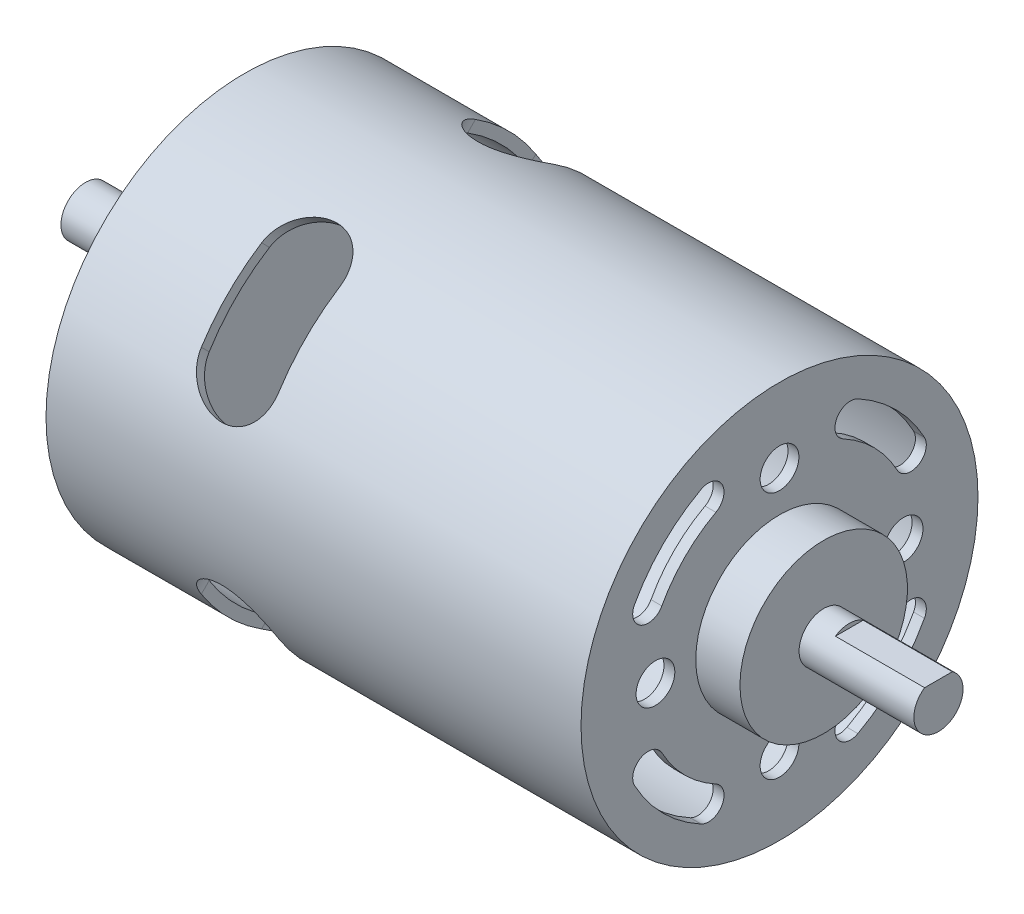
ISO-10303-21;
HEADER;
FILE_DESCRIPTION(('STEP AP214'),'2;1');
FILE_NAME('part.step','',(''),(''),'','','');
FILE_SCHEMA(('AUTOMOTIVE_DESIGN { 1 0 10303 214 1 1 1 1 }'));
ENDSEC;
DATA;
#1=APPLICATION_CONTEXT('core data for automotive mechanical design processes');
#2=APPLICATION_PROTOCOL_DEFINITION('international standard','automotive_design',2000,#1);
#3=PRODUCT_CONTEXT('',#1,'mechanical');
#4=PRODUCT('Part','Part','',(#3));
#5=PRODUCT_RELATED_PRODUCT_CATEGORY('part','',(#4));
#6=PRODUCT_DEFINITION_FORMATION('','',#4);
#7=PRODUCT_DEFINITION_CONTEXT('part definition',#1,'design');
#8=PRODUCT_DEFINITION('design','',#6,#7);
#9=PRODUCT_DEFINITION_SHAPE('','',#8);
#10=(LENGTH_UNIT() NAMED_UNIT(*) SI_UNIT(.MILLI.,.METRE.));
#11=(NAMED_UNIT(*) PLANE_ANGLE_UNIT() SI_UNIT($,.RADIAN.));
#12=(NAMED_UNIT(*) SI_UNIT($,.STERADIAN.) SOLID_ANGLE_UNIT());
#13=UNCERTAINTY_MEASURE_WITH_UNIT(LENGTH_MEASURE(1.E-05),#10,'distance_accuracy_value','');
#14=(GEOMETRIC_REPRESENTATION_CONTEXT(3) GLOBAL_UNCERTAINTY_ASSIGNED_CONTEXT((#13)) GLOBAL_UNIT_ASSIGNED_CONTEXT((#10,
#11,#12)) REPRESENTATION_CONTEXT('',''));
#15=CARTESIAN_POINT('',(0.,0.,0.));
#16=DIRECTION('',(0.,0.,1.));
#17=DIRECTION('',(1.,0.,0.));
#18=AXIS2_PLACEMENT_3D('',#15,#16,#17);
#19=CARTESIAN_POINT('',(0.,0.,0.));
#20=DIRECTION('',(-1.,0.,0.));
#21=DIRECTION('',(0.,0.,1.));
#22=AXIS2_PLACEMENT_3D('',#19,#20,#21);
#23=PLANE('',#22);
#24=CARTESIAN_POINT('',(0.,0.,0.));
#25=DIRECTION('',(-1.,0.,0.));
#26=DIRECTION('',(0.,0.,1.));
#27=AXIS2_PLACEMENT_3D('',#24,#25,#26);
#28=CIRCLE('',#27,10.5);
#29=CARTESIAN_POINT('',(0.,0.,10.5));
#30=VERTEX_POINT('',#29);
#31=EDGE_CURVE('E11',#30,#30,#28,.T.);
#32=ORIENTED_EDGE('',*,*,#31,.F.);
#33=EDGE_LOOP('',(#32));
#34=FACE_BOUND('',#33,.T.);
#35=CARTESIAN_POINT('',(0.,0.,0.));
#36=DIRECTION('',(-1.,0.,0.));
#37=DIRECTION('',(0.,0.,1.));
#38=AXIS2_PLACEMENT_3D('',#35,#36,#37);
#39=CIRCLE('',#38,25.6);
#40=CARTESIAN_POINT('',(0.,0.,25.6));
#41=VERTEX_POINT('',#40);
#42=EDGE_CURVE('E697',#41,#41,#39,.T.);
#43=ORIENTED_EDGE('',*,*,#42,.T.);
#44=EDGE_LOOP('',(#43));
#45=FACE_BOUND('',#44,.T.);
#46=DIRECTION('',(0.,0.707106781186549,0.707106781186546));
#47=VECTOR('',#46,1.);
#48=CARTESIAN_POINT('',(0.,-16.6523646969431,13.3289628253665));
#49=LINE('',#48,#47);
#50=CARTESIAN_POINT('',(0.,-16.6523646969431,13.3289628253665));
#51=VERTEX_POINT('',#50);
#52=CARTESIAN_POINT('',(0.,-13.3289628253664,16.6523646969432));
#53=VERTEX_POINT('',#52);
#54=EDGE_CURVE('E369',#51,#53,#49,.T.);
#55=ORIENTED_EDGE('',*,*,#54,.F.);
#56=DIRECTION('',(0.,-0.707106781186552,0.707106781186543));
#57=VECTOR('',#56,1.);
#58=CARTESIAN_POINT('',(0.,-16.3695219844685,13.0461201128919));
#59=LINE('',#58,#57);
#60=CARTESIAN_POINT('',(0.,-16.3695219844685,13.0461201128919));
#61=VERTEX_POINT('',#60);
#62=EDGE_CURVE('E355',#61,#51,#59,.T.);
#63=ORIENTED_EDGE('',*,*,#62,.F.);
#64=DIRECTION('',(0.,-0.707106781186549,-0.707106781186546));
#65=VECTOR('',#64,1.);
#66=CARTESIAN_POINT('',(0.,-16.3695219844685,13.0461201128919));
#67=LINE('',#66,#65);
#68=CARTESIAN_POINT('',(0.,-13.0461201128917,16.3695219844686));
#69=VERTEX_POINT('',#68);
#70=EDGE_CURVE('E360',#69,#61,#67,.T.);
#71=ORIENTED_EDGE('',*,*,#70,.F.);
#72=DIRECTION('',(0.,0.707106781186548,-0.707106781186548));
#73=VECTOR('',#72,1.);
#74=CARTESIAN_POINT('',(0.,-13.0461201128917,16.3695219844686));
#75=LINE('',#74,#73);
#76=EDGE_CURVE('E371',#53,#69,#75,.T.);
#77=ORIENTED_EDGE('',*,*,#76,.F.);
#78=EDGE_LOOP('',(#55,#63,#71,#77));
#79=FACE_BOUND('',#78,.T.);
#80=DIRECTION('',(0.,0.707106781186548,-0.707106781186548));
#81=VECTOR('',#80,1.);
#82=CARTESIAN_POINT('',(0.,16.3695219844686,-13.0461201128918));
#83=LINE('',#82,#81);
#84=CARTESIAN_POINT('',(0.,16.3695219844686,-13.0461201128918));
#85=VERTEX_POINT('',#84);
#86=CARTESIAN_POINT('',(0.,16.6523646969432,-13.3289628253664));
#87=VERTEX_POINT('',#86);
#88=EDGE_CURVE('E342',#85,#87,#83,.T.);
#89=ORIENTED_EDGE('',*,*,#88,.F.);
#90=DIRECTION('',(0.,0.707106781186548,0.707106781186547));
#91=VECTOR('',#90,1.);
#92=CARTESIAN_POINT('',(0.,13.0461201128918,-16.3695219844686));
#93=LINE('',#92,#91);
#94=CARTESIAN_POINT('',(0.,13.0461201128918,-16.3695219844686));
#95=VERTEX_POINT('',#94);
#96=EDGE_CURVE('E325',#95,#85,#93,.T.);
#97=ORIENTED_EDGE('',*,*,#96,.F.);
#98=DIRECTION('',(0.,-0.707106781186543,0.707106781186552));
#99=VECTOR('',#98,1.);
#100=CARTESIAN_POINT('',(0.,13.0461201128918,-16.3695219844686));
#101=LINE('',#100,#99);
#102=CARTESIAN_POINT('',(0.,13.3289628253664,-16.6523646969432));
#103=VERTEX_POINT('',#102);
#104=EDGE_CURVE('E333',#103,#95,#101,.T.);
#105=ORIENTED_EDGE('',*,*,#104,.F.);
#106=DIRECTION('',(0.,-0.707106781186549,-0.707106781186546));
#107=VECTOR('',#106,1.);
#108=CARTESIAN_POINT('',(0.,13.3289628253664,-16.6523646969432));
#109=LINE('',#108,#107);
#110=EDGE_CURVE('E344',#87,#103,#109,.T.);
#111=ORIENTED_EDGE('',*,*,#110,.F.);
#112=EDGE_LOOP('',(#89,#97,#105,#111));
#113=FACE_BOUND('',#112,.T.);
#114=ADVANCED_FACE('F32',(#34,#45,#79,#113),#23,.T.);
#115=CARTESIAN_POINT('',(67.6,25.6,0.));
#116=DIRECTION('',(1.,0.,0.));
#117=DIRECTION('',(0.,0.,-1.));
#118=AXIS2_PLACEMENT_3D('',#115,#116,#117);
#119=PLANE('',#118);
#120=CARTESIAN_POINT('',(67.6,-9.6190416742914E-13,-16.));
#121=DIRECTION('',(1.,0.,0.));
#122=DIRECTION('',(0.,0.,-1.));
#123=AXIS2_PLACEMENT_3D('',#120,#121,#122);
#124=CIRCLE('',#123,2.5);
#125=CARTESIAN_POINT('',(67.6,-9.6190416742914E-13,-18.5));
#126=VERTEX_POINT('',#125);
#127=EDGE_CURVE('E637',#126,#126,#124,.F.);
#128=ORIENTED_EDGE('',*,*,#127,.F.);
#129=EDGE_LOOP('',(#128));
#130=FACE_BOUND('',#129,.T.);
#131=CARTESIAN_POINT('',(67.6,-16.,1.92380833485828E-12));
#132=DIRECTION('',(1.,0.,0.));
#133=DIRECTION('',(0.,0.,-1.));
#134=AXIS2_PLACEMENT_3D('',#131,#132,#133);
#135=CIRCLE('',#134,2.5);
#136=CARTESIAN_POINT('',(67.6,-16.,-2.49999999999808));
#137=VERTEX_POINT('',#136);
#138=EDGE_CURVE('E645',#137,#137,#135,.F.);
#139=ORIENTED_EDGE('',*,*,#138,.F.);
#140=EDGE_LOOP('',(#139));
#141=FACE_BOUND('',#140,.T.);
#142=CARTESIAN_POINT('',(67.6,2.88180937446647E-12,16.));
#143=DIRECTION('',(1.,0.,0.));
#144=DIRECTION('',(0.,0.,-1.));
#145=AXIS2_PLACEMENT_3D('',#142,#143,#144);
#146=CIRCLE('',#145,2.5);
#147=CARTESIAN_POINT('',(67.6,2.88180937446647E-12,13.5));
#148=VERTEX_POINT('',#147);
#149=EDGE_CURVE('E651',#148,#148,#146,.F.);
#150=ORIENTED_EDGE('',*,*,#149,.F.);
#151=EDGE_LOOP('',(#150));
#152=FACE_BOUND('',#151,.T.);
#153=CARTESIAN_POINT('',(67.6,0.,0.));
#154=DIRECTION('',(1.,0.,0.));
#155=DIRECTION('',(0.,0.,-1.));
#156=AXIS2_PLACEMENT_3D('',#153,#154,#155);
#157=CIRCLE('',#156,17.25);
#158=CARTESIAN_POINT('',(67.6,15.1741597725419,8.20410721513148));
#159=VERTEX_POINT('',#158);
#160=CARTESIAN_POINT('',(67.6,8.20410721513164,15.1741597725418));
#161=VERTEX_POINT('',#160);
#162=EDGE_CURVE('E673',#159,#161,#157,.T.);
#163=ORIENTED_EDGE('',*,*,#162,.F.);
#164=CARTESIAN_POINT('',(67.6,16.9334826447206,9.15530805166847));
#165=DIRECTION('',(1.,0.,0.));
#166=DIRECTION('',(0.,0.,-1.));
#167=AXIS2_PLACEMENT_3D('',#164,#165,#166);
#168=CIRCLE('',#167,2.);
#169=CARTESIAN_POINT('',(67.6,18.6928055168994,10.1065088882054));
#170=VERTEX_POINT('',#169);
#171=EDGE_CURVE('E659',#170,#159,#168,.F.);
#172=ORIENTED_EDGE('',*,*,#171,.F.);
#173=CARTESIAN_POINT('',(67.6,0.,0.));
#174=DIRECTION('',(1.,0.,0.));
#175=DIRECTION('',(0.,0.,-1.));
#176=AXIS2_PLACEMENT_3D('',#173,#174,#175);
#177=CIRCLE('',#176,21.25);
#178=CARTESIAN_POINT('',(67.6,10.1065088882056,18.6928055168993));
#179=VERTEX_POINT('',#178);
#180=EDGE_CURVE('E552',#179,#170,#177,.F.);
#181=ORIENTED_EDGE('',*,*,#180,.F.);
#182=CARTESIAN_POINT('',(67.6,9.15530805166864,16.9334826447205));
#183=DIRECTION('',(1.,0.,0.));
#184=DIRECTION('',(0.,0.,-1.));
#185=AXIS2_PLACEMENT_3D('',#182,#183,#184);
#186=CIRCLE('',#185,2.);
#187=EDGE_CURVE('E676',#161,#179,#186,.F.);
#188=ORIENTED_EDGE('',*,*,#187,.F.);
#189=EDGE_LOOP('',(#163,#172,#181,#188));
#190=FACE_BOUND('',#189,.T.);
#191=CARTESIAN_POINT('',(67.6,0.,0.));
#192=DIRECTION('',(1.,0.,0.));
#193=DIRECTION('',(0.,0.,-1.));
#194=AXIS2_PLACEMENT_3D('',#191,#192,#193);
#195=CIRCLE('',#194,17.25);
#196=CARTESIAN_POINT('',(67.6,8.20410721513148,-15.1741597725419));
#197=VERTEX_POINT('',#196);
#198=CARTESIAN_POINT('',(67.6,15.1741597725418,-8.20410721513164));
#199=VERTEX_POINT('',#198);
#200=EDGE_CURVE('E564',#197,#199,#195,.T.);
#201=ORIENTED_EDGE('',*,*,#200,.F.);
#202=CARTESIAN_POINT('',(67.6,9.15530805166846,-16.9334826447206));
#203=DIRECTION('',(1.,0.,0.));
#204=DIRECTION('',(0.,0.,-1.));
#205=AXIS2_PLACEMENT_3D('',#202,#203,#204);
#206=CIRCLE('',#205,2.);
#207=CARTESIAN_POINT('',(67.6,10.1065088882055,-18.6928055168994));
#208=VERTEX_POINT('',#207);
#209=EDGE_CURVE('E547',#208,#197,#206,.F.);
#210=ORIENTED_EDGE('',*,*,#209,.F.);
#211=CARTESIAN_POINT('',(67.6,0.,0.));
#212=DIRECTION('',(1.,0.,0.));
#213=DIRECTION('',(0.,0.,-1.));
#214=AXIS2_PLACEMENT_3D('',#211,#212,#213);
#215=CIRCLE('',#214,21.25);
#216=CARTESIAN_POINT('',(67.6,18.6928055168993,-10.1065088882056));
#217=VERTEX_POINT('',#216);
#218=EDGE_CURVE('E544',#217,#208,#215,.F.);
#219=ORIENTED_EDGE('',*,*,#218,.F.);
#220=CARTESIAN_POINT('',(67.6,16.9334826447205,-9.15530805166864));
#221=DIRECTION('',(1.,0.,0.));
#222=DIRECTION('',(0.,0.,-1.));
#223=AXIS2_PLACEMENT_3D('',#220,#221,#222);
#224=CIRCLE('',#223,2.);
#225=EDGE_CURVE('E567',#199,#217,#224,.F.);
#226=ORIENTED_EDGE('',*,*,#225,.F.);
#227=EDGE_LOOP('',(#201,#210,#219,#226));
#228=FACE_BOUND('',#227,.T.);
#229=CARTESIAN_POINT('',(67.6,0.,0.));
#230=DIRECTION('',(1.,0.,0.));
#231=DIRECTION('',(0.,0.,-1.));
#232=AXIS2_PLACEMENT_3D('',#229,#230,#231);
#233=CIRCLE('',#232,17.25);
#234=CARTESIAN_POINT('',(67.6,-15.1741597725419,-8.20410721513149));
#235=VERTEX_POINT('',#234);
#236=CARTESIAN_POINT('',(67.6,-8.20410721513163,-15.1741597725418));
#237=VERTEX_POINT('',#236);
#238=EDGE_CURVE('E595',#235,#237,#233,.T.);
#239=ORIENTED_EDGE('',*,*,#238,.F.);
#240=CARTESIAN_POINT('',(67.6,-16.9334826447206,-9.15530805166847));
#241=DIRECTION('',(1.,0.,0.));
#242=DIRECTION('',(0.,0.,-1.));
#243=AXIS2_PLACEMENT_3D('',#240,#241,#242);
#244=CIRCLE('',#243,2.);
#245=CARTESIAN_POINT('',(67.6,-18.6928055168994,-10.1065088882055));
#246=VERTEX_POINT('',#245);
#247=EDGE_CURVE('E580',#246,#235,#244,.F.);
#248=ORIENTED_EDGE('',*,*,#247,.F.);
#249=CARTESIAN_POINT('',(67.6,0.,0.));
#250=DIRECTION('',(1.,0.,0.));
#251=DIRECTION('',(0.,0.,-1.));
#252=AXIS2_PLACEMENT_3D('',#249,#250,#251);
#253=CIRCLE('',#252,21.25);
#254=CARTESIAN_POINT('',(67.6,-10.1065088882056,-18.6928055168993));
#255=VERTEX_POINT('',#254);
#256=EDGE_CURVE('E577',#255,#246,#253,.F.);
#257=ORIENTED_EDGE('',*,*,#256,.F.);
#258=CARTESIAN_POINT('',(67.6,-9.15530805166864,-16.9334826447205));
#259=DIRECTION('',(1.,0.,0.));
#260=DIRECTION('',(0.,0.,-1.));
#261=AXIS2_PLACEMENT_3D('',#258,#259,#260);
#262=CIRCLE('',#261,2.);
#263=EDGE_CURVE('E598',#237,#255,#262,.F.);
#264=ORIENTED_EDGE('',*,*,#263,.F.);
#265=EDGE_LOOP('',(#239,#248,#257,#264));
#266=FACE_BOUND('',#265,.T.);
#267=CARTESIAN_POINT('',(67.6,0.,0.));
#268=DIRECTION('',(1.,0.,0.));
#269=DIRECTION('',(0.,0.,-1.));
#270=AXIS2_PLACEMENT_3D('',#267,#268,#269);
#271=CIRCLE('',#270,17.25);
#272=CARTESIAN_POINT('',(67.6,-8.20410721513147,15.1741597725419));
#273=VERTEX_POINT('',#272);
#274=CARTESIAN_POINT('',(67.6,-15.1741597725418,8.20410721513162));
#275=VERTEX_POINT('',#274);
#276=EDGE_CURVE('E624',#273,#275,#271,.T.);
#277=ORIENTED_EDGE('',*,*,#276,.F.);
#278=CARTESIAN_POINT('',(67.6,-9.15530805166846,16.9334826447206));
#279=DIRECTION('',(1.,0.,0.));
#280=DIRECTION('',(0.,0.,-1.));
#281=AXIS2_PLACEMENT_3D('',#278,#279,#280);
#282=CIRCLE('',#281,2.);
#283=CARTESIAN_POINT('',(67.6,-10.1065088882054,18.6928055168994));
#284=VERTEX_POINT('',#283);
#285=EDGE_CURVE('E610',#284,#273,#282,.F.);
#286=ORIENTED_EDGE('',*,*,#285,.F.);
#287=CARTESIAN_POINT('',(67.6,0.,0.));
#288=DIRECTION('',(1.,0.,0.));
#289=DIRECTION('',(0.,0.,-1.));
#290=AXIS2_PLACEMENT_3D('',#287,#288,#289);
#291=CIRCLE('',#290,21.25);
#292=CARTESIAN_POINT('',(67.6,-18.6928055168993,10.1065088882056));
#293=VERTEX_POINT('',#292);
#294=EDGE_CURVE('E543',#293,#284,#291,.F.);
#295=ORIENTED_EDGE('',*,*,#294,.F.);
#296=CARTESIAN_POINT('',(67.6,-16.9334826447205,9.15530805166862));
#297=DIRECTION('',(1.,0.,0.));
#298=DIRECTION('',(0.,0.,-1.));
#299=AXIS2_PLACEMENT_3D('',#296,#297,#298);
#300=CIRCLE('',#299,2.);
#301=EDGE_CURVE('E627',#275,#293,#300,.F.);
#302=ORIENTED_EDGE('',*,*,#301,.F.);
#303=EDGE_LOOP('',(#277,#286,#295,#302));
#304=FACE_BOUND('',#303,.T.);
#305=CARTESIAN_POINT('',(67.6,16.,0.));
#306=DIRECTION('',(1.,0.,0.));
#307=DIRECTION('',(0.,0.,-1.));
#308=AXIS2_PLACEMENT_3D('',#305,#306,#307);
#309=CIRCLE('',#308,2.5);
#310=CARTESIAN_POINT('',(67.6,16.,-2.5));
#311=VERTEX_POINT('',#310);
#312=EDGE_CURVE('E644',#311,#311,#309,.F.);
#313=ORIENTED_EDGE('',*,*,#312,.F.);
#314=EDGE_LOOP('',(#313));
#315=FACE_BOUND('',#314,.T.);
#316=CARTESIAN_POINT('',(67.6,0.,0.));
#317=DIRECTION('',(-1.,0.,0.));
#318=DIRECTION('',(0.,0.,1.));
#319=AXIS2_PLACEMENT_3D('',#316,#317,#318);
#320=CIRCLE('',#319,24.2);
#321=CARTESIAN_POINT('',(67.6,0.,24.2));
#322=VERTEX_POINT('',#321);
#323=EDGE_CURVE('E691',#322,#322,#320,.T.);
#324=ORIENTED_EDGE('',*,*,#323,.T.);
#325=EDGE_LOOP('',(#324));
#326=FACE_BOUND('',#325,.T.);
#327=ADVANCED_FACE('F34',(#130,#141,#152,#190,#228,#266,#304,#315,#326),#119,.F.);
#328=CARTESIAN_POINT('',(1.4,0.,0.));
#329=DIRECTION('',(-1.,0.,0.));
#330=DIRECTION('',(0.,0.,1.));
#331=AXIS2_PLACEMENT_3D('',#328,#329,#330);
#332=PLANE('',#331);
#333=CARTESIAN_POINT('',(1.4,0.,0.));
#334=DIRECTION('',(-1.,0.,0.));
#335=DIRECTION('',(0.,0.,1.));
#336=AXIS2_PLACEMENT_3D('',#333,#334,#335);
#337=CIRCLE('',#336,24.2);
#338=CARTESIAN_POINT('',(1.4,0.,24.2));
#339=VERTEX_POINT('',#338);
#340=EDGE_CURVE('E694',#339,#339,#337,.T.);
#341=ORIENTED_EDGE('',*,*,#340,.F.);
#342=EDGE_LOOP('',(#341));
#343=FACE_BOUND('',#342,.T.);
#344=ADVANCED_FACE('F991',(#343),#332,.F.);
#345=CARTESIAN_POINT('',(0.,0.,0.));
#346=DIRECTION('',(-1.,0.,0.));
#347=DIRECTION('',(0.,0.,1.));
#348=AXIS2_PLACEMENT_3D('',#345,#346,#347);
#349=CYLINDRICAL_SURFACE('',#348,24.2);
#350=CARTESIAN_POINT('',(16.,0.,0.));
#351=DIRECTION('',(-1.,0.,0.));
#352=DIRECTION('',(0.,0.,1.));
#353=AXIS2_PLACEMENT_3D('',#350,#351,#352);
#354=CIRCLE('',#353,24.2);
#355=CARTESIAN_POINT('',(16.,-20.5532704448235,-12.7750958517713));
#356=VERTEX_POINT('',#355);
#357=CARTESIAN_POINT('',(16.,-12.7750958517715,-20.5532704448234));
#358=VERTEX_POINT('',#357);
#359=EDGE_CURVE('E788',#356,#358,#354,.F.);
#360=ORIENTED_EDGE('',*,*,#359,.T.);
#361=CARTESIAN_POINT('',(16.,-12.7750958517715,-20.5532704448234));
#362=CARTESIAN_POINT('',(15.9999861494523,-12.6477205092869,-20.6324582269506));
#363=CARTESIAN_POINT('',(16.006399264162,-12.5196102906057,-20.7104289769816));
#364=CARTESIAN_POINT('',(16.0318024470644,-12.2629295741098,-20.8634296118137));
#365=CARTESIAN_POINT('',(16.0507888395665,-12.1343592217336,-20.9384603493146));
#366=CARTESIAN_POINT('',(16.1010183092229,-11.8779147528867,-21.08499379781));
#367=CARTESIAN_POINT('',(16.132240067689,-11.7500398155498,-21.15650240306));
#368=CARTESIAN_POINT('',(16.2065937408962,-11.4957102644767,-21.2957661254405));
#369=CARTESIAN_POINT('',(16.2497263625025,-11.3692557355,-21.3635210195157));
#370=CARTESIAN_POINT('',(16.3474697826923,-11.1188367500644,-21.4949168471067));
#371=CARTESIAN_POINT('',(16.4020699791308,-10.9948701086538,-21.558561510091));
#372=CARTESIAN_POINT('',(16.5223770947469,-10.7502016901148,-21.6816032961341));
#373=CARTESIAN_POINT('',(16.5880878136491,-10.629501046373,-21.7409989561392));
#374=CARTESIAN_POINT('',(16.7301868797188,-10.3923087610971,-21.8553714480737));
#375=CARTESIAN_POINT('',(16.806578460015,-10.275818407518,-21.9103469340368));
#376=CARTESIAN_POINT('',(16.9695646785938,-10.0480296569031,-22.015740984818));
#377=CARTESIAN_POINT('',(17.0561592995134,-9.93673125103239,-22.0661595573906));
#378=CARTESIAN_POINT('',(17.2412859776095,-9.71766040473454,-22.1635238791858));
#379=CARTESIAN_POINT('',(17.3400562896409,-9.61003856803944,-22.2103559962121));
#380=CARTESIAN_POINT('',(17.5471968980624,-9.40233712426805,-22.2990763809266));
#381=CARTESIAN_POINT('',(17.6555634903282,-9.30225463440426,-22.3409665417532));
#382=CARTESIAN_POINT('',(17.8813585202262,-9.11062350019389,-22.4197966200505));
#383=CARTESIAN_POINT('',(17.9987904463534,-9.01907817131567,-22.4567346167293));
#384=CARTESIAN_POINT('',(18.2419227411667,-8.8457029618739,-22.5255907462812));
#385=CARTESIAN_POINT('',(18.3676189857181,-8.76386829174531,-22.5575113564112));
#386=CARTESIAN_POINT('',(18.622198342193,-8.61351079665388,-22.6153422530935));
#387=CARTESIAN_POINT('',(18.7508353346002,-8.54463501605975,-22.6414174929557));
#388=CARTESIAN_POINT('',(19.0142098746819,-8.41792883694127,-22.6888309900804));
#389=CARTESIAN_POINT('',(19.1489444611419,-8.36009314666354,-22.7101715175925));
#390=CARTESIAN_POINT('',(19.4235130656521,-8.25634633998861,-22.7480943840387));
#391=CARTESIAN_POINT('',(19.5633447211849,-8.21042977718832,-22.764678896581));
#392=CARTESIAN_POINT('',(19.8470214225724,-8.13126780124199,-22.7930747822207));
#393=CARTESIAN_POINT('',(19.9908660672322,-8.09802112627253,-22.8048866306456));
#394=CARTESIAN_POINT('',(20.2681028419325,-8.04721553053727,-22.8228608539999));
#395=CARTESIAN_POINT('',(20.4012582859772,-8.02850637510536,-22.8294387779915));
#396=CARTESIAN_POINT('',(20.6688039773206,-8.00235030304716,-22.8386204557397));
#397=CARTESIAN_POINT('',(20.8031941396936,-7.99490261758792,-22.841224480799));
#398=CARTESIAN_POINT('',(21.0721050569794,-7.99139024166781,-22.8424535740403));
#399=CARTESIAN_POINT('',(21.2066257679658,-7.9953225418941,-22.8410796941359));
#400=CARTESIAN_POINT('',(21.4747544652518,-8.01449832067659,-22.8343582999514));
#401=CARTESIAN_POINT('',(21.6083624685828,-8.02974158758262,-22.8290108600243));
#402=CARTESIAN_POINT('',(21.8663226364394,-8.07015476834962,-22.8147547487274));
#403=CARTESIAN_POINT('',(21.9907795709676,-8.09473231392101,-22.8060582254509));
#404=CARTESIAN_POINT('',(22.2371323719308,-8.15342661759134,-22.7851397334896));
#405=CARTESIAN_POINT('',(22.3590273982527,-8.1875464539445,-22.7729166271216));
#406=CARTESIAN_POINT('',(22.7196255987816,-8.30358241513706,-22.7309782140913));
#407=CARTESIAN_POINT('',(22.9534608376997,-8.39921019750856,-22.6959818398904));
#408=CARTESIAN_POINT('',(23.4109702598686,-8.62677036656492,-22.6104856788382));
#409=CARTESIAN_POINT('',(23.6339138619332,-8.75995129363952,-22.5594441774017));
#410=CARTESIAN_POINT('',(24.055354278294,-9.05532816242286,-22.4425093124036));
#411=CARTESIAN_POINT('',(24.2538432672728,-9.21753335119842,-22.3766112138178));
#412=CARTESIAN_POINT('',(24.6391706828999,-9.58073345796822,-22.2236739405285));
#413=CARTESIAN_POINT('',(24.8234327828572,-9.78388880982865,-22.1352818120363));
#414=CARTESIAN_POINT('',(25.1553291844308,-10.2112629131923,-21.9414003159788));
#415=CARTESIAN_POINT('',(25.3029378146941,-10.4354962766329,-21.8358990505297));
#416=CARTESIAN_POINT('',(25.4981498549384,-10.7894171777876,-21.6621169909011));
#417=CARTESIAN_POINT('',(25.5601997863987,-10.9141609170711,-21.5995663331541));
#418=CARTESIAN_POINT('',(25.6725520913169,-11.1666344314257,-21.4701269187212));
#419=CARTESIAN_POINT('',(25.7228585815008,-11.294363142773,-21.4032396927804));
#420=CARTESIAN_POINT('',(25.8112453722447,-11.5516565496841,-21.2654770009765));
#421=CARTESIAN_POINT('',(25.8493403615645,-11.6812188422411,-21.1946064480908));
#422=CARTESIAN_POINT('',(25.9129895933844,-11.9412824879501,-21.0491792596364));
#423=CARTESIAN_POINT('',(25.9385501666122,-12.0717833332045,-20.9746245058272));
#424=CARTESIAN_POINT('',(25.9717365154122,-12.2980849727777,-20.8424907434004));
#425=CARTESIAN_POINT('',(25.9823222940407,-12.3938989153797,-20.785660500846));
#426=CARTESIAN_POINT('',(25.9964504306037,-12.5849729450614,-20.67053276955));
#427=CARTESIAN_POINT('',(26.0000029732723,-12.6802336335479,-20.6122375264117));
#428=CARTESIAN_POINT('',(26.,-12.7750958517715,-20.5532704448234));
#429=B_SPLINE_CURVE_WITH_KNOTS('',3,(#361,#362,#363,#364,#365,#366,#367,#368,#369,#370,#371,
#372,#373,#374,#375,#376,#377,#378,#379,#380,#381,#382,#383,#384,#385,#386,#387,#388,#389,#390,
#391,#392,#393,#394,#395,#396,#397,#398,#399,#400,#401,#402,#403,#404,#405,#406,#407,#408,#409,
#410,#411,#412,#413,#414,#415,#416,#417,#418,#419,#420,#421,#422,#423,#424,#425,#426,#427,#428),
.UNSPECIFIED.,.F.,.F.,(4,2,2,2,2,2,2,2,2,2,2,2,2,2,2,2,2,2,2,2,2,2,2,2,2,2,2,2,2,2,2,2,2,4),(0.,
0.449781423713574,0.899431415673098,1.34830140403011,1.79719803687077,2.24568146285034,
2.69431857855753,3.14309179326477,3.5918642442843,4.0515017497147,4.51096260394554,
4.97060115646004,5.43001205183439,5.87410019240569,6.31797493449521,6.76164649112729,
7.20527384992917,7.60862474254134,8.0119480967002,8.4151648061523,8.81837397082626,
9.19939649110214,9.58054206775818,10.3421749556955,11.1329350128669,11.9239474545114,
12.7848060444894,13.6462658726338,14.1039750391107,14.561523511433,15.0185195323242,
15.4752845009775,15.8107694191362,16.1457681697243),.UNSPECIFIED.);
#430=CARTESIAN_POINT('',(26.,-12.7750958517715,-20.5532704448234));
#431=VERTEX_POINT('',#430);
#432=EDGE_CURVE('E783',#358,#431,#429,.T.);
#433=ORIENTED_EDGE('',*,*,#432,.T.);
#434=CARTESIAN_POINT('',(26.,0.,0.));
#435=DIRECTION('',(1.,0.,0.));
#436=DIRECTION('',(0.,0.,-1.));
#437=AXIS2_PLACEMENT_3D('',#434,#435,#436);
#438=CIRCLE('',#437,24.2);
#439=CARTESIAN_POINT('',(26.,-20.5532704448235,-12.7750958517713));
#440=VERTEX_POINT('',#439);
#441=EDGE_CURVE('E421',#431,#440,#438,.F.);
#442=ORIENTED_EDGE('',*,*,#441,.T.);
#443=CARTESIAN_POINT('',(26.,-20.5532704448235,-12.7750958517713));
#444=CARTESIAN_POINT('',(26.0000138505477,-20.6324582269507,-12.6477205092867));
#445=CARTESIAN_POINT('',(25.993600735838,-20.7104289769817,-12.5196102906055));
#446=CARTESIAN_POINT('',(25.9681975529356,-20.8634296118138,-12.2629295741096));
#447=CARTESIAN_POINT('',(25.9492111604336,-20.9384603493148,-12.1343592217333));
#448=CARTESIAN_POINT('',(25.8989816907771,-21.0849937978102,-11.8779147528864));
#449=CARTESIAN_POINT('',(25.867759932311,-21.1565024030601,-11.7500398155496));
#450=CARTESIAN_POINT('',(25.7934062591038,-21.2957661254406,-11.4957102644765));
#451=CARTESIAN_POINT('',(25.7502736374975,-21.3635210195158,-11.3692557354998));
#452=CARTESIAN_POINT('',(25.6525302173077,-21.4949168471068,-11.1188367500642));
#453=CARTESIAN_POINT('',(25.5979300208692,-21.5585615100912,-10.9948701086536));
#454=CARTESIAN_POINT('',(25.4776229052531,-21.6816032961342,-10.7502016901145));
#455=CARTESIAN_POINT('',(25.4119121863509,-21.7409989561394,-10.6295010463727));
#456=CARTESIAN_POINT('',(25.2698131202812,-21.8553714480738,-10.3923087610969));
#457=CARTESIAN_POINT('',(25.193421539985,-21.9103469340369,-10.2758184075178));
#458=CARTESIAN_POINT('',(25.0304353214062,-22.0157409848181,-10.0480296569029));
#459=CARTESIAN_POINT('',(24.9438407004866,-22.0661595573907,-9.93673125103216));
#460=CARTESIAN_POINT('',(24.7587140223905,-22.1635238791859,-9.71766040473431));
#461=CARTESIAN_POINT('',(24.659943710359,-22.2103559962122,-9.6100385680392));
#462=CARTESIAN_POINT('',(24.4528031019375,-22.2990763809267,-9.40233712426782));
#463=CARTESIAN_POINT('',(24.3444365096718,-22.3409665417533,-9.30225463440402));
#464=CARTESIAN_POINT('',(24.1186414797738,-22.4197966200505,-9.11062350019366));
#465=CARTESIAN_POINT('',(24.0012095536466,-22.4567346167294,-9.01907817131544));
#466=CARTESIAN_POINT('',(23.7580772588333,-22.5255907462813,-8.84570296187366));
#467=CARTESIAN_POINT('',(23.6323810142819,-22.5575113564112,-8.76386829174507));
#468=CARTESIAN_POINT('',(23.377801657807,-22.6153422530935,-8.61351079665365));
#469=CARTESIAN_POINT('',(23.2491646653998,-22.6414174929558,-8.54463501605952));
#470=CARTESIAN_POINT('',(22.9857901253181,-22.6888309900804,-8.41792883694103));
#471=CARTESIAN_POINT('',(22.8510555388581,-22.7101715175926,-8.3600931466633));
#472=CARTESIAN_POINT('',(22.5764869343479,-22.7480943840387,-8.25634633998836));
#473=CARTESIAN_POINT('',(22.4366552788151,-22.7646788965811,-8.21042977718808));
#474=CARTESIAN_POINT('',(22.1529785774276,-22.7930747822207,-8.13126780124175));
#475=CARTESIAN_POINT('',(22.0091339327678,-22.8048866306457,-8.09802112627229));
#476=CARTESIAN_POINT('',(21.7318971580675,-22.822860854,-8.04721553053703));
#477=CARTESIAN_POINT('',(21.5987417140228,-22.8294387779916,-8.02850637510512));
#478=CARTESIAN_POINT('',(21.3311960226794,-22.8386204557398,-8.00235030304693));
#479=CARTESIAN_POINT('',(21.1968058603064,-22.8412244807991,-7.99490261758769));
#480=CARTESIAN_POINT('',(20.9278949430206,-22.8424535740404,-7.99139024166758));
#481=CARTESIAN_POINT('',(20.7933742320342,-22.841079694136,-7.99532254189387));
#482=CARTESIAN_POINT('',(20.5252455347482,-22.8343582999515,-8.01449832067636));
#483=CARTESIAN_POINT('',(20.3916375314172,-22.8290108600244,-8.02974158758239));
#484=CARTESIAN_POINT('',(20.1336773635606,-22.8147547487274,-8.07015476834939));
#485=CARTESIAN_POINT('',(20.0092204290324,-22.806058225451,-8.09473231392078));
#486=CARTESIAN_POINT('',(19.7628676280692,-22.7851397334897,-8.15342661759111));
#487=CARTESIAN_POINT('',(19.6409726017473,-22.7729166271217,-8.18754645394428));
#488=CARTESIAN_POINT('',(19.2803744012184,-22.7309782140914,-8.30358241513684));
#489=CARTESIAN_POINT('',(19.0465391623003,-22.6959818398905,-8.39921019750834));
#490=CARTESIAN_POINT('',(18.5890297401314,-22.6104856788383,-8.62677036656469));
#491=CARTESIAN_POINT('',(18.3660861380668,-22.5594441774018,-8.7599512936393));
#492=CARTESIAN_POINT('',(17.944645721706,-22.4425093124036,-9.05532816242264));
#493=CARTESIAN_POINT('',(17.7461567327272,-22.3766112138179,-9.2175333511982));
#494=CARTESIAN_POINT('',(17.3608293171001,-22.2236739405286,-9.580733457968));
#495=CARTESIAN_POINT('',(17.1765672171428,-22.1352818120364,-9.78388880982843));
#496=CARTESIAN_POINT('',(16.8446708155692,-21.9414003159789,-10.2112629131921));
#497=CARTESIAN_POINT('',(16.6970621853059,-21.8358990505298,-10.4354962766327));
#498=CARTESIAN_POINT('',(16.5018501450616,-21.6621169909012,-10.7894171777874));
#499=CARTESIAN_POINT('',(16.4398002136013,-21.5995663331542,-10.9141609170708));
#500=CARTESIAN_POINT('',(16.3274479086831,-21.4701269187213,-11.1666344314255));
#501=CARTESIAN_POINT('',(16.2771414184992,-21.4032396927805,-11.2943631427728));
#502=CARTESIAN_POINT('',(16.1887546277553,-21.2654770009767,-11.5516565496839));
#503=CARTESIAN_POINT('',(16.1506596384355,-21.1946064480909,-11.6812188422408));
#504=CARTESIAN_POINT('',(16.0870104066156,-21.0491792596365,-11.9412824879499));
#505=CARTESIAN_POINT('',(16.0614498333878,-20.9746245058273,-12.0717833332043));
#506=CARTESIAN_POINT('',(16.0282634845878,-20.8424907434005,-12.2980849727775));
#507=CARTESIAN_POINT('',(16.0176777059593,-20.7856605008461,-12.3938989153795));
#508=CARTESIAN_POINT('',(16.0035495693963,-20.6705327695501,-12.5849729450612));
#509=CARTESIAN_POINT('',(15.9999970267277,-20.6122375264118,-12.6802336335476));
#510=CARTESIAN_POINT('',(16.,-20.5532704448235,-12.7750958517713));
#511=B_SPLINE_CURVE_WITH_KNOTS('',3,(#443,#444,#445,#446,#447,#448,#449,#450,#451,#452,#453,
#454,#455,#456,#457,#458,#459,#460,#461,#462,#463,#464,#465,#466,#467,#468,#469,#470,#471,#472,
#473,#474,#475,#476,#477,#478,#479,#480,#481,#482,#483,#484,#485,#486,#487,#488,#489,#490,#491,
#492,#493,#494,#495,#496,#497,#498,#499,#500,#501,#502,#503,#504,#505,#506,#507,#508,#509,#510),
.UNSPECIFIED.,.F.,.F.,(4,2,2,2,2,2,2,2,2,2,2,2,2,2,2,2,2,2,2,2,2,2,2,2,2,2,2,2,2,2,2,2,2,4),(0.,
0.449781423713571,0.899431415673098,1.34830140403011,1.79719803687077,2.24568146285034,
2.69431857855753,3.14309179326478,3.5918642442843,4.05150174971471,4.51096260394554,
4.97060115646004,5.43001205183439,5.87410019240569,6.31797493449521,6.7616464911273,
7.20527384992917,7.60862474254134,8.01194809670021,8.4151648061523,8.81837397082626,
9.19939649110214,9.58054206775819,10.3421749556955,11.1329350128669,11.9239474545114,
12.7848060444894,13.6462658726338,14.1039750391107,14.561523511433,15.0185195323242,
15.4752845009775,15.8107694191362,16.1457681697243),.UNSPECIFIED.);
#512=EDGE_CURVE('E422',#440,#356,#511,.T.);
#513=ORIENTED_EDGE('',*,*,#512,.T.);
#514=EDGE_LOOP('',(#360,#433,#442,#513));
#515=FACE_BOUND('',#514,.T.);
#516=CARTESIAN_POINT('',(26.,12.7750958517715,20.5532704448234));
#517=VERTEX_POINT('',#516);
#518=CARTESIAN_POINT('',(26.,20.5532704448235,12.7750958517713));
#519=VERTEX_POINT('',#518);
#520=EDGE_CURVE('E418',#517,#519,#438,.F.);
#521=ORIENTED_EDGE('',*,*,#520,.T.);
#522=CARTESIAN_POINT('',(26.,20.5532704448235,12.7750958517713));
#523=CARTESIAN_POINT('',(26.0000138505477,20.6324582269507,12.6477205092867));
#524=CARTESIAN_POINT('',(25.993600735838,20.7104289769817,12.5196102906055));
#525=CARTESIAN_POINT('',(25.9681975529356,20.8634296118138,12.2629295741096));
#526=CARTESIAN_POINT('',(25.9492111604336,20.9384603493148,12.1343592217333));
#527=CARTESIAN_POINT('',(25.8989816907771,21.0849937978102,11.8779147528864));
#528=CARTESIAN_POINT('',(25.867759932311,21.1565024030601,11.7500398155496));
#529=CARTESIAN_POINT('',(25.7934062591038,21.2957661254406,11.4957102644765));
#530=CARTESIAN_POINT('',(25.7502736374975,21.3635210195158,11.3692557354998));
#531=CARTESIAN_POINT('',(25.6525302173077,21.4949168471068,11.1188367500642));
#532=CARTESIAN_POINT('',(25.5979300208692,21.5585615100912,10.9948701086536));
#533=CARTESIAN_POINT('',(25.4776229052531,21.6816032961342,10.7502016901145));
#534=CARTESIAN_POINT('',(25.4119121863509,21.7409989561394,10.6295010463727));
#535=CARTESIAN_POINT('',(25.2698131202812,21.8553714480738,10.3923087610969));
#536=CARTESIAN_POINT('',(25.193421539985,21.9103469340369,10.2758184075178));
#537=CARTESIAN_POINT('',(25.0304353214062,22.0157409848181,10.0480296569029));
#538=CARTESIAN_POINT('',(24.9438407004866,22.0661595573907,9.93673125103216));
#539=CARTESIAN_POINT('',(24.7587140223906,22.1635238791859,9.71766040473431));
#540=CARTESIAN_POINT('',(24.6599437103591,22.2103559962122,9.61003856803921));
#541=CARTESIAN_POINT('',(24.4528031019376,22.2990763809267,9.40233712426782));
#542=CARTESIAN_POINT('',(24.3444365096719,22.3409665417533,9.30225463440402));
#543=CARTESIAN_POINT('',(24.1186414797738,22.4197966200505,9.11062350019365));
#544=CARTESIAN_POINT('',(24.0012095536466,22.4567346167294,9.01907817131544));
#545=CARTESIAN_POINT('',(23.7580772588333,22.5255907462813,8.84570296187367));
#546=CARTESIAN_POINT('',(23.6323810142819,22.5575113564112,8.76386829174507));
#547=CARTESIAN_POINT('',(23.377801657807,22.6153422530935,8.61351079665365));
#548=CARTESIAN_POINT('',(23.2491646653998,22.6414174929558,8.54463501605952));
#549=CARTESIAN_POINT('',(22.9857901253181,22.6888309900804,8.41792883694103));
#550=CARTESIAN_POINT('',(22.8510555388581,22.7101715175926,8.3600931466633));
#551=CARTESIAN_POINT('',(22.5764869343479,22.7480943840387,8.25634633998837));
#552=CARTESIAN_POINT('',(22.4366552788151,22.7646788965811,8.21042977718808));
#553=CARTESIAN_POINT('',(22.1529785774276,22.7930747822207,8.13126780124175));
#554=CARTESIAN_POINT('',(22.0091339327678,22.8048866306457,8.09802112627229));
#555=CARTESIAN_POINT('',(21.7318971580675,22.822860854,8.04721553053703));
#556=CARTESIAN_POINT('',(21.5987417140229,22.8294387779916,8.02850637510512));
#557=CARTESIAN_POINT('',(21.3311960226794,22.8386204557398,8.00235030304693));
#558=CARTESIAN_POINT('',(21.1968058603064,22.8412244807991,7.99490261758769));
#559=CARTESIAN_POINT('',(20.9278949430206,22.8424535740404,7.99139024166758));
#560=CARTESIAN_POINT('',(20.7933742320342,22.841079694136,7.99532254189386));
#561=CARTESIAN_POINT('',(20.5252455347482,22.8343582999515,8.01449832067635));
#562=CARTESIAN_POINT('',(20.3916375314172,22.8290108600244,8.02974158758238));
#563=CARTESIAN_POINT('',(20.1336773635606,22.8147547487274,8.07015476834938));
#564=CARTESIAN_POINT('',(20.0092204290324,22.806058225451,8.09473231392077));
#565=CARTESIAN_POINT('',(19.7628676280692,22.7851397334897,8.1534266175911));
#566=CARTESIAN_POINT('',(19.6409726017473,22.7729166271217,8.18754645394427));
#567=CARTESIAN_POINT('',(19.2803744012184,22.7309782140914,8.30358241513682));
#568=CARTESIAN_POINT('',(19.0465391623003,22.6959818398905,8.39921019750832));
#569=CARTESIAN_POINT('',(18.5890297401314,22.6104856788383,8.62677036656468));
#570=CARTESIAN_POINT('',(18.3660861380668,22.5594441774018,8.75995129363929));
#571=CARTESIAN_POINT('',(17.944645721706,22.4425093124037,9.05532816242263));
#572=CARTESIAN_POINT('',(17.7461567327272,22.3766112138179,9.21753335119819));
#573=CARTESIAN_POINT('',(17.3608293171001,22.2236739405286,9.58073345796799));
#574=CARTESIAN_POINT('',(17.1765672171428,22.1352818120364,9.78388880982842));
#575=CARTESIAN_POINT('',(16.8446708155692,21.9414003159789,10.2112629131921));
#576=CARTESIAN_POINT('',(16.6970621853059,21.8358990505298,10.4354962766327));
#577=CARTESIAN_POINT('',(16.5018501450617,21.6621169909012,10.7894171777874));
#578=CARTESIAN_POINT('',(16.4398002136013,21.5995663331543,10.9141609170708));
#579=CARTESIAN_POINT('',(16.3274479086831,21.4701269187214,11.1666344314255));
#580=CARTESIAN_POINT('',(16.2771414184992,21.4032396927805,11.2943631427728));
#581=CARTESIAN_POINT('',(16.1887546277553,21.2654770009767,11.5516565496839));
#582=CARTESIAN_POINT('',(16.1506596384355,21.1946064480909,11.6812188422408));
#583=CARTESIAN_POINT('',(16.0870104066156,21.0491792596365,11.9412824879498));
#584=CARTESIAN_POINT('',(16.0614498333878,20.9746245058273,12.0717833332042));
#585=CARTESIAN_POINT('',(16.0282634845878,20.8424907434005,12.2980849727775));
#586=CARTESIAN_POINT('',(16.0176777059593,20.7856605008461,12.3938989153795));
#587=CARTESIAN_POINT('',(16.0035495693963,20.6705327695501,12.5849729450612));
#588=CARTESIAN_POINT('',(15.9999970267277,20.6122375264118,12.6802336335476));
#589=CARTESIAN_POINT('',(16.,20.5532704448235,12.7750958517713));
#590=B_SPLINE_CURVE_WITH_KNOTS('',3,(#522,#523,#524,#525,#526,#527,#528,#529,#530,#531,#532,
#533,#534,#535,#536,#537,#538,#539,#540,#541,#542,#543,#544,#545,#546,#547,#548,#549,#550,#551,
#552,#553,#554,#555,#556,#557,#558,#559,#560,#561,#562,#563,#564,#565,#566,#567,#568,#569,#570,
#571,#572,#573,#574,#575,#576,#577,#578,#579,#580,#581,#582,#583,#584,#585,#586,#587,#588,#589),
.UNSPECIFIED.,.F.,.F.,(4,2,2,2,2,2,2,2,2,2,2,2,2,2,2,2,2,2,2,2,2,2,2,2,2,2,2,2,2,2,2,2,2,4),(0.,
0.449781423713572,0.899431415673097,1.34830140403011,1.79719803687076,2.24568146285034,
2.69431857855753,3.14309179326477,3.5918642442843,4.0515017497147,4.51096260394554,
4.97060115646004,5.43001205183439,5.87410019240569,6.31797493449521,6.7616464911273,
7.20527384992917,7.60862474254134,8.0119480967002,8.41516480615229,8.81837397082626,
9.19939649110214,9.58054206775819,10.3421749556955,11.1329350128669,11.9239474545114,
12.7848060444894,13.6462658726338,14.1039750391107,14.561523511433,15.0185195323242,
15.4752845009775,15.8107694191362,16.1457681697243),.UNSPECIFIED.);
#591=CARTESIAN_POINT('',(16.,20.5532704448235,12.7750958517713));
#592=VERTEX_POINT('',#591);
#593=EDGE_CURVE('E750',#519,#592,#590,.T.);
#594=ORIENTED_EDGE('',*,*,#593,.T.);
#595=CARTESIAN_POINT('',(16.,12.7750958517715,20.5532704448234));
#596=VERTEX_POINT('',#595);
#597=EDGE_CURVE('E789',#592,#596,#354,.F.);
#598=ORIENTED_EDGE('',*,*,#597,.T.);
#599=CARTESIAN_POINT('',(16.,12.7750958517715,20.5532704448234));
#600=CARTESIAN_POINT('',(15.9999861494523,12.6477205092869,20.6324582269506));
#601=CARTESIAN_POINT('',(16.006399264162,12.5196102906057,20.7104289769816));
#602=CARTESIAN_POINT('',(16.0318024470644,12.2629295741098,20.8634296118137));
#603=CARTESIAN_POINT('',(16.0507888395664,12.1343592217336,20.9384603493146));
#604=CARTESIAN_POINT('',(16.1010183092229,11.8779147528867,21.08499379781));
#605=CARTESIAN_POINT('',(16.132240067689,11.7500398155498,21.15650240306));
#606=CARTESIAN_POINT('',(16.2065937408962,11.4957102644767,21.2957661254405));
#607=CARTESIAN_POINT('',(16.2497263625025,11.3692557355,21.3635210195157));
#608=CARTESIAN_POINT('',(16.3474697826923,11.1188367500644,21.4949168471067));
#609=CARTESIAN_POINT('',(16.4020699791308,10.9948701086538,21.558561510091));
#610=CARTESIAN_POINT('',(16.5223770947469,10.7502016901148,21.6816032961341));
#611=CARTESIAN_POINT('',(16.5880878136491,10.629501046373,21.7409989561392));
#612=CARTESIAN_POINT('',(16.7301868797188,10.3923087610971,21.8553714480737));
#613=CARTESIAN_POINT('',(16.806578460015,10.275818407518,21.9103469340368));
#614=CARTESIAN_POINT('',(16.9695646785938,10.0480296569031,22.015740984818));
#615=CARTESIAN_POINT('',(17.0561592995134,9.93673125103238,22.0661595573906));
#616=CARTESIAN_POINT('',(17.2412859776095,9.71766040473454,22.1635238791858));
#617=CARTESIAN_POINT('',(17.3400562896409,9.61003856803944,22.2103559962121));
#618=CARTESIAN_POINT('',(17.5471968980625,9.40233712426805,22.2990763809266));
#619=CARTESIAN_POINT('',(17.6555634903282,9.30225463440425,22.3409665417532));
#620=CARTESIAN_POINT('',(17.8813585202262,9.11062350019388,22.4197966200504));
#621=CARTESIAN_POINT('',(17.9987904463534,9.01907817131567,22.4567346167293));
#622=CARTESIAN_POINT('',(18.2419227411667,8.8457029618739,22.5255907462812));
#623=CARTESIAN_POINT('',(18.3676189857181,8.76386829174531,22.5575113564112));
#624=CARTESIAN_POINT('',(18.622198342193,8.61351079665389,22.6153422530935));
#625=CARTESIAN_POINT('',(18.7508353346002,8.54463501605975,22.6414174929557));
#626=CARTESIAN_POINT('',(19.0142098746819,8.41792883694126,22.6888309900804));
#627=CARTESIAN_POINT('',(19.1489444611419,8.36009314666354,22.7101715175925));
#628=CARTESIAN_POINT('',(19.4235130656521,8.25634633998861,22.7480943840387));
#629=CARTESIAN_POINT('',(19.5633447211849,8.21042977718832,22.764678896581));
#630=CARTESIAN_POINT('',(19.8470214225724,8.13126780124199,22.7930747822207));
#631=CARTESIAN_POINT('',(19.9908660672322,8.09802112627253,22.8048866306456));
#632=CARTESIAN_POINT('',(20.2681028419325,8.04721553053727,22.8228608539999));
#633=CARTESIAN_POINT('',(20.4012582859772,8.02850637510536,22.8294387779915));
#634=CARTESIAN_POINT('',(20.6688039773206,8.00235030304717,22.8386204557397));
#635=CARTESIAN_POINT('',(20.8031941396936,7.99490261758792,22.841224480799));
#636=CARTESIAN_POINT('',(21.0721050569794,7.99139024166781,22.8424535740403));
#637=CARTESIAN_POINT('',(21.2066257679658,7.99532254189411,22.8410796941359));
#638=CARTESIAN_POINT('',(21.4747544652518,8.01449832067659,22.8343582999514));
#639=CARTESIAN_POINT('',(21.6083624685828,8.02974158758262,22.8290108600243));
#640=CARTESIAN_POINT('',(21.8663226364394,8.07015476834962,22.8147547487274));
#641=CARTESIAN_POINT('',(21.9907795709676,8.09473231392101,22.8060582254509));
#642=CARTESIAN_POINT('',(22.2371323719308,8.15342661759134,22.7851397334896));
#643=CARTESIAN_POINT('',(22.3590273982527,8.18754645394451,22.7729166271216));
#644=CARTESIAN_POINT('',(22.7196255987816,8.30358241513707,22.7309782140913));
#645=CARTESIAN_POINT('',(22.9534608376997,8.39921019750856,22.6959818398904));
#646=CARTESIAN_POINT('',(23.4109702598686,8.62677036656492,22.6104856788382));
#647=CARTESIAN_POINT('',(23.6339138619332,8.75995129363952,22.5594441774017));
#648=CARTESIAN_POINT('',(24.055354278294,9.05532816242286,22.4425093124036));
#649=CARTESIAN_POINT('',(24.2538432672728,9.21753335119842,22.3766112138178));
#650=CARTESIAN_POINT('',(24.6391706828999,9.58073345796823,22.2236739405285));
#651=CARTESIAN_POINT('',(24.8234327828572,9.78388880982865,22.1352818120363));
#652=CARTESIAN_POINT('',(25.1553291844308,10.2112629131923,21.9414003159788));
#653=CARTESIAN_POINT('',(25.3029378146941,10.435496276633,21.8358990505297));
#654=CARTESIAN_POINT('',(25.4981498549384,10.7894171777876,21.6621169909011));
#655=CARTESIAN_POINT('',(25.5601997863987,10.9141609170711,21.5995663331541));
#656=CARTESIAN_POINT('',(25.6725520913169,11.1666344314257,21.4701269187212));
#657=CARTESIAN_POINT('',(25.7228585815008,11.294363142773,21.4032396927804));
#658=CARTESIAN_POINT('',(25.8112453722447,11.5516565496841,21.2654770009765));
#659=CARTESIAN_POINT('',(25.8493403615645,11.6812188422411,21.1946064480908));
#660=CARTESIAN_POINT('',(25.9129895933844,11.9412824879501,21.0491792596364));
#661=CARTESIAN_POINT('',(25.9385501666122,12.0717833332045,20.9746245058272));
#662=CARTESIAN_POINT('',(25.9717365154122,12.2980849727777,20.8424907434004));
#663=CARTESIAN_POINT('',(25.9823222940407,12.3938989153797,20.785660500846));
#664=CARTESIAN_POINT('',(25.9964504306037,12.5849729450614,20.67053276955));
#665=CARTESIAN_POINT('',(26.0000029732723,12.6802336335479,20.6122375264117));
#666=CARTESIAN_POINT('',(26.,12.7750958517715,20.5532704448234));
#667=B_SPLINE_CURVE_WITH_KNOTS('',3,(#599,#600,#601,#602,#603,#604,#605,#606,#607,#608,#609,
#610,#611,#612,#613,#614,#615,#616,#617,#618,#619,#620,#621,#622,#623,#624,#625,#626,#627,#628,
#629,#630,#631,#632,#633,#634,#635,#636,#637,#638,#639,#640,#641,#642,#643,#644,#645,#646,#647,
#648,#649,#650,#651,#652,#653,#654,#655,#656,#657,#658,#659,#660,#661,#662,#663,#664,#665,#666),
.UNSPECIFIED.,.F.,.F.,(4,2,2,2,2,2,2,2,2,2,2,2,2,2,2,2,2,2,2,2,2,2,2,2,2,2,2,2,2,2,2,2,2,4),(0.,
0.449781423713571,0.899431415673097,1.34830140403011,1.79719803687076,2.24568146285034,
2.69431857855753,3.14309179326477,3.5918642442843,4.0515017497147,4.51096260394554,
4.97060115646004,5.43001205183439,5.87410019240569,6.31797493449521,6.7616464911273,
7.20527384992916,7.60862474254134,8.0119480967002,8.4151648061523,8.81837397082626,
9.19939649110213,9.58054206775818,10.3421749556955,11.1329350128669,11.9239474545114,
12.7848060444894,13.6462658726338,14.1039750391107,14.561523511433,15.0185195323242,
15.4752845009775,15.8107694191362,16.1457681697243),.UNSPECIFIED.);
#668=EDGE_CURVE('E430',#596,#517,#667,.T.);
#669=ORIENTED_EDGE('',*,*,#668,.T.);
#670=EDGE_LOOP('',(#521,#594,#598,#669));
#671=FACE_BOUND('',#670,.T.);
#672=CARTESIAN_POINT('',(26.,0.,0.));
#673=DIRECTION('',(1.,0.,0.));
#674=DIRECTION('',(0.,0.,-1.));
#675=AXIS2_PLACEMENT_3D('',#672,#673,#674);
#676=CIRCLE('',#675,24.2);
#677=CARTESIAN_POINT('',(26.,-20.5532704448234,12.7750958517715));
#678=VERTEX_POINT('',#677);
#679=CARTESIAN_POINT('',(26.,-12.7750958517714,20.5532704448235));
#680=VERTEX_POINT('',#679);
#681=EDGE_CURVE('E755',#678,#680,#676,.F.);
#682=ORIENTED_EDGE('',*,*,#681,.T.);
#683=CARTESIAN_POINT('',(26.,-12.7750958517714,20.5532704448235));
#684=CARTESIAN_POINT('',(26.0000138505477,-12.6477205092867,20.6324582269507));
#685=CARTESIAN_POINT('',(25.993600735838,-12.5196102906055,20.7104289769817));
#686=CARTESIAN_POINT('',(25.9681975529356,-12.2629295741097,20.8634296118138));
#687=CARTESIAN_POINT('',(25.9492111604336,-12.1343592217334,20.9384603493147));
#688=CARTESIAN_POINT('',(25.8989816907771,-11.8779147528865,21.0849937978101));
#689=CARTESIAN_POINT('',(25.867759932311,-11.7500398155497,21.1565024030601));
#690=CARTESIAN_POINT('',(25.7934062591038,-11.4957102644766,21.2957661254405));
#691=CARTESIAN_POINT('',(25.7502736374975,-11.3692557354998,21.3635210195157));
#692=CARTESIAN_POINT('',(25.6525302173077,-11.1188367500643,21.4949168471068));
#693=CARTESIAN_POINT('',(25.5979300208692,-10.9948701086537,21.5585615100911));
#694=CARTESIAN_POINT('',(25.4776229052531,-10.7502016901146,21.6816032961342));
#695=CARTESIAN_POINT('',(25.4119121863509,-10.6295010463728,21.7409989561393));
#696=CARTESIAN_POINT('',(25.2698131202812,-10.392308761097,21.8553714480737));
#697=CARTESIAN_POINT('',(25.193421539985,-10.2758184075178,21.9103469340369));
#698=CARTESIAN_POINT('',(25.0304353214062,-10.0480296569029,22.0157409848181));
#699=CARTESIAN_POINT('',(24.9438407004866,-9.93673125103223,22.0661595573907));
#700=CARTESIAN_POINT('',(24.7587140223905,-9.71766040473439,22.1635238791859));
#701=CARTESIAN_POINT('',(24.6599437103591,-9.61003856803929,22.2103559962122));
#702=CARTESIAN_POINT('',(24.4528031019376,-9.4023371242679,22.2990763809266));
#703=CARTESIAN_POINT('',(24.3444365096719,-9.3022546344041,22.3409665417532));
#704=CARTESIAN_POINT('',(24.1186414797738,-9.11062350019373,22.4197966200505));
#705=CARTESIAN_POINT('',(24.0012095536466,-9.01907817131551,22.4567346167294));
#706=CARTESIAN_POINT('',(23.7580772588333,-8.84570296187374,22.5255907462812));
#707=CARTESIAN_POINT('',(23.6323810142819,-8.76386829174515,22.5575113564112));
#708=CARTESIAN_POINT('',(23.377801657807,-8.61351079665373,22.6153422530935));
#709=CARTESIAN_POINT('',(23.2491646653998,-8.5446350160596,22.6414174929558));
#710=CARTESIAN_POINT('',(22.9857901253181,-8.41792883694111,22.6888309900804));
#711=CARTESIAN_POINT('',(22.8510555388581,-8.36009314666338,22.7101715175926));
#712=CARTESIAN_POINT('',(22.5764869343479,-8.25634633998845,22.7480943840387));
#713=CARTESIAN_POINT('',(22.4366552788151,-8.21042977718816,22.7646788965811));
#714=CARTESIAN_POINT('',(22.1529785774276,-8.13126780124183,22.7930747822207));
#715=CARTESIAN_POINT('',(22.0091339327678,-8.09802112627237,22.8048866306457));
#716=CARTESIAN_POINT('',(21.7318971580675,-8.04721553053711,22.822860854));
#717=CARTESIAN_POINT('',(21.5987417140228,-8.0285063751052,22.8294387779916));
#718=CARTESIAN_POINT('',(21.3311960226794,-8.00235030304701,22.8386204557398));
#719=CARTESIAN_POINT('',(21.1968058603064,-7.99490261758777,22.841224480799));
#720=CARTESIAN_POINT('',(20.9278949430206,-7.99139024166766,22.8424535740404));
#721=CARTESIAN_POINT('',(20.7933742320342,-7.99532254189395,22.841079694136));
#722=CARTESIAN_POINT('',(20.5252455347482,-8.01449832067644,22.8343582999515));
#723=CARTESIAN_POINT('',(20.3916375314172,-8.02974158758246,22.8290108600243));
#724=CARTESIAN_POINT('',(20.1336773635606,-8.07015476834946,22.8147547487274));
#725=CARTESIAN_POINT('',(20.0092204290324,-8.09473231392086,22.806058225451));
#726=CARTESIAN_POINT('',(19.7628676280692,-8.15342661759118,22.7851397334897));
#727=CARTESIAN_POINT('',(19.6409726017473,-8.18754645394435,22.7729166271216));
#728=CARTESIAN_POINT('',(19.2803744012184,-8.3035824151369,22.7309782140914));
#729=CARTESIAN_POINT('',(19.0465391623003,-8.3992101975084,22.6959818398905));
#730=CARTESIAN_POINT('',(18.5890297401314,-8.62677036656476,22.6104856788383));
#731=CARTESIAN_POINT('',(18.3660861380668,-8.75995129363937,22.5594441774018));
#732=CARTESIAN_POINT('',(17.944645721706,-9.05532816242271,22.4425093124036));
#733=CARTESIAN_POINT('',(17.7461567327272,-9.21753335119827,22.3766112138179));
#734=CARTESIAN_POINT('',(17.3608293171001,-9.58073345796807,22.2236739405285));
#735=CARTESIAN_POINT('',(17.1765672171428,-9.7838888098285,22.1352818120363));
#736=CARTESIAN_POINT('',(16.8446708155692,-10.2112629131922,21.9414003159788));
#737=CARTESIAN_POINT('',(16.6970621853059,-10.4354962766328,21.8358990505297));
#738=CARTESIAN_POINT('',(16.5018501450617,-10.7894171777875,21.6621169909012));
#739=CARTESIAN_POINT('',(16.4398002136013,-10.9141609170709,21.5995663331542));
#740=CARTESIAN_POINT('',(16.3274479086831,-11.1666344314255,21.4701269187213));
#741=CARTESIAN_POINT('',(16.2771414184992,-11.2943631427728,21.4032396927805));
#742=CARTESIAN_POINT('',(16.1887546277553,-11.551656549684,21.2654770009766));
#743=CARTESIAN_POINT('',(16.1506596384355,-11.6812188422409,21.1946064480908));
#744=CARTESIAN_POINT('',(16.0870104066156,-11.9412824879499,21.0491792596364));
#745=CARTESIAN_POINT('',(16.0614498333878,-12.0717833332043,20.9746245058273));
#746=CARTESIAN_POINT('',(16.0282634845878,-12.2980849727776,20.8424907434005));
#747=CARTESIAN_POINT('',(16.0176777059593,-12.3938989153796,20.7856605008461));
#748=CARTESIAN_POINT('',(16.0035495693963,-12.5849729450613,20.67053276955));
#749=CARTESIAN_POINT('',(15.9999970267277,-12.6802336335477,20.6122375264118));
#750=CARTESIAN_POINT('',(16.,-12.7750958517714,20.5532704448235));
#751=B_SPLINE_CURVE_WITH_KNOTS('',3,(#683,#684,#685,#686,#687,#688,#689,#690,#691,#692,#693,
#694,#695,#696,#697,#698,#699,#700,#701,#702,#703,#704,#705,#706,#707,#708,#709,#710,#711,#712,
#713,#714,#715,#716,#717,#718,#719,#720,#721,#722,#723,#724,#725,#726,#727,#728,#729,#730,#731,
#732,#733,#734,#735,#736,#737,#738,#739,#740,#741,#742,#743,#744,#745,#746,#747,#748,#749,#750),
.UNSPECIFIED.,.F.,.F.,(4,2,2,2,2,2,2,2,2,2,2,2,2,2,2,2,2,2,2,2,2,2,2,2,2,2,2,2,2,2,2,2,2,4),(0.,
0.449781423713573,0.899431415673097,1.34830140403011,1.79719803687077,2.24568146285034,
2.69431857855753,3.14309179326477,3.5918642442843,4.0515017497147,4.51096260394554,
4.97060115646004,5.43001205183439,5.87410019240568,6.31797493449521,6.7616464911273,
7.20527384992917,7.60862474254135,8.0119480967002,8.4151648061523,8.81837397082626,
9.19939649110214,9.58054206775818,10.3421749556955,11.1329350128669,11.9239474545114,
12.7848060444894,13.6462658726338,14.1039750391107,14.561523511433,15.0185195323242,
15.4752845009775,15.8107694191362,16.1457681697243),.UNSPECIFIED.);
#752=CARTESIAN_POINT('',(16.,-12.7750958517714,20.5532704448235));
#753=VERTEX_POINT('',#752);
#754=EDGE_CURVE('E534',#680,#753,#751,.T.);
#755=ORIENTED_EDGE('',*,*,#754,.T.);
#756=CARTESIAN_POINT('',(16.,0.,0.));
#757=DIRECTION('',(-1.,0.,0.));
#758=DIRECTION('',(0.,0.,1.));
#759=AXIS2_PLACEMENT_3D('',#756,#757,#758);
#760=CIRCLE('',#759,24.2);
#761=CARTESIAN_POINT('',(16.,-20.5532704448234,12.7750958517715));
#762=VERTEX_POINT('',#761);
#763=EDGE_CURVE('E535',#753,#762,#760,.F.);
#764=ORIENTED_EDGE('',*,*,#763,.T.);
#765=CARTESIAN_POINT('',(16.,-20.5532704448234,12.7750958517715));
#766=CARTESIAN_POINT('',(15.9999861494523,-20.6324582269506,12.6477205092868));
#767=CARTESIAN_POINT('',(16.006399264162,-20.7104289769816,12.5196102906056));
#768=CARTESIAN_POINT('',(16.0318024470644,-20.8634296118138,12.2629295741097));
#769=CARTESIAN_POINT('',(16.0507888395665,-20.9384603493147,12.1343592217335));
#770=CARTESIAN_POINT('',(16.1010183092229,-21.0849937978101,11.8779147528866));
#771=CARTESIAN_POINT('',(16.132240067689,-21.15650240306,11.7500398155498));
#772=CARTESIAN_POINT('',(16.2065937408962,-21.2957661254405,11.4957102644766));
#773=CARTESIAN_POINT('',(16.2497263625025,-21.3635210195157,11.3692557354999));
#774=CARTESIAN_POINT('',(16.3474697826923,-21.4949168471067,11.1188367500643));
#775=CARTESIAN_POINT('',(16.4020699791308,-21.5585615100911,10.9948701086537));
#776=CARTESIAN_POINT('',(16.5223770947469,-21.6816032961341,10.7502016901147));
#777=CARTESIAN_POINT('',(16.5880878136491,-21.7409989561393,10.6295010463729));
#778=CARTESIAN_POINT('',(16.7301868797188,-21.8553714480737,10.3923087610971));
#779=CARTESIAN_POINT('',(16.806578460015,-21.9103469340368,10.2758184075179));
#780=CARTESIAN_POINT('',(16.9695646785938,-22.0157409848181,10.048029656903));
#781=CARTESIAN_POINT('',(17.0561592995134,-22.0661595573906,9.93673125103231));
#782=CARTESIAN_POINT('',(17.2412859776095,-22.1635238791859,9.71766040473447));
#783=CARTESIAN_POINT('',(17.3400562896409,-22.2103559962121,9.61003856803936));
#784=CARTESIAN_POINT('',(17.5471968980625,-22.2990763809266,9.40233712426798));
#785=CARTESIAN_POINT('',(17.6555634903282,-22.3409665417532,9.30225463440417));
#786=CARTESIAN_POINT('',(17.8813585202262,-22.4197966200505,9.11062350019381));
#787=CARTESIAN_POINT('',(17.9987904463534,-22.4567346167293,9.01907817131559));
#788=CARTESIAN_POINT('',(18.2419227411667,-22.5255907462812,8.84570296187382));
#789=CARTESIAN_POINT('',(18.3676189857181,-22.5575113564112,8.76386829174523));
#790=CARTESIAN_POINT('',(18.622198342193,-22.6153422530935,8.61351079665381));
#791=CARTESIAN_POINT('',(18.7508353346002,-22.6414174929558,8.54463501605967));
#792=CARTESIAN_POINT('',(19.0142098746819,-22.6888309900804,8.41792883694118));
#793=CARTESIAN_POINT('',(19.1489444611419,-22.7101715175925,8.36009314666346));
#794=CARTESIAN_POINT('',(19.4235130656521,-22.7480943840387,8.25634633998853));
#795=CARTESIAN_POINT('',(19.5633447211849,-22.7646788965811,8.21042977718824));
#796=CARTESIAN_POINT('',(19.8470214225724,-22.7930747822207,8.13126780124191));
#797=CARTESIAN_POINT('',(19.9908660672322,-22.8048866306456,8.09802112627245));
#798=CARTESIAN_POINT('',(20.2681028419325,-22.8228608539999,8.04721553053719));
#799=CARTESIAN_POINT('',(20.4012582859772,-22.8294387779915,8.02850637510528));
#800=CARTESIAN_POINT('',(20.6688039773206,-22.8386204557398,8.00235030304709));
#801=CARTESIAN_POINT('',(20.8031941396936,-22.841224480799,7.99490261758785));
#802=CARTESIAN_POINT('',(21.0721050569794,-22.8424535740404,7.99139024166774));
#803=CARTESIAN_POINT('',(21.2066257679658,-22.841079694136,7.99532254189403));
#804=CARTESIAN_POINT('',(21.4747544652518,-22.8343582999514,8.01449832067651));
#805=CARTESIAN_POINT('',(21.6083624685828,-22.8290108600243,8.02974158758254));
#806=CARTESIAN_POINT('',(21.8663226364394,-22.8147547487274,8.07015476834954));
#807=CARTESIAN_POINT('',(21.9907795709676,-22.806058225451,8.09473231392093));
#808=CARTESIAN_POINT('',(22.2371323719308,-22.7851397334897,8.15342661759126));
#809=CARTESIAN_POINT('',(22.3590273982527,-22.7729166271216,8.18754645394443));
#810=CARTESIAN_POINT('',(22.7196255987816,-22.7309782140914,8.30358241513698));
#811=CARTESIAN_POINT('',(22.9534608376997,-22.6959818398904,8.39921019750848));
#812=CARTESIAN_POINT('',(23.4109702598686,-22.6104856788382,8.62677036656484));
#813=CARTESIAN_POINT('',(23.6339138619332,-22.5594441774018,8.75995129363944));
#814=CARTESIAN_POINT('',(24.055354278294,-22.4425093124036,9.05532816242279));
#815=CARTESIAN_POINT('',(24.2538432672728,-22.3766112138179,9.21753335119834));
#816=CARTESIAN_POINT('',(24.6391706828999,-22.2236739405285,9.58073345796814));
#817=CARTESIAN_POINT('',(24.8234327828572,-22.1352818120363,9.78388880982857));
#818=CARTESIAN_POINT('',(25.1553291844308,-21.9414003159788,10.2112629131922));
#819=CARTESIAN_POINT('',(25.3029378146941,-21.8358990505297,10.4354962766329));
#820=CARTESIAN_POINT('',(25.4981498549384,-21.6621169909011,10.7894171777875));
#821=CARTESIAN_POINT('',(25.5601997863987,-21.5995663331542,10.914160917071));
#822=CARTESIAN_POINT('',(25.6725520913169,-21.4701269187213,11.1666344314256));
#823=CARTESIAN_POINT('',(25.7228585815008,-21.4032396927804,11.2943631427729));
#824=CARTESIAN_POINT('',(25.8112453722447,-21.2654770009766,11.551656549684));
#825=CARTESIAN_POINT('',(25.8493403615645,-21.1946064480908,11.681218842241));
#826=CARTESIAN_POINT('',(25.9129895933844,-21.0491792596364,11.94128248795));
#827=CARTESIAN_POINT('',(25.9385501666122,-20.9746245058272,12.0717833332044));
#828=CARTESIAN_POINT('',(25.9717365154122,-20.8424907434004,12.2980849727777));
#829=CARTESIAN_POINT('',(25.9823222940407,-20.7856605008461,12.3938989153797));
#830=CARTESIAN_POINT('',(25.9964504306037,-20.67053276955,12.5849729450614));
#831=CARTESIAN_POINT('',(26.0000029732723,-20.6122375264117,12.6802336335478));
#832=CARTESIAN_POINT('',(26.,-20.5532704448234,12.7750958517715));
#833=B_SPLINE_CURVE_WITH_KNOTS('',3,(#765,#766,#767,#768,#769,#770,#771,#772,#773,#774,#775,
#776,#777,#778,#779,#780,#781,#782,#783,#784,#785,#786,#787,#788,#789,#790,#791,#792,#793,#794,
#795,#796,#797,#798,#799,#800,#801,#802,#803,#804,#805,#806,#807,#808,#809,#810,#811,#812,#813,
#814,#815,#816,#817,#818,#819,#820,#821,#822,#823,#824,#825,#826,#827,#828,#829,#830,#831,#832),
.UNSPECIFIED.,.F.,.F.,(4,2,2,2,2,2,2,2,2,2,2,2,2,2,2,2,2,2,2,2,2,2,2,2,2,2,2,2,2,2,2,2,2,4),(0.,
0.449781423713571,0.899431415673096,1.3483014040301,1.79719803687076,2.24568146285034,
2.69431857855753,3.14309179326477,3.5918642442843,4.0515017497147,4.51096260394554,
4.97060115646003,5.43001205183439,5.87410019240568,6.3179749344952,6.7616464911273,
7.20527384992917,7.60862474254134,8.0119480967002,8.4151648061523,8.81837397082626,
9.19939649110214,9.58054206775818,10.3421749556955,11.1329350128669,11.9239474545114,
12.7848060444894,13.6462658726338,14.1039750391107,14.561523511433,15.0185195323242,
15.4752845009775,15.8107694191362,16.1457681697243),.UNSPECIFIED.);
#834=EDGE_CURVE('E737',#762,#678,#833,.T.);
#835=ORIENTED_EDGE('',*,*,#834,.T.);
#836=EDGE_LOOP('',(#682,#755,#764,#835));
#837=FACE_BOUND('',#836,.T.);
#838=CARTESIAN_POINT('',(16.,12.7750958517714,-20.5532704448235));
#839=VERTEX_POINT('',#838);
#840=CARTESIAN_POINT('',(16.,20.5532704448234,-12.7750958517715));
#841=VERTEX_POINT('',#840);
#842=EDGE_CURVE('E536',#839,#841,#760,.F.);
#843=ORIENTED_EDGE('',*,*,#842,.T.);
#844=CARTESIAN_POINT('',(16.,20.5532704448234,-12.7750958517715));
#845=CARTESIAN_POINT('',(15.9999861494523,20.6324582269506,-12.6477205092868));
#846=CARTESIAN_POINT('',(16.006399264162,20.7104289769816,-12.5196102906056));
#847=CARTESIAN_POINT('',(16.0318024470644,20.8634296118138,-12.2629295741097));
#848=CARTESIAN_POINT('',(16.0507888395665,20.9384603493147,-12.1343592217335));
#849=CARTESIAN_POINT('',(16.1010183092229,21.0849937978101,-11.8779147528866));
#850=CARTESIAN_POINT('',(16.132240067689,21.15650240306,-11.7500398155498));
#851=CARTESIAN_POINT('',(16.2065937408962,21.2957661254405,-11.4957102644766));
#852=CARTESIAN_POINT('',(16.2497263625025,21.3635210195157,-11.3692557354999));
#853=CARTESIAN_POINT('',(16.3474697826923,21.4949168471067,-11.1188367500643));
#854=CARTESIAN_POINT('',(16.4020699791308,21.5585615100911,-10.9948701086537));
#855=CARTESIAN_POINT('',(16.5223770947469,21.6816032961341,-10.7502016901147));
#856=CARTESIAN_POINT('',(16.5880878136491,21.7409989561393,-10.6295010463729));
#857=CARTESIAN_POINT('',(16.7301868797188,21.8553714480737,-10.3923087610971));
#858=CARTESIAN_POINT('',(16.806578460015,21.9103469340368,-10.2758184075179));
#859=CARTESIAN_POINT('',(16.9695646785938,22.0157409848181,-10.048029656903));
#860=CARTESIAN_POINT('',(17.0561592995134,22.0661595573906,-9.93673125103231));
#861=CARTESIAN_POINT('',(17.2412859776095,22.1635238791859,-9.71766040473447));
#862=CARTESIAN_POINT('',(17.3400562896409,22.2103559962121,-9.61003856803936));
#863=CARTESIAN_POINT('',(17.5471968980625,22.2990763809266,-9.40233712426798));
#864=CARTESIAN_POINT('',(17.6555634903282,22.3409665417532,-9.30225463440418));
#865=CARTESIAN_POINT('',(17.8813585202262,22.4197966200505,-9.11062350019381));
#866=CARTESIAN_POINT('',(17.9987904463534,22.4567346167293,-9.01907817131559));
#867=CARTESIAN_POINT('',(18.2419227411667,22.5255907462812,-8.84570296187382));
#868=CARTESIAN_POINT('',(18.3676189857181,22.5575113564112,-8.76386829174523));
#869=CARTESIAN_POINT('',(18.622198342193,22.6153422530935,-8.61351079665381));
#870=CARTESIAN_POINT('',(18.7508353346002,22.6414174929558,-8.54463501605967));
#871=CARTESIAN_POINT('',(19.0142098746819,22.6888309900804,-8.41792883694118));
#872=CARTESIAN_POINT('',(19.1489444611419,22.7101715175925,-8.36009314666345));
#873=CARTESIAN_POINT('',(19.4235130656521,22.7480943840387,-8.25634633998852));
#874=CARTESIAN_POINT('',(19.5633447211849,22.7646788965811,-8.21042977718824));
#875=CARTESIAN_POINT('',(19.8470214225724,22.7930747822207,-8.13126780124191));
#876=CARTESIAN_POINT('',(19.9908660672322,22.8048866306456,-8.09802112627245));
#877=CARTESIAN_POINT('',(20.2681028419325,22.8228608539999,-8.04721553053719));
#878=CARTESIAN_POINT('',(20.4012582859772,22.8294387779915,-8.02850637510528));
#879=CARTESIAN_POINT('',(20.6688039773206,22.8386204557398,-8.00235030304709));
#880=CARTESIAN_POINT('',(20.8031941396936,22.841224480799,-7.99490261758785));
#881=CARTESIAN_POINT('',(21.0721050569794,22.8424535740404,-7.99139024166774));
#882=CARTESIAN_POINT('',(21.2066257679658,22.841079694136,-7.99532254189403));
#883=CARTESIAN_POINT('',(21.4747544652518,22.8343582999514,-8.01449832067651));
#884=CARTESIAN_POINT('',(21.6083624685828,22.8290108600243,-8.02974158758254));
#885=CARTESIAN_POINT('',(21.8663226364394,22.8147547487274,-8.07015476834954));
#886=CARTESIAN_POINT('',(21.9907795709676,22.806058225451,-8.09473231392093));
#887=CARTESIAN_POINT('',(22.2371323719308,22.7851397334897,-8.15342661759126));
#888=CARTESIAN_POINT('',(22.3590273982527,22.7729166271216,-8.18754645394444));
#889=CARTESIAN_POINT('',(22.7196255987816,22.7309782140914,-8.30358241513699));
#890=CARTESIAN_POINT('',(22.9534608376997,22.6959818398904,-8.39921019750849));
#891=CARTESIAN_POINT('',(23.4109702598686,22.6104856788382,-8.62677036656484));
#892=CARTESIAN_POINT('',(23.6339138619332,22.5594441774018,-8.75995129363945));
#893=CARTESIAN_POINT('',(24.055354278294,22.4425093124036,-9.05532816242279));
#894=CARTESIAN_POINT('',(24.2538432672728,22.3766112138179,-9.21753335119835));
#895=CARTESIAN_POINT('',(24.6391706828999,22.2236739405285,-9.58073345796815));
#896=CARTESIAN_POINT('',(24.8234327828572,22.1352818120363,-9.78388880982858));
#897=CARTESIAN_POINT('',(25.1553291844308,21.9414003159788,-10.2112629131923));
#898=CARTESIAN_POINT('',(25.3029378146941,21.8358990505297,-10.4354962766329));
#899=CARTESIAN_POINT('',(25.4981498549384,21.6621169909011,-10.7894171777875));
#900=CARTESIAN_POINT('',(25.5601997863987,21.5995663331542,-10.914160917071));
#901=CARTESIAN_POINT('',(25.6725520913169,21.4701269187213,-11.1666344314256));
#902=CARTESIAN_POINT('',(25.7228585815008,21.4032396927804,-11.2943631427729));
#903=CARTESIAN_POINT('',(25.8112453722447,21.2654770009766,-11.551656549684));
#904=CARTESIAN_POINT('',(25.8493403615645,21.1946064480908,-11.681218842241));
#905=CARTESIAN_POINT('',(25.9129895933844,21.0491792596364,-11.94128248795));
#906=CARTESIAN_POINT('',(25.9385501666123,20.9746245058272,-12.0717833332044));
#907=CARTESIAN_POINT('',(25.9717365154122,20.8424907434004,-12.2980849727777));
#908=CARTESIAN_POINT('',(25.9823222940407,20.785660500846,-12.3938989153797));
#909=CARTESIAN_POINT('',(25.9964504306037,20.67053276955,-12.5849729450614));
#910=CARTESIAN_POINT('',(26.0000029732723,20.6122375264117,-12.6802336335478));
#911=CARTESIAN_POINT('',(26.,20.5532704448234,-12.7750958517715));
#912=B_SPLINE_CURVE_WITH_KNOTS('',3,(#844,#845,#846,#847,#848,#849,#850,#851,#852,#853,#854,
#855,#856,#857,#858,#859,#860,#861,#862,#863,#864,#865,#866,#867,#868,#869,#870,#871,#872,#873,
#874,#875,#876,#877,#878,#879,#880,#881,#882,#883,#884,#885,#886,#887,#888,#889,#890,#891,#892,
#893,#894,#895,#896,#897,#898,#899,#900,#901,#902,#903,#904,#905,#906,#907,#908,#909,#910,#911),
.UNSPECIFIED.,.F.,.F.,(4,2,2,2,2,2,2,2,2,2,2,2,2,2,2,2,2,2,2,2,2,2,2,2,2,2,2,2,2,2,2,2,2,4),(0.,
0.44978142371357,0.899431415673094,1.3483014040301,1.79719803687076,2.24568146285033,
2.69431857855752,3.14309179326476,3.5918642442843,4.0515017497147,4.51096260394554,
4.97060115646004,5.4300120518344,5.87410019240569,6.31797493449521,6.7616464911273,
7.20527384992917,7.60862474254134,8.0119480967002,8.41516480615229,8.81837397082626,
9.19939649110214,9.58054206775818,10.3421749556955,11.1329350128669,11.9239474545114,
12.7848060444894,13.6462658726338,14.1039750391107,14.561523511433,15.0185195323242,
15.4752845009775,15.8107694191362,16.1457681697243),.UNSPECIFIED.);
#913=CARTESIAN_POINT('',(26.,20.5532704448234,-12.7750958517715));
#914=VERTEX_POINT('',#913);
#915=EDGE_CURVE('E528',#841,#914,#912,.T.);
#916=ORIENTED_EDGE('',*,*,#915,.T.);
#917=CARTESIAN_POINT('',(26.,12.7750958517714,-20.5532704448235));
#918=VERTEX_POINT('',#917);
#919=EDGE_CURVE('E752',#914,#918,#676,.F.);
#920=ORIENTED_EDGE('',*,*,#919,.T.);
#921=CARTESIAN_POINT('',(26.,12.7750958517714,-20.5532704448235));
#922=CARTESIAN_POINT('',(26.0000138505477,12.6477205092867,-20.6324582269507));
#923=CARTESIAN_POINT('',(25.993600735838,12.5196102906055,-20.7104289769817));
#924=CARTESIAN_POINT('',(25.9681975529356,12.2629295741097,-20.8634296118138));
#925=CARTESIAN_POINT('',(25.9492111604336,12.1343592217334,-20.9384603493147));
#926=CARTESIAN_POINT('',(25.8989816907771,11.8779147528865,-21.0849937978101));
#927=CARTESIAN_POINT('',(25.867759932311,11.7500398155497,-21.1565024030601));
#928=CARTESIAN_POINT('',(25.7934062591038,11.4957102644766,-21.2957661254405));
#929=CARTESIAN_POINT('',(25.7502736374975,11.3692557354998,-21.3635210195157));
#930=CARTESIAN_POINT('',(25.6525302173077,11.1188367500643,-21.4949168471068));
#931=CARTESIAN_POINT('',(25.5979300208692,10.9948701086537,-21.5585615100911));
#932=CARTESIAN_POINT('',(25.4776229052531,10.7502016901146,-21.6816032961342));
#933=CARTESIAN_POINT('',(25.4119121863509,10.6295010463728,-21.7409989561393));
#934=CARTESIAN_POINT('',(25.2698131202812,10.392308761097,-21.8553714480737));
#935=CARTESIAN_POINT('',(25.193421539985,10.2758184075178,-21.9103469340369));
#936=CARTESIAN_POINT('',(25.0304353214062,10.0480296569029,-22.0157409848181));
#937=CARTESIAN_POINT('',(24.9438407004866,9.93673125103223,-22.0661595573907));
#938=CARTESIAN_POINT('',(24.7587140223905,9.71766040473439,-22.1635238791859));
#939=CARTESIAN_POINT('',(24.659943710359,9.61003856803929,-22.2103559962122));
#940=CARTESIAN_POINT('',(24.4528031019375,9.4023371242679,-22.2990763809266));
#941=CARTESIAN_POINT('',(24.3444365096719,9.3022546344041,-22.3409665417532));
#942=CARTESIAN_POINT('',(24.1186414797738,9.11062350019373,-22.4197966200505));
#943=CARTESIAN_POINT('',(24.0012095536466,9.01907817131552,-22.4567346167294));
#944=CARTESIAN_POINT('',(23.7580772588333,8.84570296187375,-22.5255907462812));
#945=CARTESIAN_POINT('',(23.6323810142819,8.76386829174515,-22.5575113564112));
#946=CARTESIAN_POINT('',(23.377801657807,8.61351079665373,-22.6153422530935));
#947=CARTESIAN_POINT('',(23.2491646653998,8.54463501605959,-22.6414174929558));
#948=CARTESIAN_POINT('',(22.9857901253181,8.41792883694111,-22.6888309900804));
#949=CARTESIAN_POINT('',(22.8510555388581,8.36009314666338,-22.7101715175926));
#950=CARTESIAN_POINT('',(22.5764869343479,8.25634633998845,-22.7480943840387));
#951=CARTESIAN_POINT('',(22.4366552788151,8.21042977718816,-22.7646788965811));
#952=CARTESIAN_POINT('',(22.1529785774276,8.13126780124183,-22.7930747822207));
#953=CARTESIAN_POINT('',(22.0091339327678,8.09802112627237,-22.8048866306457));
#954=CARTESIAN_POINT('',(21.7318971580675,8.04721553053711,-22.822860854));
#955=CARTESIAN_POINT('',(21.5987417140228,8.0285063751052,-22.8294387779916));
#956=CARTESIAN_POINT('',(21.3311960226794,8.00235030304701,-22.8386204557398));
#957=CARTESIAN_POINT('',(21.1968058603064,7.99490261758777,-22.841224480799));
#958=CARTESIAN_POINT('',(20.9278949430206,7.99139024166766,-22.8424535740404));
#959=CARTESIAN_POINT('',(20.7933742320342,7.99532254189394,-22.841079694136));
#960=CARTESIAN_POINT('',(20.5252455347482,8.01449832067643,-22.8343582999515));
#961=CARTESIAN_POINT('',(20.3916375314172,8.02974158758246,-22.8290108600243));
#962=CARTESIAN_POINT('',(20.1336773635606,8.07015476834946,-22.8147547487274));
#963=CARTESIAN_POINT('',(20.0092204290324,8.09473231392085,-22.806058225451));
#964=CARTESIAN_POINT('',(19.7628676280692,8.15342661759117,-22.7851397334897));
#965=CARTESIAN_POINT('',(19.6409726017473,8.18754645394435,-22.7729166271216));
#966=CARTESIAN_POINT('',(19.2803744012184,8.30358241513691,-22.7309782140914));
#967=CARTESIAN_POINT('',(19.0465391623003,8.3992101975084,-22.6959818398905));
#968=CARTESIAN_POINT('',(18.5890297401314,8.62677036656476,-22.6104856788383));
#969=CARTESIAN_POINT('',(18.3660861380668,8.75995129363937,-22.5594441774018));
#970=CARTESIAN_POINT('',(17.944645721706,9.05532816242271,-22.4425093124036));
#971=CARTESIAN_POINT('',(17.7461567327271,9.21753335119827,-22.3766112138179));
#972=CARTESIAN_POINT('',(17.3608293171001,9.58073345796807,-22.2236739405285));
#973=CARTESIAN_POINT('',(17.1765672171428,9.78388880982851,-22.1352818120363));
#974=CARTESIAN_POINT('',(16.8446708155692,10.2112629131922,-21.9414003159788));
#975=CARTESIAN_POINT('',(16.6970621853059,10.4354962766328,-21.8358990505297));
#976=CARTESIAN_POINT('',(16.5018501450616,10.7894171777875,-21.6621169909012));
#977=CARTESIAN_POINT('',(16.4398002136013,10.9141609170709,-21.5995663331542));
#978=CARTESIAN_POINT('',(16.3274479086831,11.1666344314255,-21.4701269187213));
#979=CARTESIAN_POINT('',(16.2771414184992,11.2943631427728,-21.4032396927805));
#980=CARTESIAN_POINT('',(16.1887546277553,11.551656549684,-21.2654770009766));
#981=CARTESIAN_POINT('',(16.1506596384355,11.6812188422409,-21.1946064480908));
#982=CARTESIAN_POINT('',(16.0870104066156,11.9412824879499,-21.0491792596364));
#983=CARTESIAN_POINT('',(16.0614498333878,12.0717833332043,-20.9746245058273));
#984=CARTESIAN_POINT('',(16.0282634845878,12.2980849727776,-20.8424907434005));
#985=CARTESIAN_POINT('',(16.0176777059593,12.3938989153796,-20.7856605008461));
#986=CARTESIAN_POINT('',(16.0035495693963,12.5849729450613,-20.67053276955));
#987=CARTESIAN_POINT('',(15.9999970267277,12.6802336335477,-20.6122375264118));
#988=CARTESIAN_POINT('',(16.,12.7750958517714,-20.5532704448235));
#989=B_SPLINE_CURVE_WITH_KNOTS('',3,(#921,#922,#923,#924,#925,#926,#927,#928,#929,#930,#931,
#932,#933,#934,#935,#936,#937,#938,#939,#940,#941,#942,#943,#944,#945,#946,#947,#948,#949,#950,
#951,#952,#953,#954,#955,#956,#957,#958,#959,#960,#961,#962,#963,#964,#965,#966,#967,#968,#969,
#970,#971,#972,#973,#974,#975,#976,#977,#978,#979,#980,#981,#982,#983,#984,#985,#986,#987,#988),
.UNSPECIFIED.,.F.,.F.,(4,2,2,2,2,2,2,2,2,2,2,2,2,2,2,2,2,2,2,2,2,2,2,2,2,2,2,2,2,2,2,2,2,4),(0.,
0.449781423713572,0.899431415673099,1.3483014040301,1.79719803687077,2.24568146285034,
2.69431857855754,3.14309179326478,3.59186424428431,4.05150174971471,4.51096260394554,
4.97060115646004,5.43001205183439,5.87410019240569,6.31797493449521,6.7616464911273,
7.20527384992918,7.60862474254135,8.01194809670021,8.4151648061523,8.81837397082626,
9.19939649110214,9.58054206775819,10.3421749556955,11.1329350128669,11.9239474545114,
12.7848060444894,13.6462658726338,14.1039750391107,14.561523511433,15.0185195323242,
15.4752845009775,15.8107694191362,16.1457681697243),.UNSPECIFIED.);
#990=EDGE_CURVE('E756',#918,#839,#989,.T.);
#991=ORIENTED_EDGE('',*,*,#990,.T.);
#992=EDGE_LOOP('',(#843,#916,#920,#991));
#993=FACE_BOUND('',#992,.T.);
#994=ORIENTED_EDGE('',*,*,#323,.F.);
#995=EDGE_LOOP('',(#994));
#996=FACE_BOUND('',#995,.T.);
#997=ORIENTED_EDGE('',*,*,#340,.T.);
#998=EDGE_LOOP('',(#997));
#999=FACE_BOUND('',#998,.T.);
#1000=ADVANCED_FACE('F435',(#515,#671,#837,#993,#996,#999),#349,.F.);
#1001=CARTESIAN_POINT('',(-0.001000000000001,16.,0.));
#1002=DIRECTION('',(1.,0.,0.));
#1003=DIRECTION('',(0.,0.,-1.));
#1004=AXIS2_PLACEMENT_3D('',#1001,#1002,#1003);
#1005=CYLINDRICAL_SURFACE('',#1004,2.5);
#1006=CARTESIAN_POINT('',(69.,16.,0.));
#1007=DIRECTION('',(1.,0.,0.));
#1008=DIRECTION('',(0.,0.,-1.));
#1009=AXIS2_PLACEMENT_3D('',#1006,#1007,#1008);
#1010=CIRCLE('',#1009,2.5);
#1011=CARTESIAN_POINT('',(69.,16.,-2.5));
#1012=VERTEX_POINT('',#1011);
#1013=EDGE_CURVE('E688',#1012,#1012,#1010,.T.);
#1014=ORIENTED_EDGE('',*,*,#1013,.T.);
#1015=EDGE_LOOP('',(#1014));
#1016=FACE_BOUND('',#1015,.T.);
#1017=ORIENTED_EDGE('',*,*,#312,.T.);
#1018=EDGE_LOOP('',(#1017));
#1019=FACE_BOUND('',#1018,.T.);
#1020=ADVANCED_FACE('F990',(#1016,#1019),#1005,.F.);
#1021=CARTESIAN_POINT('',(-0.001000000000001,-9.15530805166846,16.9334826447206));
#1022=DIRECTION('',(1.,0.,0.));
#1023=DIRECTION('',(0.,0.,-1.));
#1024=AXIS2_PLACEMENT_3D('',#1021,#1022,#1023);
#1025=CYLINDRICAL_SURFACE('',#1024,2.);
#1026=ORIENTED_EDGE('',*,*,#285,.T.);
#1027=DIRECTION('',(1.,0.,0.));
#1028=VECTOR('',#1027,1.);
#1029=CARTESIAN_POINT('',(-0.001000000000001,-8.20410721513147,15.1741597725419));
#1030=LINE('',#1029,#1028);
#1031=CARTESIAN_POINT('',(69.,-8.20410721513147,15.1741597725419));
#1032=VERTEX_POINT('',#1031);
#1033=EDGE_CURVE('E630',#273,#1032,#1030,.T.);
#1034=ORIENTED_EDGE('',*,*,#1033,.T.);
#1035=CARTESIAN_POINT('',(69.,-9.15530805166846,16.9334826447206));
#1036=DIRECTION('',(1.,0.,0.));
#1037=DIRECTION('',(0.,0.,-1.));
#1038=AXIS2_PLACEMENT_3D('',#1035,#1036,#1037);
#1039=CIRCLE('',#1038,2.);
#1040=CARTESIAN_POINT('',(69.,-10.1065088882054,18.6928055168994));
#1041=VERTEX_POINT('',#1040);
#1042=EDGE_CURVE('E619',#1032,#1041,#1039,.T.);
#1043=ORIENTED_EDGE('',*,*,#1042,.T.);
#1044=DIRECTION('',(1.,0.,0.));
#1045=VECTOR('',#1044,1.);
#1046=CARTESIAN_POINT('',(-0.001000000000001,-10.1065088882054,18.6928055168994));
#1047=LINE('',#1046,#1045);
#1048=EDGE_CURVE('E629',#284,#1041,#1047,.T.);
#1049=ORIENTED_EDGE('',*,*,#1048,.F.);
#1050=EDGE_LOOP('',(#1026,#1034,#1043,#1049));
#1051=FACE_BOUND('',#1050,.T.);
#1052=ADVANCED_FACE('F1221',(#1051),#1025,.F.);
#1053=CARTESIAN_POINT('',(-0.001000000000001,0.,0.));
#1054=DIRECTION('',(1.,0.,0.));
#1055=DIRECTION('',(0.,0.,-1.));
#1056=AXIS2_PLACEMENT_3D('',#1053,#1054,#1055);
#1057=CYLINDRICAL_SURFACE('',#1056,17.25);
#1058=ORIENTED_EDGE('',*,*,#276,.T.);
#1059=DIRECTION('',(1.,0.,0.));
#1060=VECTOR('',#1059,1.);
#1061=CARTESIAN_POINT('',(-0.001000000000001,-15.1741597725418,8.20410721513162));
#1062=LINE('',#1061,#1060);
#1063=CARTESIAN_POINT('',(69.,-15.1741597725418,8.20410721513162));
#1064=VERTEX_POINT('',#1063);
#1065=EDGE_CURVE('E632',#275,#1064,#1062,.T.);
#1066=ORIENTED_EDGE('',*,*,#1065,.T.);
#1067=CARTESIAN_POINT('',(69.,0.,0.));
#1068=DIRECTION('',(-1.,0.,0.));
#1069=DIRECTION('',(0.,0.,-1.));
#1070=AXIS2_PLACEMENT_3D('',#1067,#1068,#1069);
#1071=CIRCLE('',#1070,17.25);
#1072=EDGE_CURVE('E581',#1064,#1032,#1071,.T.);
#1073=ORIENTED_EDGE('',*,*,#1072,.T.);
#1074=ORIENTED_EDGE('',*,*,#1033,.F.);
#1075=EDGE_LOOP('',(#1058,#1066,#1073,#1074));
#1076=FACE_BOUND('',#1075,.T.);
#1077=ADVANCED_FACE('F1211',(#1076),#1057,.T.);
#1078=CARTESIAN_POINT('',(-0.001000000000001,-16.9334826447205,9.15530805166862));
#1079=DIRECTION('',(1.,0.,0.));
#1080=DIRECTION('',(0.,0.,-1.));
#1081=AXIS2_PLACEMENT_3D('',#1078,#1079,#1080);
#1082=CYLINDRICAL_SURFACE('',#1081,2.);
#1083=ORIENTED_EDGE('',*,*,#301,.T.);
#1084=DIRECTION('',(1.,0.,0.));
#1085=VECTOR('',#1084,1.);
#1086=CARTESIAN_POINT('',(-0.001000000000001,-18.6928055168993,10.1065088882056));
#1087=LINE('',#1086,#1085);
#1088=CARTESIAN_POINT('',(69.,-18.6928055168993,10.1065088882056));
#1089=VERTEX_POINT('',#1088);
#1090=EDGE_CURVE('E621',#293,#1089,#1087,.T.);
#1091=ORIENTED_EDGE('',*,*,#1090,.T.);
#1092=CARTESIAN_POINT('',(69.,-16.9334826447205,9.15530805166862));
#1093=DIRECTION('',(1.,0.,0.));
#1094=DIRECTION('',(0.,0.,-1.));
#1095=AXIS2_PLACEMENT_3D('',#1092,#1093,#1094);
#1096=CIRCLE('',#1095,2.);
#1097=EDGE_CURVE('E613',#1089,#1064,#1096,.T.);
#1098=ORIENTED_EDGE('',*,*,#1097,.T.);
#1099=ORIENTED_EDGE('',*,*,#1065,.F.);
#1100=EDGE_LOOP('',(#1083,#1091,#1098,#1099));
#1101=FACE_BOUND('',#1100,.T.);
#1102=ADVANCED_FACE('F1201',(#1101),#1082,.F.);
#1103=CARTESIAN_POINT('',(-0.001000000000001,0.,0.));
#1104=DIRECTION('',(1.,0.,0.));
#1105=DIRECTION('',(0.,0.,-1.));
#1106=AXIS2_PLACEMENT_3D('',#1103,#1104,#1105);
#1107=CYLINDRICAL_SURFACE('',#1106,21.25);
#1108=ORIENTED_EDGE('',*,*,#294,.T.);
#1109=ORIENTED_EDGE('',*,*,#1048,.T.);
#1110=CARTESIAN_POINT('',(69.,0.,0.));
#1111=DIRECTION('',(1.,0.,0.));
#1112=DIRECTION('',(0.,0.,-1.));
#1113=AXIS2_PLACEMENT_3D('',#1110,#1111,#1112);
#1114=CIRCLE('',#1113,21.25);
#1115=EDGE_CURVE('E616',#1041,#1089,#1114,.T.);
#1116=ORIENTED_EDGE('',*,*,#1115,.T.);
#1117=ORIENTED_EDGE('',*,*,#1090,.F.);
#1118=EDGE_LOOP('',(#1108,#1109,#1116,#1117));
#1119=FACE_BOUND('',#1118,.T.);
#1120=ADVANCED_FACE('F1191',(#1119),#1107,.F.);
#1121=CARTESIAN_POINT('',(-0.001000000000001,-16.9334826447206,-9.15530805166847));
#1122=DIRECTION('',(1.,0.,0.));
#1123=DIRECTION('',(0.,0.,-1.));
#1124=AXIS2_PLACEMENT_3D('',#1121,#1122,#1123);
#1125=CYLINDRICAL_SURFACE('',#1124,2.);
#1126=ORIENTED_EDGE('',*,*,#247,.T.);
#1127=DIRECTION('',(1.,0.,0.));
#1128=VECTOR('',#1127,1.);
#1129=CARTESIAN_POINT('',(-0.001000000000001,-15.1741597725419,-8.20410721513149));
#1130=LINE('',#1129,#1128);
#1131=CARTESIAN_POINT('',(69.,-15.1741597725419,-8.20410721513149));
#1132=VERTEX_POINT('',#1131);
#1133=EDGE_CURVE('E601',#235,#1132,#1130,.T.);
#1134=ORIENTED_EDGE('',*,*,#1133,.T.);
#1135=CARTESIAN_POINT('',(69.,-16.9334826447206,-9.15530805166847));
#1136=DIRECTION('',(1.,0.,0.));
#1137=DIRECTION('',(0.,0.,-1.));
#1138=AXIS2_PLACEMENT_3D('',#1135,#1136,#1137);
#1139=CIRCLE('',#1138,2.);
#1140=CARTESIAN_POINT('',(69.,-18.6928055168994,-10.1065088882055));
#1141=VERTEX_POINT('',#1140);
#1142=EDGE_CURVE('E590',#1132,#1141,#1139,.T.);
#1143=ORIENTED_EDGE('',*,*,#1142,.T.);
#1144=DIRECTION('',(1.,0.,0.));
#1145=VECTOR('',#1144,1.);
#1146=CARTESIAN_POINT('',(-0.001000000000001,-18.6928055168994,-10.1065088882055));
#1147=LINE('',#1146,#1145);
#1148=EDGE_CURVE('E600',#246,#1141,#1147,.T.);
#1149=ORIENTED_EDGE('',*,*,#1148,.F.);
#1150=EDGE_LOOP('',(#1126,#1134,#1143,#1149));
#1151=FACE_BOUND('',#1150,.T.);
#1152=ADVANCED_FACE('F1181',(#1151),#1125,.F.);
#1153=CARTESIAN_POINT('',(-0.001000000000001,0.,0.));
#1154=DIRECTION('',(1.,0.,0.));
#1155=DIRECTION('',(0.,0.,-1.));
#1156=AXIS2_PLACEMENT_3D('',#1153,#1154,#1155);
#1157=CYLINDRICAL_SURFACE('',#1156,17.25);
#1158=ORIENTED_EDGE('',*,*,#238,.T.);
#1159=DIRECTION('',(1.,0.,0.));
#1160=VECTOR('',#1159,1.);
#1161=CARTESIAN_POINT('',(-0.001000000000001,-8.20410721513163,-15.1741597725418));
#1162=LINE('',#1161,#1160);
#1163=CARTESIAN_POINT('',(69.,-8.20410721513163,-15.1741597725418));
#1164=VERTEX_POINT('',#1163);
#1165=EDGE_CURVE('E603',#237,#1164,#1162,.T.);
#1166=ORIENTED_EDGE('',*,*,#1165,.T.);
#1167=CARTESIAN_POINT('',(69.,0.,0.));
#1168=DIRECTION('',(-1.,0.,0.));
#1169=DIRECTION('',(0.,0.,-1.));
#1170=AXIS2_PLACEMENT_3D('',#1167,#1168,#1169);
#1171=CIRCLE('',#1170,17.25);
#1172=EDGE_CURVE('E548',#1164,#1132,#1171,.T.);
#1173=ORIENTED_EDGE('',*,*,#1172,.T.);
#1174=ORIENTED_EDGE('',*,*,#1133,.F.);
#1175=EDGE_LOOP('',(#1158,#1166,#1173,#1174));
#1176=FACE_BOUND('',#1175,.T.);
#1177=ADVANCED_FACE('F1171',(#1176),#1157,.T.);
#1178=CARTESIAN_POINT('',(-0.001000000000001,-9.15530805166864,-16.9334826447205));
#1179=DIRECTION('',(1.,0.,0.));
#1180=DIRECTION('',(0.,0.,-1.));
#1181=AXIS2_PLACEMENT_3D('',#1178,#1179,#1180);
#1182=CYLINDRICAL_SURFACE('',#1181,2.);
#1183=ORIENTED_EDGE('',*,*,#263,.T.);
#1184=DIRECTION('',(1.,0.,0.));
#1185=VECTOR('',#1184,1.);
#1186=CARTESIAN_POINT('',(-0.001000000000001,-10.1065088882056,-18.6928055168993));
#1187=LINE('',#1186,#1185);
#1188=CARTESIAN_POINT('',(69.,-10.1065088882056,-18.6928055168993));
#1189=VERTEX_POINT('',#1188);
#1190=EDGE_CURVE('E592',#255,#1189,#1187,.T.);
#1191=ORIENTED_EDGE('',*,*,#1190,.T.);
#1192=CARTESIAN_POINT('',(69.,-9.15530805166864,-16.9334826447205));
#1193=DIRECTION('',(1.,0.,0.));
#1194=DIRECTION('',(0.,0.,-1.));
#1195=AXIS2_PLACEMENT_3D('',#1192,#1193,#1194);
#1196=CIRCLE('',#1195,2.);
#1197=EDGE_CURVE('E584',#1189,#1164,#1196,.T.);
#1198=ORIENTED_EDGE('',*,*,#1197,.T.);
#1199=ORIENTED_EDGE('',*,*,#1165,.F.);
#1200=EDGE_LOOP('',(#1183,#1191,#1198,#1199));
#1201=FACE_BOUND('',#1200,.T.);
#1202=ADVANCED_FACE('F1161',(#1201),#1182,.F.);
#1203=CARTESIAN_POINT('',(-0.001000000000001,0.,0.));
#1204=DIRECTION('',(1.,0.,0.));
#1205=DIRECTION('',(0.,0.,-1.));
#1206=AXIS2_PLACEMENT_3D('',#1203,#1204,#1205);
#1207=CYLINDRICAL_SURFACE('',#1206,21.25);
#1208=ORIENTED_EDGE('',*,*,#256,.T.);
#1209=ORIENTED_EDGE('',*,*,#1148,.T.);
#1210=CARTESIAN_POINT('',(69.,0.,0.));
#1211=DIRECTION('',(1.,0.,0.));
#1212=DIRECTION('',(0.,0.,-1.));
#1213=AXIS2_PLACEMENT_3D('',#1210,#1211,#1212);
#1214=CIRCLE('',#1213,21.25);
#1215=EDGE_CURVE('E587',#1141,#1189,#1214,.T.);
#1216=ORIENTED_EDGE('',*,*,#1215,.T.);
#1217=ORIENTED_EDGE('',*,*,#1190,.F.);
#1218=EDGE_LOOP('',(#1208,#1209,#1216,#1217));
#1219=FACE_BOUND('',#1218,.T.);
#1220=ADVANCED_FACE('F1151',(#1219),#1207,.F.);
#1221=CARTESIAN_POINT('',(-0.001000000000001,9.15530805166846,-16.9334826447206));
#1222=DIRECTION('',(1.,0.,0.));
#1223=DIRECTION('',(0.,0.,-1.));
#1224=AXIS2_PLACEMENT_3D('',#1221,#1222,#1223);
#1225=CYLINDRICAL_SURFACE('',#1224,2.);
#1226=ORIENTED_EDGE('',*,*,#209,.T.);
#1227=DIRECTION('',(1.,0.,0.));
#1228=VECTOR('',#1227,1.);
#1229=CARTESIAN_POINT('',(-0.001000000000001,8.20410721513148,-15.1741597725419));
#1230=LINE('',#1229,#1228);
#1231=CARTESIAN_POINT('',(69.,8.20410721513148,-15.1741597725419));
#1232=VERTEX_POINT('',#1231);
#1233=EDGE_CURVE('E570',#197,#1232,#1230,.T.);
#1234=ORIENTED_EDGE('',*,*,#1233,.T.);
#1235=CARTESIAN_POINT('',(69.,9.15530805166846,-16.9334826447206));
#1236=DIRECTION('',(1.,0.,0.));
#1237=DIRECTION('',(0.,0.,-1.));
#1238=AXIS2_PLACEMENT_3D('',#1235,#1236,#1237);
#1239=CIRCLE('',#1238,2.);
#1240=CARTESIAN_POINT('',(69.,10.1065088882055,-18.6928055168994));
#1241=VERTEX_POINT('',#1240);
#1242=EDGE_CURVE('E559',#1232,#1241,#1239,.T.);
#1243=ORIENTED_EDGE('',*,*,#1242,.T.);
#1244=DIRECTION('',(1.,0.,0.));
#1245=VECTOR('',#1244,1.);
#1246=CARTESIAN_POINT('',(-0.001000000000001,10.1065088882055,-18.6928055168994));
#1247=LINE('',#1246,#1245);
#1248=EDGE_CURVE('E569',#208,#1241,#1247,.T.);
#1249=ORIENTED_EDGE('',*,*,#1248,.F.);
#1250=EDGE_LOOP('',(#1226,#1234,#1243,#1249));
#1251=FACE_BOUND('',#1250,.T.);
#1252=ADVANCED_FACE('F1141',(#1251),#1225,.F.);
#1253=CARTESIAN_POINT('',(-0.001000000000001,0.,0.));
#1254=DIRECTION('',(1.,0.,0.));
#1255=DIRECTION('',(0.,0.,-1.));
#1256=AXIS2_PLACEMENT_3D('',#1253,#1254,#1255);
#1257=CYLINDRICAL_SURFACE('',#1256,17.25);
#1258=ORIENTED_EDGE('',*,*,#200,.T.);
#1259=DIRECTION('',(1.,0.,0.));
#1260=VECTOR('',#1259,1.);
#1261=CARTESIAN_POINT('',(-0.001000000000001,15.1741597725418,-8.20410721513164));
#1262=LINE('',#1261,#1260);
#1263=CARTESIAN_POINT('',(69.,15.1741597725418,-8.20410721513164));
#1264=VERTEX_POINT('',#1263);
#1265=EDGE_CURVE('E572',#199,#1264,#1262,.T.);
#1266=ORIENTED_EDGE('',*,*,#1265,.T.);
#1267=CARTESIAN_POINT('',(69.,0.,0.));
#1268=DIRECTION('',(-1.,0.,0.));
#1269=DIRECTION('',(0.,0.,-1.));
#1270=AXIS2_PLACEMENT_3D('',#1267,#1268,#1269);
#1271=CIRCLE('',#1270,17.25);
#1272=EDGE_CURVE('E549',#1264,#1232,#1271,.T.);
#1273=ORIENTED_EDGE('',*,*,#1272,.T.);
#1274=ORIENTED_EDGE('',*,*,#1233,.F.);
#1275=EDGE_LOOP('',(#1258,#1266,#1273,#1274));
#1276=FACE_BOUND('',#1275,.T.);
#1277=ADVANCED_FACE('F1132',(#1276),#1257,.T.);
#1278=CARTESIAN_POINT('',(-0.001000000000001,16.9334826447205,-9.15530805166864));
#1279=DIRECTION('',(1.,0.,0.));
#1280=DIRECTION('',(0.,0.,-1.));
#1281=AXIS2_PLACEMENT_3D('',#1278,#1279,#1280);
#1282=CYLINDRICAL_SURFACE('',#1281,2.);
#1283=ORIENTED_EDGE('',*,*,#225,.T.);
#1284=DIRECTION('',(1.,0.,0.));
#1285=VECTOR('',#1284,1.);
#1286=CARTESIAN_POINT('',(-0.001000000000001,18.6928055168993,-10.1065088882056));
#1287=LINE('',#1286,#1285);
#1288=CARTESIAN_POINT('',(69.,18.6928055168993,-10.1065088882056));
#1289=VERTEX_POINT('',#1288);
#1290=EDGE_CURVE('E561',#217,#1289,#1287,.T.);
#1291=ORIENTED_EDGE('',*,*,#1290,.T.);
#1292=CARTESIAN_POINT('',(69.,16.9334826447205,-9.15530805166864));
#1293=DIRECTION('',(1.,0.,0.));
#1294=DIRECTION('',(0.,0.,-1.));
#1295=AXIS2_PLACEMENT_3D('',#1292,#1293,#1294);
#1296=CIRCLE('',#1295,2.);
#1297=EDGE_CURVE('E553',#1289,#1264,#1296,.T.);
#1298=ORIENTED_EDGE('',*,*,#1297,.T.);
#1299=ORIENTED_EDGE('',*,*,#1265,.F.);
#1300=EDGE_LOOP('',(#1283,#1291,#1298,#1299));
#1301=FACE_BOUND('',#1300,.T.);
#1302=ADVANCED_FACE('F1123',(#1301),#1282,.F.);
#1303=CARTESIAN_POINT('',(-0.001000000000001,0.,0.));
#1304=DIRECTION('',(1.,0.,0.));
#1305=DIRECTION('',(0.,0.,-1.));
#1306=AXIS2_PLACEMENT_3D('',#1303,#1304,#1305);
#1307=CYLINDRICAL_SURFACE('',#1306,21.25);
#1308=ORIENTED_EDGE('',*,*,#218,.T.);
#1309=ORIENTED_EDGE('',*,*,#1248,.T.);
#1310=CARTESIAN_POINT('',(69.,0.,0.));
#1311=DIRECTION('',(1.,0.,0.));
#1312=DIRECTION('',(0.,0.,-1.));
#1313=AXIS2_PLACEMENT_3D('',#1310,#1311,#1312);
#1314=CIRCLE('',#1313,21.25);
#1315=EDGE_CURVE('E556',#1241,#1289,#1314,.T.);
#1316=ORIENTED_EDGE('',*,*,#1315,.T.);
#1317=ORIENTED_EDGE('',*,*,#1290,.F.);
#1318=EDGE_LOOP('',(#1308,#1309,#1316,#1317));
#1319=FACE_BOUND('',#1318,.T.);
#1320=ADVANCED_FACE('F521',(#1319),#1307,.F.);
#1321=CARTESIAN_POINT('',(-0.001000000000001,16.9334826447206,9.15530805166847));
#1322=DIRECTION('',(1.,0.,0.));
#1323=DIRECTION('',(0.,0.,-1.));
#1324=AXIS2_PLACEMENT_3D('',#1321,#1322,#1323);
#1325=CYLINDRICAL_SURFACE('',#1324,2.);
#1326=ORIENTED_EDGE('',*,*,#171,.T.);
#1327=DIRECTION('',(1.,0.,0.));
#1328=VECTOR('',#1327,1.);
#1329=CARTESIAN_POINT('',(-0.001000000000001,15.1741597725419,8.20410721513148));
#1330=LINE('',#1329,#1328);
#1331=CARTESIAN_POINT('',(69.,15.1741597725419,8.20410721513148));
#1332=VERTEX_POINT('',#1331);
#1333=EDGE_CURVE('E679',#159,#1332,#1330,.T.);
#1334=ORIENTED_EDGE('',*,*,#1333,.T.);
#1335=CARTESIAN_POINT('',(69.,16.9334826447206,9.15530805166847));
#1336=DIRECTION('',(1.,0.,0.));
#1337=DIRECTION('',(0.,0.,-1.));
#1338=AXIS2_PLACEMENT_3D('',#1335,#1336,#1337);
#1339=CIRCLE('',#1338,2.);
#1340=CARTESIAN_POINT('',(69.,18.6928055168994,10.1065088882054));
#1341=VERTEX_POINT('',#1340);
#1342=EDGE_CURVE('E668',#1332,#1341,#1339,.T.);
#1343=ORIENTED_EDGE('',*,*,#1342,.T.);
#1344=DIRECTION('',(1.,0.,0.));
#1345=VECTOR('',#1344,1.);
#1346=CARTESIAN_POINT('',(-0.001000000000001,18.6928055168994,10.1065088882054));
#1347=LINE('',#1346,#1345);
#1348=EDGE_CURVE('E678',#170,#1341,#1347,.T.);
#1349=ORIENTED_EDGE('',*,*,#1348,.F.);
#1350=EDGE_LOOP('',(#1326,#1334,#1343,#1349));
#1351=FACE_BOUND('',#1350,.T.);
#1352=ADVANCED_FACE('F1104',(#1351),#1325,.F.);
#1353=CARTESIAN_POINT('',(-0.001000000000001,0.,0.));
#1354=DIRECTION('',(1.,0.,0.));
#1355=DIRECTION('',(0.,0.,-1.));
#1356=AXIS2_PLACEMENT_3D('',#1353,#1354,#1355);
#1357=CYLINDRICAL_SURFACE('',#1356,17.25);
#1358=ORIENTED_EDGE('',*,*,#162,.T.);
#1359=DIRECTION('',(1.,0.,0.));
#1360=VECTOR('',#1359,1.);
#1361=CARTESIAN_POINT('',(-0.001000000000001,8.20410721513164,15.1741597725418));
#1362=LINE('',#1361,#1360);
#1363=CARTESIAN_POINT('',(69.,8.20410721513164,15.1741597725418));
#1364=VERTEX_POINT('',#1363);
#1365=EDGE_CURVE('E681',#161,#1364,#1362,.T.);
#1366=ORIENTED_EDGE('',*,*,#1365,.T.);
#1367=CARTESIAN_POINT('',(69.,0.,0.));
#1368=DIRECTION('',(-1.,0.,0.));
#1369=DIRECTION('',(0.,0.,-1.));
#1370=AXIS2_PLACEMENT_3D('',#1367,#1368,#1369);
#1371=CIRCLE('',#1370,17.25);
#1372=EDGE_CURVE('E654',#1364,#1332,#1371,.T.);
#1373=ORIENTED_EDGE('',*,*,#1372,.T.);
#1374=ORIENTED_EDGE('',*,*,#1333,.F.);
#1375=EDGE_LOOP('',(#1358,#1366,#1373,#1374));
#1376=FACE_BOUND('',#1375,.T.);
#1377=ADVANCED_FACE('F1094',(#1376),#1357,.T.);
#1378=CARTESIAN_POINT('',(-0.001000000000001,9.15530805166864,16.9334826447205));
#1379=DIRECTION('',(1.,0.,0.));
#1380=DIRECTION('',(0.,0.,-1.));
#1381=AXIS2_PLACEMENT_3D('',#1378,#1379,#1380);
#1382=CYLINDRICAL_SURFACE('',#1381,2.);
#1383=ORIENTED_EDGE('',*,*,#187,.T.);
#1384=DIRECTION('',(1.,0.,0.));
#1385=VECTOR('',#1384,1.);
#1386=CARTESIAN_POINT('',(-0.001000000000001,10.1065088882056,18.6928055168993));
#1387=LINE('',#1386,#1385);
#1388=CARTESIAN_POINT('',(69.,10.1065088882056,18.6928055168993));
#1389=VERTEX_POINT('',#1388);
#1390=EDGE_CURVE('E670',#179,#1389,#1387,.T.);
#1391=ORIENTED_EDGE('',*,*,#1390,.T.);
#1392=CARTESIAN_POINT('',(69.,9.15530805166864,16.9334826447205));
#1393=DIRECTION('',(1.,0.,0.));
#1394=DIRECTION('',(0.,0.,-1.));
#1395=AXIS2_PLACEMENT_3D('',#1392,#1393,#1394);
#1396=CIRCLE('',#1395,2.);
#1397=EDGE_CURVE('E662',#1389,#1364,#1396,.T.);
#1398=ORIENTED_EDGE('',*,*,#1397,.T.);
#1399=ORIENTED_EDGE('',*,*,#1365,.F.);
#1400=EDGE_LOOP('',(#1383,#1391,#1398,#1399));
#1401=FACE_BOUND('',#1400,.T.);
#1402=ADVANCED_FACE('F1084',(#1401),#1382,.F.);
#1403=CARTESIAN_POINT('',(-0.001000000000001,0.,0.));
#1404=DIRECTION('',(1.,0.,0.));
#1405=DIRECTION('',(0.,0.,-1.));
#1406=AXIS2_PLACEMENT_3D('',#1403,#1404,#1405);
#1407=CYLINDRICAL_SURFACE('',#1406,21.25);
#1408=ORIENTED_EDGE('',*,*,#180,.T.);
#1409=ORIENTED_EDGE('',*,*,#1348,.T.);
#1410=CARTESIAN_POINT('',(69.,0.,0.));
#1411=DIRECTION('',(1.,0.,0.));
#1412=DIRECTION('',(0.,0.,-1.));
#1413=AXIS2_PLACEMENT_3D('',#1410,#1411,#1412);
#1414=CIRCLE('',#1413,21.25);
#1415=EDGE_CURVE('E665',#1341,#1389,#1414,.T.);
#1416=ORIENTED_EDGE('',*,*,#1415,.T.);
#1417=ORIENTED_EDGE('',*,*,#1390,.F.);
#1418=EDGE_LOOP('',(#1408,#1409,#1416,#1417));
#1419=FACE_BOUND('',#1418,.T.);
#1420=ADVANCED_FACE('F1074',(#1419),#1407,.F.);
#1421=CARTESIAN_POINT('',(-0.001000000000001,2.88180937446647E-12,16.));
#1422=DIRECTION('',(1.,0.,0.));
#1423=DIRECTION('',(0.,0.,-1.));
#1424=AXIS2_PLACEMENT_3D('',#1421,#1422,#1423);
#1425=CYLINDRICAL_SURFACE('',#1424,2.5);
#1426=CARTESIAN_POINT('',(69.,2.88180937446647E-12,16.));
#1427=DIRECTION('',(1.,0.,0.));
#1428=DIRECTION('',(0.,0.,-1.));
#1429=AXIS2_PLACEMENT_3D('',#1426,#1427,#1428);
#1430=CIRCLE('',#1429,2.5);
#1431=CARTESIAN_POINT('',(69.,2.88180937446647E-12,13.5));
#1432=VERTEX_POINT('',#1431);
#1433=EDGE_CURVE('E648',#1432,#1432,#1430,.T.);
#1434=ORIENTED_EDGE('',*,*,#1433,.T.);
#1435=EDGE_LOOP('',(#1434));
#1436=FACE_BOUND('',#1435,.T.);
#1437=ORIENTED_EDGE('',*,*,#149,.T.);
#1438=EDGE_LOOP('',(#1437));
#1439=FACE_BOUND('',#1438,.T.);
#1440=ADVANCED_FACE('F1064',(#1436,#1439),#1425,.F.);
#1441=CARTESIAN_POINT('',(-0.001000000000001,-16.,1.92380833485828E-12));
#1442=DIRECTION('',(1.,0.,0.));
#1443=DIRECTION('',(0.,0.,-1.));
#1444=AXIS2_PLACEMENT_3D('',#1441,#1442,#1443);
#1445=CYLINDRICAL_SURFACE('',#1444,2.5);
#1446=CARTESIAN_POINT('',(69.,-16.,1.92380833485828E-12));
#1447=DIRECTION('',(1.,0.,0.));
#1448=DIRECTION('',(0.,0.,-1.));
#1449=AXIS2_PLACEMENT_3D('',#1446,#1447,#1448);
#1450=CIRCLE('',#1449,2.5);
#1451=CARTESIAN_POINT('',(69.,-16.,-2.49999999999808));
#1452=VERTEX_POINT('',#1451);
#1453=EDGE_CURVE('E641',#1452,#1452,#1450,.T.);
#1454=ORIENTED_EDGE('',*,*,#1453,.T.);
#1455=EDGE_LOOP('',(#1454));
#1456=FACE_BOUND('',#1455,.T.);
#1457=ORIENTED_EDGE('',*,*,#138,.T.);
#1458=EDGE_LOOP('',(#1457));
#1459=FACE_BOUND('',#1458,.T.);
#1460=ADVANCED_FACE('F1054',(#1456,#1459),#1445,.F.);
#1461=CARTESIAN_POINT('',(-0.001000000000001,-9.6190416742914E-13,-16.));
#1462=DIRECTION('',(1.,0.,0.));
#1463=DIRECTION('',(0.,0.,-1.));
#1464=AXIS2_PLACEMENT_3D('',#1461,#1462,#1463);
#1465=CYLINDRICAL_SURFACE('',#1464,2.5);
#1466=CARTESIAN_POINT('',(69.,-9.6190416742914E-13,-16.));
#1467=DIRECTION('',(1.,0.,0.));
#1468=DIRECTION('',(0.,0.,-1.));
#1469=AXIS2_PLACEMENT_3D('',#1466,#1467,#1468);
#1470=CIRCLE('',#1469,2.5);
#1471=CARTESIAN_POINT('',(69.,-9.6190416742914E-13,-18.5));
#1472=VERTEX_POINT('',#1471);
#1473=EDGE_CURVE('E640',#1472,#1472,#1470,.T.);
#1474=ORIENTED_EDGE('',*,*,#1473,.T.);
#1475=EDGE_LOOP('',(#1474));
#1476=FACE_BOUND('',#1475,.T.);
#1477=ORIENTED_EDGE('',*,*,#127,.T.);
#1478=EDGE_LOOP('',(#1477));
#1479=FACE_BOUND('',#1478,.T.);
#1480=ADVANCED_FACE('F1050',(#1476,#1479),#1465,.F.);
#1481=CARTESIAN_POINT('',(69.,25.6,0.));
#1482=DIRECTION('',(1.,0.,0.));
#1483=DIRECTION('',(0.,0.,-1.));
#1484=AXIS2_PLACEMENT_3D('',#1481,#1482,#1483);
#1485=PLANE('',#1484);
#1486=CARTESIAN_POINT('',(69.,0.,0.));
#1487=DIRECTION('',(-1.,0.,0.));
#1488=DIRECTION('',(0.,0.,1.));
#1489=AXIS2_PLACEMENT_3D('',#1486,#1487,#1488);
#1490=CIRCLE('',#1489,10.8);
#1491=CARTESIAN_POINT('',(69.,0.,10.8));
#1492=VERTEX_POINT('',#1491);
#1493=EDGE_CURVE('E391',#1492,#1492,#1490,.T.);
#1494=ORIENTED_EDGE('',*,*,#1493,.T.);
#1495=EDGE_LOOP('',(#1494));
#1496=FACE_BOUND('',#1495,.T.);
#1497=ORIENTED_EDGE('',*,*,#1473,.F.);
#1498=EDGE_LOOP('',(#1497));
#1499=FACE_BOUND('',#1498,.T.);
#1500=ORIENTED_EDGE('',*,*,#1453,.F.);
#1501=EDGE_LOOP('',(#1500));
#1502=FACE_BOUND('',#1501,.T.);
#1503=ORIENTED_EDGE('',*,*,#1433,.F.);
#1504=EDGE_LOOP('',(#1503));
#1505=FACE_BOUND('',#1504,.T.);
#1506=ORIENTED_EDGE('',*,*,#1342,.F.);
#1507=ORIENTED_EDGE('',*,*,#1372,.F.);
#1508=ORIENTED_EDGE('',*,*,#1397,.F.);
#1509=ORIENTED_EDGE('',*,*,#1415,.F.);
#1510=EDGE_LOOP('',(#1506,#1507,#1508,#1509));
#1511=FACE_BOUND('',#1510,.T.);
#1512=ORIENTED_EDGE('',*,*,#1242,.F.);
#1513=ORIENTED_EDGE('',*,*,#1272,.F.);
#1514=ORIENTED_EDGE('',*,*,#1297,.F.);
#1515=ORIENTED_EDGE('',*,*,#1315,.F.);
#1516=EDGE_LOOP('',(#1512,#1513,#1514,#1515));
#1517=FACE_BOUND('',#1516,.T.);
#1518=ORIENTED_EDGE('',*,*,#1142,.F.);
#1519=ORIENTED_EDGE('',*,*,#1172,.F.);
#1520=ORIENTED_EDGE('',*,*,#1197,.F.);
#1521=ORIENTED_EDGE('',*,*,#1215,.F.);
#1522=EDGE_LOOP('',(#1518,#1519,#1520,#1521));
#1523=FACE_BOUND('',#1522,.T.);
#1524=ORIENTED_EDGE('',*,*,#1042,.F.);
#1525=ORIENTED_EDGE('',*,*,#1072,.F.);
#1526=ORIENTED_EDGE('',*,*,#1097,.F.);
#1527=ORIENTED_EDGE('',*,*,#1115,.F.);
#1528=EDGE_LOOP('',(#1524,#1525,#1526,#1527));
#1529=FACE_BOUND('',#1528,.T.);
#1530=ORIENTED_EDGE('',*,*,#1013,.F.);
#1531=EDGE_LOOP('',(#1530));
#1532=FACE_BOUND('',#1531,.T.);
#1533=CARTESIAN_POINT('',(69.,0.,0.));
#1534=DIRECTION('',(-1.,0.,0.));
#1535=DIRECTION('',(0.,0.,1.));
#1536=AXIS2_PLACEMENT_3D('',#1533,#1534,#1535);
#1537=CIRCLE('',#1536,25.6);
#1538=CARTESIAN_POINT('',(69.,0.,25.6));
#1539=VERTEX_POINT('',#1538);
#1540=EDGE_CURVE('E700',#1539,#1539,#1537,.T.);
#1541=ORIENTED_EDGE('',*,*,#1540,.F.);
#1542=EDGE_LOOP('',(#1541));
#1543=FACE_BOUND('',#1542,.T.);
#1544=ADVANCED_FACE('F477',(#1496,#1499,#1502,#1505,#1511,#1517,#1523,#1529,#1532,#1543),#1485,.T.);
#1545=CARTESIAN_POINT('',(0.,0.,0.));
#1546=DIRECTION('',(-1.,0.,0.));
#1547=DIRECTION('',(0.,0.,1.));
#1548=AXIS2_PLACEMENT_3D('',#1545,#1546,#1547);
#1549=CYLINDRICAL_SURFACE('',#1548,25.6);
#1550=CARTESIAN_POINT('',(16.,-13.7901377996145,-21.5683123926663));
#1551=CARTESIAN_POINT('',(15.9999859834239,-13.6646514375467,-21.6485600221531));
#1552=CARTESIAN_POINT('',(16.0063480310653,-13.5384648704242,-21.7276821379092));
#1553=CARTESIAN_POINT('',(16.0315676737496,-13.2856787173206,-21.8831573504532));
#1554=CARTESIAN_POINT('',(16.0504219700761,-13.15907924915,-21.9595111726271));
#1555=CARTESIAN_POINT('',(16.1003298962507,-12.9065892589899,-22.108855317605));
#1556=CARTESIAN_POINT('',(16.1313639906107,-12.7806979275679,-22.1818508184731));
#1557=CARTESIAN_POINT('',(16.2053009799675,-12.5303566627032,-22.324221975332));
#1558=CARTESIAN_POINT('',(16.2482044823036,-12.4059068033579,-22.3935974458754));
#1559=CARTESIAN_POINT('',(16.3454672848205,-12.1594864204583,-22.5283510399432));
#1560=CARTESIAN_POINT('',(16.3998176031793,-12.0375140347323,-22.5937322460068));
#1561=CARTESIAN_POINT('',(16.5196046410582,-11.7968333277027,-22.72032612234));
#1562=CARTESIAN_POINT('',(16.5850451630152,-11.6781261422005,-22.7815373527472));
#1563=CARTESIAN_POINT('',(16.7265768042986,-11.4449188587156,-22.8995833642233));
#1564=CARTESIAN_POINT('',(16.8026702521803,-11.3304196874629,-22.9564171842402));
#1565=CARTESIAN_POINT('',(16.9650303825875,-11.1065860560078,-23.0655425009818));
#1566=CARTESIAN_POINT('',(17.0512970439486,-10.9972515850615,-23.1178340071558));
#1567=CARTESIAN_POINT('',(17.235428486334,-10.7824451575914,-23.2188125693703));
#1568=CARTESIAN_POINT('',(17.3334992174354,-10.6771029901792,-23.2674005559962));
#1569=CARTESIAN_POINT('',(17.5391200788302,-10.4738336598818,-23.3596074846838));
#1570=CARTESIAN_POINT('',(17.6466665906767,-10.3759036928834,-23.4032283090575));
#1571=CARTESIAN_POINT('',(17.870685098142,-10.1884038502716,-23.4854617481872));
#1572=CARTESIAN_POINT('',(17.9871605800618,-10.0988372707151,-23.5240723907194));
#1573=CARTESIAN_POINT('',(18.2282322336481,-9.9291832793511,-23.596182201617));
#1574=CARTESIAN_POINT('',(18.3528244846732,-9.84909134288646,-23.6296838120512));
#1575=CARTESIAN_POINT('',(18.6055365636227,-9.70159513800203,-23.6906148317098));
#1576=CARTESIAN_POINT('',(18.7334406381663,-9.63388391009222,-23.7181954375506));
#1577=CARTESIAN_POINT('',(18.9952543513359,-9.50923119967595,-23.768446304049));
#1578=CARTESIAN_POINT('',(19.1291611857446,-9.45228475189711,-23.7911188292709));
#1579=CARTESIAN_POINT('',(19.4020015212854,-9.34997386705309,-23.8315130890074));
#1580=CARTESIAN_POINT('',(19.5409331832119,-9.30460524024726,-23.8492366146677));
#1581=CARTESIAN_POINT('',(19.8227530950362,-9.22614486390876,-23.8796990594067));
#1582=CARTESIAN_POINT('',(19.9656410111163,-9.19305208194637,-23.8924383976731));
#1583=CARTESIAN_POINT('',(20.2425821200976,-9.14183648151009,-23.9120788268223));
#1584=CARTESIAN_POINT('',(20.3764262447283,-9.12272692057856,-23.9193658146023));
#1585=CARTESIAN_POINT('',(20.6453974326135,-9.09565007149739,-23.9296753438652));
#1586=CARTESIAN_POINT('',(20.7805244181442,-9.08768211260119,-23.9326981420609));
#1587=CARTESIAN_POINT('',(21.0509669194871,-9.08301065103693,-23.9344714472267));
#1588=CARTESIAN_POINT('',(21.1862823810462,-9.08630439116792,-23.9332229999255));
#1589=CARTESIAN_POINT('',(21.4560650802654,-9.10409941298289,-23.9264595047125));
#1590=CARTESIAN_POINT('',(21.5905323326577,-9.11860049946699,-23.9209445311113));
#1591=CARTESIAN_POINT('',(21.8509946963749,-9.1576034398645,-23.9060391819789));
#1592=CARTESIAN_POINT('',(21.9770809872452,-9.18157778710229,-23.896852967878));
#1593=CARTESIAN_POINT('',(22.2267337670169,-9.23914664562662,-23.8746543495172));
#1594=CARTESIAN_POINT('',(22.3502994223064,-9.27274428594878,-23.8616407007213));
#1595=CARTESIAN_POINT('',(22.594051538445,-9.34912814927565,-23.831816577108));
#1596=CARTESIAN_POINT('',(22.7142389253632,-9.39191182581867,-23.8150071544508));
#1597=CARTESIAN_POINT('',(22.9505704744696,-9.48616305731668,-23.7776213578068));
#1598=CARTESIAN_POINT('',(23.0667130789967,-9.53763391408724,-23.7570435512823));
#1599=CARTESIAN_POINT('',(23.4154712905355,-9.7078766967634,-23.688234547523));
#1600=CARTESIAN_POINT('',(23.6405567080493,-9.83999577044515,-23.6338728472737));
#1601=CARTESIAN_POINT('',(24.0657832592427,-10.1334734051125,-23.5095310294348));
#1602=CARTESIAN_POINT('',(24.2659171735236,-10.2948403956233,-23.4395464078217));
#1603=CARTESIAN_POINT('',(24.6522188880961,-10.6548498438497,-23.2782306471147));
#1604=CARTESIAN_POINT('',(24.8360747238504,-10.8554193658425,-23.1856591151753));
#1605=CARTESIAN_POINT('',(25.1669204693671,-11.2775485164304,-22.9832885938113));
#1606=CARTESIAN_POINT('',(25.3138861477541,-11.4991218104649,-22.8734783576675));
#1607=CARTESIAN_POINT('',(25.5074501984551,-11.8481515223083,-22.6936077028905));
#1608=CARTESIAN_POINT('',(25.5686760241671,-11.9706551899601,-22.6292565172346));
#1609=CARTESIAN_POINT('',(25.6794506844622,-12.2186040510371,-22.4963430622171));
#1610=CARTESIAN_POINT('',(25.7290036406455,-12.3440481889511,-22.4277822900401));
#1611=CARTESIAN_POINT('',(25.8159690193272,-12.5967514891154,-22.2868295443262));
#1612=CARTESIAN_POINT('',(25.8533958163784,-12.7240083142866,-22.2144422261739));
#1613=CARTESIAN_POINT('',(25.9158117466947,-12.979457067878,-22.0661615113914));
#1614=CARTESIAN_POINT('',(25.9408071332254,-13.1076484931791,-21.9902698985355));
#1615=CARTESIAN_POINT('',(25.972915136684,-13.328533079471,-21.8568510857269));
#1616=CARTESIAN_POINT('',(25.98306198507,-13.4212357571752,-21.8000516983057));
#1617=CARTESIAN_POINT('',(25.9966007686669,-13.6061263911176,-21.6851376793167));
#1618=CARTESIAN_POINT('',(26.0000027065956,-13.698314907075,-21.6270251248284));
#1619=CARTESIAN_POINT('',(26.,-13.7901377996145,-21.5683123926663));
#1620=B_SPLINE_CURVE_WITH_KNOTS('',3,(#1550,#1551,#1552,#1553,#1554,#1555,#1556,#1557,#1558,
#1559,#1560,#1561,#1562,#1563,#1564,#1565,#1566,#1567,#1568,#1569,#1570,#1571,#1572,#1573,#1574,
#1575,#1576,#1577,#1578,#1579,#1580,#1581,#1582,#1583,#1584,#1585,#1586,#1587,#1588,#1589,#1590,
#1591,#1592,#1593,#1594,#1595,#1596,#1597,#1598,#1599,#1600,#1601,#1602,#1603,#1604,#1605,#1606,
#1607,#1608,#1609,#1610,#1611,#1612,#1613,#1614,#1615,#1616,#1617,#1618,#1619),.UNSPECIFIED.,
.F.,.F.,(4,2,2,2,2,2,2,2,2,2,2,2,2,2,2,2,2,2,2,2,2,2,2,2,2,2,2,2,2,2,2,2,2,2,4),(0.,
0.446688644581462,0.893259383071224,1.33911676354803,1.78499696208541,2.23052859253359,
2.67621329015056,3.12199555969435,3.56777690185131,4.02294387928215,4.47793779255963,
4.93311027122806,5.38806449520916,5.82946155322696,6.2706545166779,6.71168759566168,
7.15268357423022,7.55835705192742,7.96400610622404,8.36955585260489,8.77509853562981,
9.1606754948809,9.54637796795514,9.9319736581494,10.3177162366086,11.1138088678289,
11.9101313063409,12.768654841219,13.6277408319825,14.0812416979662,14.5345821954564,
14.9873833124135,15.4399564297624,15.7673262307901,16.0942101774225),.UNSPECIFIED.);
#1621=CARTESIAN_POINT('',(16.,-13.7901377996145,-21.5683123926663));
#1622=VERTEX_POINT('',#1621);
#1623=CARTESIAN_POINT('',(26.,-13.7901377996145,-21.5683123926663));
#1624=VERTEX_POINT('',#1623);
#1625=EDGE_CURVE('E36',#1622,#1624,#1620,.T.);
#1626=ORIENTED_EDGE('',*,*,#1625,.F.);
#1627=CARTESIAN_POINT('',(16.,0.,0.));
#1628=DIRECTION('',(-1.,0.,0.));
#1629=DIRECTION('',(0.,0.,1.));
#1630=AXIS2_PLACEMENT_3D('',#1627,#1628,#1629);
#1631=CIRCLE('',#1630,25.6);
#1632=CARTESIAN_POINT('',(16.,-21.5683123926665,-13.7901377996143));
#1633=VERTEX_POINT('',#1632);
#1634=EDGE_CURVE('E466',#1633,#1622,#1631,.F.);
#1635=ORIENTED_EDGE('',*,*,#1634,.F.);
#1636=CARTESIAN_POINT('',(26.,-21.5683123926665,-13.7901377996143));
#1637=CARTESIAN_POINT('',(26.0000140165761,-21.6485600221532,-13.6646514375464));
#1638=CARTESIAN_POINT('',(25.9936519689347,-21.7276821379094,-13.538464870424));
#1639=CARTESIAN_POINT('',(25.9684323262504,-21.8831573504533,-13.2856787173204));
#1640=CARTESIAN_POINT('',(25.9495780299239,-21.9595111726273,-13.1590792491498));
#1641=CARTESIAN_POINT('',(25.8996701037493,-22.1088553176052,-12.9065892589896));
#1642=CARTESIAN_POINT('',(25.8686360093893,-22.1818508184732,-12.7806979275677));
#1643=CARTESIAN_POINT('',(25.7946990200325,-22.3242219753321,-12.5303566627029));
#1644=CARTESIAN_POINT('',(25.7517955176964,-22.3935974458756,-12.4059068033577));
#1645=CARTESIAN_POINT('',(25.6545327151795,-22.5283510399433,-12.1594864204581));
#1646=CARTESIAN_POINT('',(25.6001823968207,-22.5937322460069,-12.037514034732));
#1647=CARTESIAN_POINT('',(25.4803953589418,-22.7203261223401,-11.7968333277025));
#1648=CARTESIAN_POINT('',(25.4149548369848,-22.7815373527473,-11.6781261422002));
#1649=CARTESIAN_POINT('',(25.2734231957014,-22.8995833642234,-11.4449188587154));
#1650=CARTESIAN_POINT('',(25.1973297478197,-22.9564171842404,-11.3304196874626));
#1651=CARTESIAN_POINT('',(25.0349696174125,-23.0655425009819,-11.1065860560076));
#1652=CARTESIAN_POINT('',(24.9487029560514,-23.1178340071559,-10.9972515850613));
#1653=CARTESIAN_POINT('',(24.764571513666,-23.2188125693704,-10.7824451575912));
#1654=CARTESIAN_POINT('',(24.6665007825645,-23.2674005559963,-10.677102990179));
#1655=CARTESIAN_POINT('',(24.4608799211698,-23.3596074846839,-10.4738336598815));
#1656=CARTESIAN_POINT('',(24.3533334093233,-23.4032283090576,-10.3759036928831));
#1657=CARTESIAN_POINT('',(24.129314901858,-23.4854617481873,-10.1884038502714));
#1658=CARTESIAN_POINT('',(24.0128394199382,-23.5240723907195,-10.0988372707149));
#1659=CARTESIAN_POINT('',(23.7717677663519,-23.5961822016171,-9.92918327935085));
#1660=CARTESIAN_POINT('',(23.6471755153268,-23.6296838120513,-9.84909134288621));
#1661=CARTESIAN_POINT('',(23.3944634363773,-23.6906148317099,-9.70159513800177));
#1662=CARTESIAN_POINT('',(23.2665593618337,-23.7181954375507,-9.63388391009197));
#1663=CARTESIAN_POINT('',(23.0047456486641,-23.7684463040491,-9.5092311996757));
#1664=CARTESIAN_POINT('',(22.8708388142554,-23.791118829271,-9.45228475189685));
#1665=CARTESIAN_POINT('',(22.5979984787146,-23.8315130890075,-9.34997386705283));
#1666=CARTESIAN_POINT('',(22.4590668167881,-23.8492366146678,-9.30460524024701));
#1667=CARTESIAN_POINT('',(22.1772469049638,-23.8796990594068,-9.22614486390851));
#1668=CARTESIAN_POINT('',(22.0343589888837,-23.8924383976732,-9.19305208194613));
#1669=CARTESIAN_POINT('',(21.7574178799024,-23.9120788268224,-9.14183648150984));
#1670=CARTESIAN_POINT('',(21.6235737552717,-23.9193658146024,-9.1227269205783));
#1671=CARTESIAN_POINT('',(21.3546025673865,-23.9296753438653,-9.09565007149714));
#1672=CARTESIAN_POINT('',(21.2194755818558,-23.932698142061,-9.08768211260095));
#1673=CARTESIAN_POINT('',(20.9490330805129,-23.9344714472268,-9.08301065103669));
#1674=CARTESIAN_POINT('',(20.8137176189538,-23.9332229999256,-9.08630439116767));
#1675=CARTESIAN_POINT('',(20.5439349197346,-23.9264595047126,-9.10409941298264));
#1676=CARTESIAN_POINT('',(20.4094676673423,-23.9209445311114,-9.11860049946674));
#1677=CARTESIAN_POINT('',(20.149005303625,-23.906039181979,-9.15760343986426));
#1678=CARTESIAN_POINT('',(20.0229190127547,-23.8968529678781,-9.18157778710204));
#1679=CARTESIAN_POINT('',(19.7732662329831,-23.8746543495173,-9.23914664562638));
#1680=CARTESIAN_POINT('',(19.6497005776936,-23.8616407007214,-9.27274428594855));
#1681=CARTESIAN_POINT('',(19.405948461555,-23.8318165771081,-9.34912814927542));
#1682=CARTESIAN_POINT('',(19.2857610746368,-23.8150071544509,-9.39191182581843));
#1683=CARTESIAN_POINT('',(19.0494295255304,-23.7776213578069,-9.48616305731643));
#1684=CARTESIAN_POINT('',(18.9332869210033,-23.7570435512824,-9.537633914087));
#1685=CARTESIAN_POINT('',(18.5845287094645,-23.6882345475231,-9.70787669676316));
#1686=CARTESIAN_POINT('',(18.3594432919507,-23.6338728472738,-9.83999577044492));
#1687=CARTESIAN_POINT('',(17.9342167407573,-23.5095310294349,-10.1334734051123));
#1688=CARTESIAN_POINT('',(17.7340828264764,-23.4395464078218,-10.2948403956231));
#1689=CARTESIAN_POINT('',(17.3477811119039,-23.2782306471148,-10.6548498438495));
#1690=CARTESIAN_POINT('',(17.1639252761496,-23.1856591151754,-10.8554193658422));
#1691=CARTESIAN_POINT('',(16.8330795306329,-22.9832885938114,-11.2775485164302));
#1692=CARTESIAN_POINT('',(16.6861138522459,-22.8734783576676,-11.4991218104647));
#1693=CARTESIAN_POINT('',(16.4925498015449,-22.6936077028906,-11.8481515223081));
#1694=CARTESIAN_POINT('',(16.4313239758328,-22.6292565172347,-11.9706551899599));
#1695=CARTESIAN_POINT('',(16.3205493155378,-22.4963430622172,-12.2186040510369));
#1696=CARTESIAN_POINT('',(16.2709963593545,-22.4277822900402,-12.3440481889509));
#1697=CARTESIAN_POINT('',(16.1840309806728,-22.2868295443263,-12.5967514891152));
#1698=CARTESIAN_POINT('',(16.1466041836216,-22.214442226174,-12.7240083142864));
#1699=CARTESIAN_POINT('',(16.0841882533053,-22.0661615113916,-12.9794570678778));
#1700=CARTESIAN_POINT('',(16.0591928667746,-21.9902698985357,-13.1076484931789));
#1701=CARTESIAN_POINT('',(16.027084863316,-21.856851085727,-13.3285330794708));
#1702=CARTESIAN_POINT('',(16.01693801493,-21.8000516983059,-13.421235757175));
#1703=CARTESIAN_POINT('',(16.0033992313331,-21.6851376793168,-13.6061263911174));
#1704=CARTESIAN_POINT('',(15.9999972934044,-21.6270251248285,-13.6983149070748));
#1705=CARTESIAN_POINT('',(16.,-21.5683123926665,-13.7901377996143));
#1706=B_SPLINE_CURVE_WITH_KNOTS('',3,(#1636,#1637,#1638,#1639,#1640,#1641,#1642,#1643,#1644,
#1645,#1646,#1647,#1648,#1649,#1650,#1651,#1652,#1653,#1654,#1655,#1656,#1657,#1658,#1659,#1660,
#1661,#1662,#1663,#1664,#1665,#1666,#1667,#1668,#1669,#1670,#1671,#1672,#1673,#1674,#1675,#1676,
#1677,#1678,#1679,#1680,#1681,#1682,#1683,#1684,#1685,#1686,#1687,#1688,#1689,#1690,#1691,#1692,
#1693,#1694,#1695,#1696,#1697,#1698,#1699,#1700,#1701,#1702,#1703,#1704,#1705),.UNSPECIFIED.,
.F.,.F.,(4,2,2,2,2,2,2,2,2,2,2,2,2,2,2,2,2,2,2,2,2,2,2,2,2,2,2,2,2,2,2,2,2,2,4),(0.,
0.446688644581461,0.893259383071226,1.33911676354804,1.78499696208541,2.2305285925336,
2.67621329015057,3.12199555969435,3.56777690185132,4.02294387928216,4.47793779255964,
4.93311027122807,5.38806449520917,5.82946155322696,6.27065451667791,6.71168759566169,
7.15268357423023,7.55835705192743,7.96400610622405,8.36955585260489,8.77509853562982,
9.16067549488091,9.54637796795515,9.93197365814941,10.3177162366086,11.1138088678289,
11.9101313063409,12.768654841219,13.6277408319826,14.0812416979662,14.5345821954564,
14.9873833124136,15.4399564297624,15.7673262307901,16.0942101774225),.UNSPECIFIED.);
#1707=CARTESIAN_POINT('',(26.,-21.5683123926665,-13.7901377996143));
#1708=VERTEX_POINT('',#1707);
#1709=EDGE_CURVE('E461',#1708,#1633,#1706,.T.);
#1710=ORIENTED_EDGE('',*,*,#1709,.F.);
#1711=CARTESIAN_POINT('',(26.,0.,0.));
#1712=DIRECTION('',(1.,0.,0.));
#1713=DIRECTION('',(0.,0.,-1.));
#1714=AXIS2_PLACEMENT_3D('',#1711,#1712,#1713);
#1715=CIRCLE('',#1714,25.6);
#1716=EDGE_CURVE('E467',#1624,#1708,#1715,.F.);
#1717=ORIENTED_EDGE('',*,*,#1716,.F.);
#1718=EDGE_LOOP('',(#1626,#1635,#1710,#1717));
#1719=FACE_BOUND('',#1718,.T.);
#1720=CARTESIAN_POINT('',(26.,21.5683123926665,13.7901377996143));
#1721=CARTESIAN_POINT('',(26.0000140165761,21.6485600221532,13.6646514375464));
#1722=CARTESIAN_POINT('',(25.9936519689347,21.7276821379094,13.538464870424));
#1723=CARTESIAN_POINT('',(25.9684323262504,21.8831573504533,13.2856787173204));
#1724=CARTESIAN_POINT('',(25.9495780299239,21.9595111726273,13.1590792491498));
#1725=CARTESIAN_POINT('',(25.8996701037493,22.1088553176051,12.9065892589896));
#1726=CARTESIAN_POINT('',(25.8686360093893,22.1818508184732,12.7806979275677));
#1727=CARTESIAN_POINT('',(25.7946990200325,22.3242219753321,12.5303566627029));
#1728=CARTESIAN_POINT('',(25.7517955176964,22.3935974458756,12.4059068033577));
#1729=CARTESIAN_POINT('',(25.6545327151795,22.5283510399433,12.1594864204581));
#1730=CARTESIAN_POINT('',(25.6001823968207,22.5937322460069,12.037514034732));
#1731=CARTESIAN_POINT('',(25.4803953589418,22.7203261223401,11.7968333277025));
#1732=CARTESIAN_POINT('',(25.4149548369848,22.7815373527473,11.6781261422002));
#1733=CARTESIAN_POINT('',(25.2734231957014,22.8995833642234,11.4449188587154));
#1734=CARTESIAN_POINT('',(25.1973297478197,22.9564171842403,11.3304196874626));
#1735=CARTESIAN_POINT('',(25.0349696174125,23.0655425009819,11.1065860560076));
#1736=CARTESIAN_POINT('',(24.9487029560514,23.1178340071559,10.9972515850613));
#1737=CARTESIAN_POINT('',(24.764571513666,23.2188125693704,10.7824451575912));
#1738=CARTESIAN_POINT('',(24.6665007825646,23.2674005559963,10.677102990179));
#1739=CARTESIAN_POINT('',(24.4608799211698,23.3596074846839,10.4738336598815));
#1740=CARTESIAN_POINT('',(24.3533334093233,23.4032283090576,10.3759036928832));
#1741=CARTESIAN_POINT('',(24.129314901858,23.4854617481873,10.1884038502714));
#1742=CARTESIAN_POINT('',(24.0128394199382,23.5240723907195,10.0988372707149));
#1743=CARTESIAN_POINT('',(23.7717677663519,23.5961822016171,9.92918327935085));
#1744=CARTESIAN_POINT('',(23.6471755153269,23.6296838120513,9.84909134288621));
#1745=CARTESIAN_POINT('',(23.3944634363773,23.6906148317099,9.70159513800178));
#1746=CARTESIAN_POINT('',(23.2665593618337,23.7181954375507,9.63388391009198));
#1747=CARTESIAN_POINT('',(23.0047456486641,23.7684463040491,9.50923119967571));
#1748=CARTESIAN_POINT('',(22.8708388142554,23.791118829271,9.45228475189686));
#1749=CARTESIAN_POINT('',(22.5979984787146,23.8315130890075,9.34997386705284));
#1750=CARTESIAN_POINT('',(22.4590668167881,23.8492366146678,9.30460524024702));
#1751=CARTESIAN_POINT('',(22.1772469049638,23.8796990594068,9.22614486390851));
#1752=CARTESIAN_POINT('',(22.0343589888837,23.8924383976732,9.19305208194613));
#1753=CARTESIAN_POINT('',(21.7574178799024,23.9120788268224,9.14183648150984));
#1754=CARTESIAN_POINT('',(21.6235737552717,23.9193658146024,9.12272692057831));
#1755=CARTESIAN_POINT('',(21.3546025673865,23.9296753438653,9.09565007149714));
#1756=CARTESIAN_POINT('',(21.2194755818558,23.932698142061,9.08768211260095));
#1757=CARTESIAN_POINT('',(20.9490330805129,23.9344714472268,9.08301065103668));
#1758=CARTESIAN_POINT('',(20.8137176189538,23.9332229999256,9.08630439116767));
#1759=CARTESIAN_POINT('',(20.5439349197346,23.9264595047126,9.10409941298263));
#1760=CARTESIAN_POINT('',(20.4094676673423,23.9209445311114,9.11860049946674));
#1761=CARTESIAN_POINT('',(20.1490053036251,23.906039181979,9.15760343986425));
#1762=CARTESIAN_POINT('',(20.0229190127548,23.8968529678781,9.18157778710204));
#1763=CARTESIAN_POINT('',(19.7732662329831,23.8746543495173,9.23914664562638));
#1764=CARTESIAN_POINT('',(19.6497005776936,23.8616407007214,9.27274428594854));
#1765=CARTESIAN_POINT('',(19.405948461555,23.8318165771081,9.3491281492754));
#1766=CARTESIAN_POINT('',(19.2857610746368,23.8150071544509,9.39191182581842));
#1767=CARTESIAN_POINT('',(19.0494295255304,23.7776213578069,9.48616305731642));
#1768=CARTESIAN_POINT('',(18.9332869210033,23.7570435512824,9.53763391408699));
#1769=CARTESIAN_POINT('',(18.5845287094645,23.6882345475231,9.70787669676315));
#1770=CARTESIAN_POINT('',(18.3594432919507,23.6338728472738,9.8399957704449));
#1771=CARTESIAN_POINT('',(17.9342167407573,23.5095310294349,10.1334734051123));
#1772=CARTESIAN_POINT('',(17.7340828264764,23.4395464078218,10.294840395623));
#1773=CARTESIAN_POINT('',(17.347781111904,23.2782306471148,10.6548498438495));
#1774=CARTESIAN_POINT('',(17.1639252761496,23.1856591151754,10.8554193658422));
#1775=CARTESIAN_POINT('',(16.8330795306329,22.9832885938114,11.2775485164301));
#1776=CARTESIAN_POINT('',(16.6861138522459,22.8734783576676,11.4991218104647));
#1777=CARTESIAN_POINT('',(16.4925498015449,22.6936077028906,11.8481515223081));
#1778=CARTESIAN_POINT('',(16.4313239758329,22.6292565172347,11.9706551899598));
#1779=CARTESIAN_POINT('',(16.3205493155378,22.4963430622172,12.2186040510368));
#1780=CARTESIAN_POINT('',(16.2709963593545,22.4277822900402,12.3440481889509));
#1781=CARTESIAN_POINT('',(16.1840309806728,22.2868295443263,12.5967514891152));
#1782=CARTESIAN_POINT('',(16.1466041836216,22.214442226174,12.7240083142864));
#1783=CARTESIAN_POINT('',(16.0841882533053,22.0661615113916,12.9794570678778));
#1784=CARTESIAN_POINT('',(16.0591928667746,21.9902698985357,13.1076484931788));
#1785=CARTESIAN_POINT('',(16.027084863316,21.856851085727,13.3285330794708));
#1786=CARTESIAN_POINT('',(16.01693801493,21.8000516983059,13.421235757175));
#1787=CARTESIAN_POINT('',(16.0033992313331,21.6851376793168,13.6061263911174));
#1788=CARTESIAN_POINT('',(15.9999972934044,21.6270251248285,13.6983149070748));
#1789=CARTESIAN_POINT('',(16.,21.5683123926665,13.7901377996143));
#1790=B_SPLINE_CURVE_WITH_KNOTS('',3,(#1720,#1721,#1722,#1723,#1724,#1725,#1726,#1727,#1728,
#1729,#1730,#1731,#1732,#1733,#1734,#1735,#1736,#1737,#1738,#1739,#1740,#1741,#1742,#1743,#1744,
#1745,#1746,#1747,#1748,#1749,#1750,#1751,#1752,#1753,#1754,#1755,#1756,#1757,#1758,#1759,#1760,
#1761,#1762,#1763,#1764,#1765,#1766,#1767,#1768,#1769,#1770,#1771,#1772,#1773,#1774,#1775,#1776,
#1777,#1778,#1779,#1780,#1781,#1782,#1783,#1784,#1785,#1786,#1787,#1788,#1789),.UNSPECIFIED.,
.F.,.F.,(4,2,2,2,2,2,2,2,2,2,2,2,2,2,2,2,2,2,2,2,2,2,2,2,2,2,2,2,2,2,2,2,2,2,4),(0.,
0.446688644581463,0.893259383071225,1.33911676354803,1.7849969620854,2.23052859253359,
2.67621329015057,3.12199555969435,3.56777690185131,4.02294387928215,4.47793779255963,
4.93311027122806,5.38806449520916,5.82946155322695,6.2706545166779,6.71168759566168,
7.15268357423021,7.55835705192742,7.96400610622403,8.36955585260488,8.77509853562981,
9.1606754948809,9.54637796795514,9.9319736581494,10.3177162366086,11.1138088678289,
11.9101313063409,12.768654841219,13.6277408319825,14.0812416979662,14.5345821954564,
14.9873833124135,15.4399564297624,15.7673262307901,16.0942101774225),.UNSPECIFIED.);
#1791=CARTESIAN_POINT('',(26.,21.5683123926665,13.7901377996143));
#1792=VERTEX_POINT('',#1791);
#1793=CARTESIAN_POINT('',(16.,21.5683123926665,13.7901377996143));
#1794=VERTEX_POINT('',#1793);
#1795=EDGE_CURVE('E468',#1792,#1794,#1790,.T.);
#1796=ORIENTED_EDGE('',*,*,#1795,.F.);
#1797=CARTESIAN_POINT('',(26.,13.7901377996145,21.5683123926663));
#1798=VERTEX_POINT('',#1797);
#1799=EDGE_CURVE('E510',#1798,#1792,#1715,.F.);
#1800=ORIENTED_EDGE('',*,*,#1799,.F.);
#1801=CARTESIAN_POINT('',(16.,13.7901377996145,21.5683123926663));
#1802=CARTESIAN_POINT('',(15.9999859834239,13.6646514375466,21.6485600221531));
#1803=CARTESIAN_POINT('',(16.0063480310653,13.5384648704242,21.7276821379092));
#1804=CARTESIAN_POINT('',(16.0315676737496,13.2856787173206,21.8831573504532));
#1805=CARTESIAN_POINT('',(16.0504219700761,13.15907924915,21.9595111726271));
#1806=CARTESIAN_POINT('',(16.1003298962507,12.9065892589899,22.108855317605));
#1807=CARTESIAN_POINT('',(16.1313639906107,12.7806979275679,22.1818508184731));
#1808=CARTESIAN_POINT('',(16.2053009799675,12.5303566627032,22.324221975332));
#1809=CARTESIAN_POINT('',(16.2482044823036,12.4059068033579,22.3935974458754));
#1810=CARTESIAN_POINT('',(16.3454672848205,12.1594864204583,22.5283510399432));
#1811=CARTESIAN_POINT('',(16.3998176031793,12.0375140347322,22.5937322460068));
#1812=CARTESIAN_POINT('',(16.5196046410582,11.7968333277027,22.72032612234));
#1813=CARTESIAN_POINT('',(16.5850451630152,11.6781261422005,22.7815373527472));
#1814=CARTESIAN_POINT('',(16.7265768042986,11.4449188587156,22.8995833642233));
#1815=CARTESIAN_POINT('',(16.8026702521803,11.3304196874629,22.9564171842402));
#1816=CARTESIAN_POINT('',(16.9650303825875,11.1065860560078,23.0655425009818));
#1817=CARTESIAN_POINT('',(17.0512970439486,10.9972515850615,23.1178340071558));
#1818=CARTESIAN_POINT('',(17.235428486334,10.7824451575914,23.2188125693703));
#1819=CARTESIAN_POINT('',(17.3334992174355,10.6771029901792,23.2674005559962));
#1820=CARTESIAN_POINT('',(17.5391200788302,10.4738336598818,23.3596074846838));
#1821=CARTESIAN_POINT('',(17.6466665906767,10.3759036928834,23.4032283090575));
#1822=CARTESIAN_POINT('',(17.870685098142,10.1884038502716,23.4854617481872));
#1823=CARTESIAN_POINT('',(17.9871605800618,10.0988372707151,23.5240723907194));
#1824=CARTESIAN_POINT('',(18.2282322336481,9.9291832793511,23.596182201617));
#1825=CARTESIAN_POINT('',(18.3528244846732,9.84909134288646,23.6296838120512));
#1826=CARTESIAN_POINT('',(18.6055365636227,9.70159513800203,23.6906148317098));
#1827=CARTESIAN_POINT('',(18.7334406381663,9.63388391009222,23.7181954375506));
#1828=CARTESIAN_POINT('',(18.9952543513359,9.50923119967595,23.768446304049));
#1829=CARTESIAN_POINT('',(19.1291611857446,9.45228475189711,23.7911188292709));
#1830=CARTESIAN_POINT('',(19.4020015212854,9.34997386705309,23.8315130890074));
#1831=CARTESIAN_POINT('',(19.5409331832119,9.30460524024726,23.8492366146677));
#1832=CARTESIAN_POINT('',(19.8227530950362,9.22614486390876,23.8796990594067));
#1833=CARTESIAN_POINT('',(19.9656410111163,9.19305208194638,23.8924383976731));
#1834=CARTESIAN_POINT('',(20.2425821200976,9.14183648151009,23.9120788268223));
#1835=CARTESIAN_POINT('',(20.3764262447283,9.12272692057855,23.9193658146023));
#1836=CARTESIAN_POINT('',(20.6453974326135,9.09565007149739,23.9296753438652));
#1837=CARTESIAN_POINT('',(20.7805244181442,9.0876821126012,23.9326981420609));
#1838=CARTESIAN_POINT('',(21.0509669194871,9.08301065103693,23.9344714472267));
#1839=CARTESIAN_POINT('',(21.1862823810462,9.08630439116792,23.9332229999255));
#1840=CARTESIAN_POINT('',(21.4560650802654,9.10409941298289,23.9264595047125));
#1841=CARTESIAN_POINT('',(21.5905323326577,9.11860049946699,23.9209445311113));
#1842=CARTESIAN_POINT('',(21.8509946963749,9.1576034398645,23.9060391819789));
#1843=CARTESIAN_POINT('',(21.9770809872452,9.18157778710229,23.896852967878));
#1844=CARTESIAN_POINT('',(22.2267337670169,9.23914664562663,23.8746543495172));
#1845=CARTESIAN_POINT('',(22.3502994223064,9.27274428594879,23.8616407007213));
#1846=CARTESIAN_POINT('',(22.594051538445,9.34912814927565,23.831816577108));
#1847=CARTESIAN_POINT('',(22.7142389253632,9.39191182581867,23.8150071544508));
#1848=CARTESIAN_POINT('',(22.9505704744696,9.48616305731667,23.7776213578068));
#1849=CARTESIAN_POINT('',(23.0667130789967,9.53763391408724,23.7570435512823));
#1850=CARTESIAN_POINT('',(23.4154712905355,9.7078766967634,23.688234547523));
#1851=CARTESIAN_POINT('',(23.6405567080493,9.83999577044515,23.6338728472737));
#1852=CARTESIAN_POINT('',(24.0657832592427,10.1334734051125,23.5095310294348));
#1853=CARTESIAN_POINT('',(24.2659171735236,10.2948403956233,23.4395464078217));
#1854=CARTESIAN_POINT('',(24.6522188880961,10.6548498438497,23.2782306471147));
#1855=CARTESIAN_POINT('',(24.8360747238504,10.8554193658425,23.1856591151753));
#1856=CARTESIAN_POINT('',(25.1669204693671,11.2775485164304,22.9832885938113));
#1857=CARTESIAN_POINT('',(25.3138861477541,11.4991218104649,22.8734783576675));
#1858=CARTESIAN_POINT('',(25.5074501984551,11.8481515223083,22.6936077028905));
#1859=CARTESIAN_POINT('',(25.5686760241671,11.9706551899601,22.6292565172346));
#1860=CARTESIAN_POINT('',(25.6794506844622,12.2186040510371,22.4963430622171));
#1861=CARTESIAN_POINT('',(25.7290036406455,12.3440481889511,22.4277822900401));
#1862=CARTESIAN_POINT('',(25.8159690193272,12.5967514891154,22.2868295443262));
#1863=CARTESIAN_POINT('',(25.8533958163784,12.7240083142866,22.2144422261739));
#1864=CARTESIAN_POINT('',(25.9158117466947,12.979457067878,22.0661615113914));
#1865=CARTESIAN_POINT('',(25.9408071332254,13.1076484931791,21.9902698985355));
#1866=CARTESIAN_POINT('',(25.972915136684,13.328533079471,21.8568510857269));
#1867=CARTESIAN_POINT('',(25.98306198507,13.4212357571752,21.8000516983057));
#1868=CARTESIAN_POINT('',(25.9966007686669,13.6061263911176,21.6851376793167));
#1869=CARTESIAN_POINT('',(26.0000027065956,13.698314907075,21.6270251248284));
#1870=CARTESIAN_POINT('',(26.,13.7901377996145,21.5683123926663));
#1871=B_SPLINE_CURVE_WITH_KNOTS('',3,(#1801,#1802,#1803,#1804,#1805,#1806,#1807,#1808,#1809,
#1810,#1811,#1812,#1813,#1814,#1815,#1816,#1817,#1818,#1819,#1820,#1821,#1822,#1823,#1824,#1825,
#1826,#1827,#1828,#1829,#1830,#1831,#1832,#1833,#1834,#1835,#1836,#1837,#1838,#1839,#1840,#1841,
#1842,#1843,#1844,#1845,#1846,#1847,#1848,#1849,#1850,#1851,#1852,#1853,#1854,#1855,#1856,#1857,
#1858,#1859,#1860,#1861,#1862,#1863,#1864,#1865,#1866,#1867,#1868,#1869,#1870),.UNSPECIFIED.,
.F.,.F.,(4,2,2,2,2,2,2,2,2,2,2,2,2,2,2,2,2,2,2,2,2,2,2,2,2,2,2,2,2,2,2,2,2,2,4),(0.,
0.446688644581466,0.893259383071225,1.33911676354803,1.78499696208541,2.23052859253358,
2.67621329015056,3.12199555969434,3.56777690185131,4.02294387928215,4.47793779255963,
4.93311027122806,5.38806449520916,5.82946155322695,6.2706545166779,6.71168759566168,
7.15268357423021,7.55835705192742,7.96400610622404,8.36955585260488,8.77509853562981,
9.1606754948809,9.54637796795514,9.9319736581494,10.3177162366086,11.1138088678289,
11.9101313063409,12.768654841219,13.6277408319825,14.0812416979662,14.5345821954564,
14.9873833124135,15.4399564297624,15.7673262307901,16.0942101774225),.UNSPECIFIED.);
#1872=CARTESIAN_POINT('',(16.,13.7901377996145,21.5683123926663));
#1873=VERTEX_POINT('',#1872);
#1874=EDGE_CURVE('E454',#1873,#1798,#1871,.T.);
#1875=ORIENTED_EDGE('',*,*,#1874,.F.);
#1876=EDGE_CURVE('E922',#1794,#1873,#1631,.F.);
#1877=ORIENTED_EDGE('',*,*,#1876,.F.);
#1878=EDGE_LOOP('',(#1796,#1800,#1875,#1877));
#1879=FACE_BOUND('',#1878,.T.);
#1880=CARTESIAN_POINT('',(26.,-13.7901377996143,21.5683123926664));
#1881=CARTESIAN_POINT('',(26.0000140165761,-13.6646514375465,21.6485600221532));
#1882=CARTESIAN_POINT('',(25.9936519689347,-13.5384648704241,21.7276821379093));
#1883=CARTESIAN_POINT('',(25.9684323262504,-13.2856787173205,21.8831573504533));
#1884=CARTESIAN_POINT('',(25.9495780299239,-13.1590792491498,21.9595111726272));
#1885=CARTESIAN_POINT('',(25.8996701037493,-12.9065892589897,22.1088553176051));
#1886=CARTESIAN_POINT('',(25.8686360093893,-12.7806979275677,22.1818508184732));
#1887=CARTESIAN_POINT('',(25.7946990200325,-12.530356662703,22.3242219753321));
#1888=CARTESIAN_POINT('',(25.7517955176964,-12.4059068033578,22.3935974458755));
#1889=CARTESIAN_POINT('',(25.6545327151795,-12.1594864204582,22.5283510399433));
#1890=CARTESIAN_POINT('',(25.6001823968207,-12.0375140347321,22.5937322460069));
#1891=CARTESIAN_POINT('',(25.4803953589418,-11.7968333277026,22.7203261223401));
#1892=CARTESIAN_POINT('',(25.4149548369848,-11.6781261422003,22.7815373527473));
#1893=CARTESIAN_POINT('',(25.2734231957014,-11.4449188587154,22.8995833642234));
#1894=CARTESIAN_POINT('',(25.1973297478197,-11.3304196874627,22.9564171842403));
#1895=CARTESIAN_POINT('',(25.0349696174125,-11.1065860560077,23.0655425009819));
#1896=CARTESIAN_POINT('',(24.9487029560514,-10.9972515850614,23.1178340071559));
#1897=CARTESIAN_POINT('',(24.764571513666,-10.7824451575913,23.2188125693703));
#1898=CARTESIAN_POINT('',(24.6665007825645,-10.6771029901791,23.2674005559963));
#1899=CARTESIAN_POINT('',(24.4608799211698,-10.4738336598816,23.3596074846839));
#1900=CARTESIAN_POINT('',(24.3533334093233,-10.3759036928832,23.4032283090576));
#1901=CARTESIAN_POINT('',(24.129314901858,-10.1884038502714,23.4854617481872));
#1902=CARTESIAN_POINT('',(24.0128394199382,-10.098837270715,23.5240723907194));
#1903=CARTESIAN_POINT('',(23.7717677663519,-9.92918327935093,23.5961822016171));
#1904=CARTESIAN_POINT('',(23.6471755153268,-9.84909134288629,23.6296838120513));
#1905=CARTESIAN_POINT('',(23.3944634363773,-9.70159513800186,23.6906148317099));
#1906=CARTESIAN_POINT('',(23.2665593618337,-9.63388391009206,23.7181954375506));
#1907=CARTESIAN_POINT('',(23.0047456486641,-9.50923119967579,23.7684463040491));
#1908=CARTESIAN_POINT('',(22.8708388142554,-9.45228475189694,23.7911188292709));
#1909=CARTESIAN_POINT('',(22.5979984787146,-9.34997386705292,23.8315130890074));
#1910=CARTESIAN_POINT('',(22.4590668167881,-9.3046052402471,23.8492366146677));
#1911=CARTESIAN_POINT('',(22.1772469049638,-9.2261448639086,23.8796990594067));
#1912=CARTESIAN_POINT('',(22.0343589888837,-9.19305208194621,23.8924383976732));
#1913=CARTESIAN_POINT('',(21.7574178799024,-9.14183648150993,23.9120788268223));
#1914=CARTESIAN_POINT('',(21.6235737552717,-9.12272692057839,23.9193658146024));
#1915=CARTESIAN_POINT('',(21.3546025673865,-9.09565007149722,23.9296753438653));
#1916=CARTESIAN_POINT('',(21.2194755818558,-9.08768211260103,23.9326981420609));
#1917=CARTESIAN_POINT('',(20.9490330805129,-9.08301065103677,23.9344714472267));
#1918=CARTESIAN_POINT('',(20.8137176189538,-9.08630439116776,23.9332229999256));
#1919=CARTESIAN_POINT('',(20.5439349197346,-9.10409941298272,23.9264595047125));
#1920=CARTESIAN_POINT('',(20.4094676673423,-9.11860049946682,23.9209445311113));
#1921=CARTESIAN_POINT('',(20.1490053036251,-9.15760343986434,23.906039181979));
#1922=CARTESIAN_POINT('',(20.0229190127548,-9.18157778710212,23.896852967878));
#1923=CARTESIAN_POINT('',(19.7732662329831,-9.23914664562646,23.8746543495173));
#1924=CARTESIAN_POINT('',(19.6497005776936,-9.27274428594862,23.8616407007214));
#1925=CARTESIAN_POINT('',(19.405948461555,-9.34912814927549,23.8318165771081));
#1926=CARTESIAN_POINT('',(19.2857610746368,-9.3919118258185,23.8150071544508));
#1927=CARTESIAN_POINT('',(19.0494295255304,-9.48616305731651,23.7776213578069));
#1928=CARTESIAN_POINT('',(18.9332869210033,-9.53763391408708,23.7570435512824));
#1929=CARTESIAN_POINT('',(18.5845287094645,-9.70787669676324,23.6882345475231));
#1930=CARTESIAN_POINT('',(18.3594432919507,-9.83999577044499,23.6338728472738));
#1931=CARTESIAN_POINT('',(17.9342167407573,-10.1334734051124,23.5095310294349));
#1932=CARTESIAN_POINT('',(17.7340828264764,-10.2948403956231,23.4395464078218));
#1933=CARTESIAN_POINT('',(17.3477811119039,-10.6548498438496,23.2782306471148));
#1934=CARTESIAN_POINT('',(17.1639252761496,-10.8554193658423,23.1856591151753));
#1935=CARTESIAN_POINT('',(16.8330795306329,-11.2775485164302,22.9832885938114));
#1936=CARTESIAN_POINT('',(16.6861138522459,-11.4991218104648,22.8734783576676));
#1937=CARTESIAN_POINT('',(16.4925498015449,-11.8481515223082,22.6936077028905));
#1938=CARTESIAN_POINT('',(16.4313239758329,-11.9706551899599,22.6292565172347));
#1939=CARTESIAN_POINT('',(16.3205493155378,-12.2186040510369,22.4963430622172));
#1940=CARTESIAN_POINT('',(16.2709963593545,-12.344048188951,22.4277822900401));
#1941=CARTESIAN_POINT('',(16.1840309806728,-12.5967514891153,22.2868295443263));
#1942=CARTESIAN_POINT('',(16.1466041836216,-12.7240083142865,22.2144422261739));
#1943=CARTESIAN_POINT('',(16.0841882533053,-12.9794570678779,22.0661615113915));
#1944=CARTESIAN_POINT('',(16.0591928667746,-13.1076484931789,21.9902698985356));
#1945=CARTESIAN_POINT('',(16.027084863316,-13.3285330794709,21.856851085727));
#1946=CARTESIAN_POINT('',(16.01693801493,-13.4212357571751,21.8000516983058));
#1947=CARTESIAN_POINT('',(16.0033992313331,-13.6061263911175,21.6851376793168));
#1948=CARTESIAN_POINT('',(15.9999972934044,-13.6983149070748,21.6270251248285));
#1949=CARTESIAN_POINT('',(16.,-13.7901377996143,21.5683123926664));
#1950=B_SPLINE_CURVE_WITH_KNOTS('',3,(#1880,#1881,#1882,#1883,#1884,#1885,#1886,#1887,#1888,
#1889,#1890,#1891,#1892,#1893,#1894,#1895,#1896,#1897,#1898,#1899,#1900,#1901,#1902,#1903,#1904,
#1905,#1906,#1907,#1908,#1909,#1910,#1911,#1912,#1913,#1914,#1915,#1916,#1917,#1918,#1919,#1920,
#1921,#1922,#1923,#1924,#1925,#1926,#1927,#1928,#1929,#1930,#1931,#1932,#1933,#1934,#1935,#1936,
#1937,#1938,#1939,#1940,#1941,#1942,#1943,#1944,#1945,#1946,#1947,#1948,#1949),.UNSPECIFIED.,
.F.,.F.,(4,2,2,2,2,2,2,2,2,2,2,2,2,2,2,2,2,2,2,2,2,2,2,2,2,2,2,2,2,2,2,2,2,2,4),(0.,
0.446688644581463,0.893259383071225,1.33911676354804,1.78499696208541,2.23052859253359,
2.67621329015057,3.12199555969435,3.56777690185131,4.02294387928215,4.47793779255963,
4.93311027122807,5.38806449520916,5.82946155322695,6.2706545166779,6.71168759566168,
7.15268357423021,7.55835705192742,7.96400610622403,8.36955585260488,8.7750985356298,
9.1606754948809,9.54637796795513,9.9319736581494,10.3177162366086,11.1138088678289,
11.9101313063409,12.768654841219,13.6277408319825,14.0812416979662,14.5345821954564,
14.9873833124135,15.4399564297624,15.7673262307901,16.0942101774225),.UNSPECIFIED.);
#1951=CARTESIAN_POINT('',(26.,-13.7901377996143,21.5683123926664));
#1952=VERTEX_POINT('',#1951);
#1953=CARTESIAN_POINT('',(16.,-13.7901377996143,21.5683123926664));
#1954=VERTEX_POINT('',#1953);
#1955=EDGE_CURVE('E505',#1952,#1954,#1950,.T.);
#1956=ORIENTED_EDGE('',*,*,#1955,.F.);
#1957=CARTESIAN_POINT('',(26.,0.,0.));
#1958=DIRECTION('',(1.,0.,0.));
#1959=DIRECTION('',(0.,0.,-1.));
#1960=AXIS2_PLACEMENT_3D('',#1957,#1958,#1959);
#1961=CIRCLE('',#1960,25.6);
#1962=CARTESIAN_POINT('',(26.,-21.5683123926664,13.7901377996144));
#1963=VERTEX_POINT('',#1962);
#1964=EDGE_CURVE('E703',#1963,#1952,#1961,.F.);
#1965=ORIENTED_EDGE('',*,*,#1964,.F.);
#1966=CARTESIAN_POINT('',(16.,-21.5683123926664,13.7901377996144));
#1967=CARTESIAN_POINT('',(15.9999859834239,-21.6485600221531,13.6646514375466));
#1968=CARTESIAN_POINT('',(16.0063480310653,-21.7276821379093,13.5384648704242));
#1969=CARTESIAN_POINT('',(16.0315676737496,-21.8831573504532,13.2856787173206));
#1970=CARTESIAN_POINT('',(16.0504219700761,-21.9595111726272,13.1590792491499));
#1971=CARTESIAN_POINT('',(16.1003298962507,-22.1088553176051,12.9065892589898));
#1972=CARTESIAN_POINT('',(16.1313639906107,-22.1818508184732,12.7806979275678));
#1973=CARTESIAN_POINT('',(16.2053009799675,-22.3242219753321,12.5303566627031));
#1974=CARTESIAN_POINT('',(16.2482044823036,-22.3935974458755,12.4059068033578));
#1975=CARTESIAN_POINT('',(16.3454672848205,-22.5283510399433,12.1594864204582));
#1976=CARTESIAN_POINT('',(16.3998176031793,-22.5937322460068,12.0375140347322));
#1977=CARTESIAN_POINT('',(16.5196046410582,-22.72032612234,11.7968333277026));
#1978=CARTESIAN_POINT('',(16.5850451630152,-22.7815373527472,11.6781261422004));
#1979=CARTESIAN_POINT('',(16.7265768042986,-22.8995833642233,11.4449188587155));
#1980=CARTESIAN_POINT('',(16.8026702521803,-22.9564171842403,11.3304196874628));
#1981=CARTESIAN_POINT('',(16.9650303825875,-23.0655425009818,11.1065860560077));
#1982=CARTESIAN_POINT('',(17.0512970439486,-23.1178340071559,10.9972515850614));
#1983=CARTESIAN_POINT('',(17.235428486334,-23.2188125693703,10.7824451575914));
#1984=CARTESIAN_POINT('',(17.3334992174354,-23.2674005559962,10.6771029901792));
#1985=CARTESIAN_POINT('',(17.5391200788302,-23.3596074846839,10.4738336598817));
#1986=CARTESIAN_POINT('',(17.6466665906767,-23.4032283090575,10.3759036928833));
#1987=CARTESIAN_POINT('',(17.870685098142,-23.4854617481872,10.1884038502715));
#1988=CARTESIAN_POINT('',(17.9871605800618,-23.5240723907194,10.098837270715));
#1989=CARTESIAN_POINT('',(18.2282322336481,-23.596182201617,9.92918327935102));
#1990=CARTESIAN_POINT('',(18.3528244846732,-23.6296838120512,9.84909134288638));
#1991=CARTESIAN_POINT('',(18.6055365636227,-23.6906148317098,9.70159513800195));
#1992=CARTESIAN_POINT('',(18.7334406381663,-23.7181954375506,9.63388391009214));
#1993=CARTESIAN_POINT('',(18.9952543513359,-23.768446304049,9.50923119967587));
#1994=CARTESIAN_POINT('',(19.1291611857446,-23.7911188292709,9.45228475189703));
#1995=CARTESIAN_POINT('',(19.4020015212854,-23.8315130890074,9.349973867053));
#1996=CARTESIAN_POINT('',(19.5409331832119,-23.8492366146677,9.30460524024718));
#1997=CARTESIAN_POINT('',(19.8227530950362,-23.8796990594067,9.22614486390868));
#1998=CARTESIAN_POINT('',(19.9656410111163,-23.8924383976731,9.19305208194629));
#1999=CARTESIAN_POINT('',(20.2425821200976,-23.9120788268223,9.14183648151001));
#2000=CARTESIAN_POINT('',(20.3764262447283,-23.9193658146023,9.12272692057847));
#2001=CARTESIAN_POINT('',(20.6453974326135,-23.9296753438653,9.09565007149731));
#2002=CARTESIAN_POINT('',(20.7805244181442,-23.9326981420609,9.08768211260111));
#2003=CARTESIAN_POINT('',(21.0509669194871,-23.9344714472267,9.08301065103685));
#2004=CARTESIAN_POINT('',(21.1862823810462,-23.9332229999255,9.08630439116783));
#2005=CARTESIAN_POINT('',(21.4560650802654,-23.9264595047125,9.1040994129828));
#2006=CARTESIAN_POINT('',(21.5905323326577,-23.9209445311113,9.1186004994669));
#2007=CARTESIAN_POINT('',(21.8509946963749,-23.9060391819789,9.15760343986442));
#2008=CARTESIAN_POINT('',(21.9770809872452,-23.896852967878,9.1815777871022));
#2009=CARTESIAN_POINT('',(22.2267337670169,-23.8746543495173,9.23914664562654));
#2010=CARTESIAN_POINT('',(22.3502994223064,-23.8616407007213,9.2727442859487));
#2011=CARTESIAN_POINT('',(22.594051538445,-23.8318165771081,9.34912814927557));
#2012=CARTESIAN_POINT('',(22.7142389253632,-23.8150071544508,9.39191182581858));
#2013=CARTESIAN_POINT('',(22.9505704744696,-23.7776213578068,9.48616305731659));
#2014=CARTESIAN_POINT('',(23.0667130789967,-23.7570435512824,9.53763391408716));
#2015=CARTESIAN_POINT('',(23.4154712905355,-23.688234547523,9.70787669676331));
#2016=CARTESIAN_POINT('',(23.6405567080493,-23.6338728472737,9.83999577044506));
#2017=CARTESIAN_POINT('',(24.0657832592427,-23.5095310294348,10.1334734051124));
#2018=CARTESIAN_POINT('',(24.2659171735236,-23.4395464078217,10.2948403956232));
#2019=CARTESIAN_POINT('',(24.6522188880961,-23.2782306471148,10.6548498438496));
#2020=CARTESIAN_POINT('',(24.8360747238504,-23.1856591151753,10.8554193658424));
#2021=CARTESIAN_POINT('',(25.1669204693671,-22.9832885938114,11.2775485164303));
#2022=CARTESIAN_POINT('',(25.3138861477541,-22.8734783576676,11.4991218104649));
#2023=CARTESIAN_POINT('',(25.5074501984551,-22.6936077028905,11.8481515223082));
#2024=CARTESIAN_POINT('',(25.5686760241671,-22.6292565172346,11.97065518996));
#2025=CARTESIAN_POINT('',(25.6794506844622,-22.4963430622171,12.218604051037));
#2026=CARTESIAN_POINT('',(25.7290036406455,-22.4277822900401,12.344048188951));
#2027=CARTESIAN_POINT('',(25.8159690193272,-22.2868295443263,12.5967514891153));
#2028=CARTESIAN_POINT('',(25.8533958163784,-22.2144422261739,12.7240083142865));
#2029=CARTESIAN_POINT('',(25.9158117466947,-22.0661615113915,12.9794570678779));
#2030=CARTESIAN_POINT('',(25.9408071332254,-21.9902698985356,13.107648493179));
#2031=CARTESIAN_POINT('',(25.972915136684,-21.856851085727,13.3285330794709));
#2032=CARTESIAN_POINT('',(25.98306198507,-21.8000516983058,13.4212357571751));
#2033=CARTESIAN_POINT('',(25.9966007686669,-21.6851376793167,13.6061263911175));
#2034=CARTESIAN_POINT('',(26.0000027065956,-21.6270251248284,13.6983149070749));
#2035=CARTESIAN_POINT('',(26.,-21.5683123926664,13.7901377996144));
#2036=B_SPLINE_CURVE_WITH_KNOTS('',3,(#1966,#1967,#1968,#1969,#1970,#1971,#1972,#1973,#1974,
#1975,#1976,#1977,#1978,#1979,#1980,#1981,#1982,#1983,#1984,#1985,#1986,#1987,#1988,#1989,#1990,
#1991,#1992,#1993,#1994,#1995,#1996,#1997,#1998,#1999,#2000,#2001,#2002,#2003,#2004,#2005,#2006,
#2007,#2008,#2009,#2010,#2011,#2012,#2013,#2014,#2015,#2016,#2017,#2018,#2019,#2020,#2021,#2022,
#2023,#2024,#2025,#2026,#2027,#2028,#2029,#2030,#2031,#2032,#2033,#2034,#2035),.UNSPECIFIED.,
.F.,.F.,(4,2,2,2,2,2,2,2,2,2,2,2,2,2,2,2,2,2,2,2,2,2,2,2,2,2,2,2,2,2,2,2,2,2,4),(0.,
0.446688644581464,0.893259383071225,1.33911676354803,1.7849969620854,2.23052859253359,
2.67621329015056,3.12199555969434,3.56777690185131,4.02294387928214,4.47793779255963,
4.93311027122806,5.38806449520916,5.82946155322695,6.2706545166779,6.71168759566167,
7.15268357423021,7.55835705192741,7.96400610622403,8.36955585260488,8.7750985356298,
9.1606754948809,9.54637796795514,9.9319736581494,10.3177162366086,11.1138088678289,
11.9101313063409,12.768654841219,13.6277408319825,14.0812416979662,14.5345821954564,
14.9873833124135,15.4399564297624,15.7673262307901,16.0942101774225),.UNSPECIFIED.);
#2037=CARTESIAN_POINT('',(16.,-21.5683123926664,13.7901377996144));
#2038=VERTEX_POINT('',#2037);
#2039=EDGE_CURVE('E499',#2038,#1963,#2036,.T.);
#2040=ORIENTED_EDGE('',*,*,#2039,.F.);
#2041=CARTESIAN_POINT('',(16.,0.,0.));
#2042=DIRECTION('',(-1.,0.,0.));
#2043=DIRECTION('',(0.,0.,1.));
#2044=AXIS2_PLACEMENT_3D('',#2041,#2042,#2043);
#2045=CIRCLE('',#2044,25.6);
#2046=EDGE_CURVE('E511',#1954,#2038,#2045,.F.);
#2047=ORIENTED_EDGE('',*,*,#2046,.F.);
#2048=EDGE_LOOP('',(#1956,#1965,#2040,#2047));
#2049=FACE_BOUND('',#2048,.T.);
#2050=CARTESIAN_POINT('',(16.,21.5683123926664,-13.7901377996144));
#2051=CARTESIAN_POINT('',(15.9999859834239,21.6485600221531,-13.6646514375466));
#2052=CARTESIAN_POINT('',(16.0063480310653,21.7276821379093,-13.5384648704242));
#2053=CARTESIAN_POINT('',(16.0315676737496,21.8831573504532,-13.2856787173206));
#2054=CARTESIAN_POINT('',(16.0504219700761,21.9595111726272,-13.1590792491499));
#2055=CARTESIAN_POINT('',(16.1003298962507,22.1088553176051,-12.9065892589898));
#2056=CARTESIAN_POINT('',(16.1313639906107,22.1818508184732,-12.7806979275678));
#2057=CARTESIAN_POINT('',(16.2053009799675,22.3242219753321,-12.5303566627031));
#2058=CARTESIAN_POINT('',(16.2482044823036,22.3935974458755,-12.4059068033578));
#2059=CARTESIAN_POINT('',(16.3454672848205,22.5283510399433,-12.1594864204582));
#2060=CARTESIAN_POINT('',(16.3998176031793,22.5937322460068,-12.0375140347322));
#2061=CARTESIAN_POINT('',(16.5196046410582,22.72032612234,-11.7968333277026));
#2062=CARTESIAN_POINT('',(16.5850451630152,22.7815373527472,-11.6781261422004));
#2063=CARTESIAN_POINT('',(16.7265768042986,22.8995833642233,-11.4449188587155));
#2064=CARTESIAN_POINT('',(16.8026702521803,22.9564171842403,-11.3304196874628));
#2065=CARTESIAN_POINT('',(16.9650303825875,23.0655425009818,-11.1065860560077));
#2066=CARTESIAN_POINT('',(17.0512970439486,23.1178340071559,-10.9972515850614));
#2067=CARTESIAN_POINT('',(17.235428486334,23.2188125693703,-10.7824451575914));
#2068=CARTESIAN_POINT('',(17.3334992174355,23.2674005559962,-10.6771029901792));
#2069=CARTESIAN_POINT('',(17.5391200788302,23.3596074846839,-10.4738336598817));
#2070=CARTESIAN_POINT('',(17.6466665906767,23.4032283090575,-10.3759036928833));
#2071=CARTESIAN_POINT('',(17.870685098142,23.4854617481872,-10.1884038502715));
#2072=CARTESIAN_POINT('',(17.9871605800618,23.5240723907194,-10.098837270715));
#2073=CARTESIAN_POINT('',(18.2282322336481,23.596182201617,-9.92918327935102));
#2074=CARTESIAN_POINT('',(18.3528244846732,23.6296838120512,-9.84909134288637));
#2075=CARTESIAN_POINT('',(18.6055365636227,23.6906148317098,-9.70159513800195));
#2076=CARTESIAN_POINT('',(18.7334406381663,23.7181954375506,-9.63388391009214));
#2077=CARTESIAN_POINT('',(18.9952543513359,23.768446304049,-9.50923119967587));
#2078=CARTESIAN_POINT('',(19.1291611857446,23.7911188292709,-9.45228475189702));
#2079=CARTESIAN_POINT('',(19.4020015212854,23.8315130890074,-9.349973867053));
#2080=CARTESIAN_POINT('',(19.5409331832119,23.8492366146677,-9.30460524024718));
#2081=CARTESIAN_POINT('',(19.8227530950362,23.8796990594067,-9.22614486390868));
#2082=CARTESIAN_POINT('',(19.9656410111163,23.8924383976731,-9.1930520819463));
#2083=CARTESIAN_POINT('',(20.2425821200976,23.9120788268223,-9.14183648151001));
#2084=CARTESIAN_POINT('',(20.3764262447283,23.9193658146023,-9.12272692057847));
#2085=CARTESIAN_POINT('',(20.6453974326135,23.9296753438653,-9.0956500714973));
#2086=CARTESIAN_POINT('',(20.7805244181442,23.9326981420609,-9.08768211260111));
#2087=CARTESIAN_POINT('',(21.0509669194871,23.9344714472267,-9.08301065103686));
#2088=CARTESIAN_POINT('',(21.1862823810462,23.9332229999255,-9.08630439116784));
#2089=CARTESIAN_POINT('',(21.4560650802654,23.9264595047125,-9.10409941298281));
#2090=CARTESIAN_POINT('',(21.5905323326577,23.9209445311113,-9.1186004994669));
#2091=CARTESIAN_POINT('',(21.8509946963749,23.9060391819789,-9.15760343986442));
#2092=CARTESIAN_POINT('',(21.9770809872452,23.896852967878,-9.1815777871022));
#2093=CARTESIAN_POINT('',(22.2267337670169,23.8746543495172,-9.23914664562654));
#2094=CARTESIAN_POINT('',(22.3502994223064,23.8616407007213,-9.2727442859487));
#2095=CARTESIAN_POINT('',(22.594051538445,23.8318165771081,-9.34912814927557));
#2096=CARTESIAN_POINT('',(22.7142389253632,23.8150071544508,-9.39191182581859));
#2097=CARTESIAN_POINT('',(22.9505704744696,23.7776213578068,-9.4861630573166));
#2098=CARTESIAN_POINT('',(23.0667130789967,23.7570435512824,-9.53763391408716));
#2099=CARTESIAN_POINT('',(23.4154712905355,23.688234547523,-9.70787669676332));
#2100=CARTESIAN_POINT('',(23.6405567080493,23.6338728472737,-9.83999577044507));
#2101=CARTESIAN_POINT('',(24.0657832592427,23.5095310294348,-10.1334734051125));
#2102=CARTESIAN_POINT('',(24.2659171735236,23.4395464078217,-10.2948403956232));
#2103=CARTESIAN_POINT('',(24.6522188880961,23.2782306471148,-10.6548498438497));
#2104=CARTESIAN_POINT('',(24.8360747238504,23.1856591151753,-10.8554193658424));
#2105=CARTESIAN_POINT('',(25.1669204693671,22.9832885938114,-11.2775485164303));
#2106=CARTESIAN_POINT('',(25.3138861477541,22.8734783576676,-11.4991218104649));
#2107=CARTESIAN_POINT('',(25.5074501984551,22.6936077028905,-11.8481515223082));
#2108=CARTESIAN_POINT('',(25.5686760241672,22.6292565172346,-11.97065518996));
#2109=CARTESIAN_POINT('',(25.6794506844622,22.4963430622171,-12.218604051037));
#2110=CARTESIAN_POINT('',(25.7290036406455,22.4277822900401,-12.344048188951));
#2111=CARTESIAN_POINT('',(25.8159690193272,22.2868295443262,-12.5967514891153));
#2112=CARTESIAN_POINT('',(25.8533958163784,22.2144422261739,-12.7240083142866));
#2113=CARTESIAN_POINT('',(25.9158117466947,22.0661615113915,-12.9794570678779));
#2114=CARTESIAN_POINT('',(25.9408071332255,21.9902698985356,-13.107648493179));
#2115=CARTESIAN_POINT('',(25.972915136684,21.8568510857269,-13.328533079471));
#2116=CARTESIAN_POINT('',(25.98306198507,21.8000516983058,-13.4212357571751));
#2117=CARTESIAN_POINT('',(25.9966007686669,21.6851376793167,-13.6061263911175));
#2118=CARTESIAN_POINT('',(26.0000027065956,21.6270251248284,-13.6983149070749));
#2119=CARTESIAN_POINT('',(26.,21.5683123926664,-13.7901377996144));
#2120=B_SPLINE_CURVE_WITH_KNOTS('',3,(#2050,#2051,#2052,#2053,#2054,#2055,#2056,#2057,#2058,
#2059,#2060,#2061,#2062,#2063,#2064,#2065,#2066,#2067,#2068,#2069,#2070,#2071,#2072,#2073,#2074,
#2075,#2076,#2077,#2078,#2079,#2080,#2081,#2082,#2083,#2084,#2085,#2086,#2087,#2088,#2089,#2090,
#2091,#2092,#2093,#2094,#2095,#2096,#2097,#2098,#2099,#2100,#2101,#2102,#2103,#2104,#2105,#2106,
#2107,#2108,#2109,#2110,#2111,#2112,#2113,#2114,#2115,#2116,#2117,#2118,#2119),.UNSPECIFIED.,
.F.,.F.,(4,2,2,2,2,2,2,2,2,2,2,2,2,2,2,2,2,2,2,2,2,2,2,2,2,2,2,2,2,2,2,2,2,2,4),(0.,
0.446688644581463,0.893259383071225,1.33911676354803,1.78499696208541,2.23052859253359,
2.67621329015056,3.12199555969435,3.56777690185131,4.02294387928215,4.47793779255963,
4.93311027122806,5.38806449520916,5.82946155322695,6.2706545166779,6.71168759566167,
7.15268357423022,7.55835705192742,7.96400610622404,8.36955585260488,8.77509853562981,
9.16067549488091,9.54637796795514,9.9319736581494,10.3177162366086,11.1138088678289,
11.9101313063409,12.768654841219,13.6277408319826,14.0812416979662,14.5345821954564,
14.9873833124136,15.4399564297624,15.7673262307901,16.0942101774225),.UNSPECIFIED.);
#2121=CARTESIAN_POINT('',(16.,21.5683123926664,-13.7901377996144));
#2122=VERTEX_POINT('',#2121);
#2123=CARTESIAN_POINT('',(26.,21.5683123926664,-13.7901377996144));
#2124=VERTEX_POINT('',#2123);
#2125=EDGE_CURVE('E492',#2122,#2124,#2120,.T.);
#2126=ORIENTED_EDGE('',*,*,#2125,.F.);
#2127=CARTESIAN_POINT('',(16.,13.7901377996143,-21.5683123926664));
#2128=VERTEX_POINT('',#2127);
#2129=EDGE_CURVE('E707',#2128,#2122,#2045,.F.);
#2130=ORIENTED_EDGE('',*,*,#2129,.F.);
#2131=CARTESIAN_POINT('',(26.,13.7901377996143,-21.5683123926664));
#2132=CARTESIAN_POINT('',(26.0000140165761,13.6646514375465,-21.6485600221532));
#2133=CARTESIAN_POINT('',(25.9936519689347,13.5384648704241,-21.7276821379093));
#2134=CARTESIAN_POINT('',(25.9684323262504,13.2856787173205,-21.8831573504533));
#2135=CARTESIAN_POINT('',(25.9495780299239,13.1590792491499,-21.9595111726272));
#2136=CARTESIAN_POINT('',(25.8996701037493,12.9065892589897,-22.1088553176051));
#2137=CARTESIAN_POINT('',(25.8686360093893,12.7806979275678,-22.1818508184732));
#2138=CARTESIAN_POINT('',(25.7946990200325,12.530356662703,-22.3242219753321));
#2139=CARTESIAN_POINT('',(25.7517955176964,12.4059068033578,-22.3935974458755));
#2140=CARTESIAN_POINT('',(25.6545327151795,12.1594864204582,-22.5283510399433));
#2141=CARTESIAN_POINT('',(25.6001823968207,12.0375140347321,-22.5937322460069));
#2142=CARTESIAN_POINT('',(25.4803953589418,11.7968333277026,-22.7203261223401));
#2143=CARTESIAN_POINT('',(25.4149548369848,11.6781261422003,-22.7815373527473));
#2144=CARTESIAN_POINT('',(25.2734231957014,11.4449188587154,-22.8995833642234));
#2145=CARTESIAN_POINT('',(25.1973297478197,11.3304196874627,-22.9564171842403));
#2146=CARTESIAN_POINT('',(25.0349696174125,11.1065860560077,-23.0655425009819));
#2147=CARTESIAN_POINT('',(24.9487029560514,10.9972515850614,-23.1178340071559));
#2148=CARTESIAN_POINT('',(24.764571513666,10.7824451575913,-23.2188125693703));
#2149=CARTESIAN_POINT('',(24.6665007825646,10.6771029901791,-23.2674005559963));
#2150=CARTESIAN_POINT('',(24.4608799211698,10.4738336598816,-23.3596074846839));
#2151=CARTESIAN_POINT('',(24.3533334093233,10.3759036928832,-23.4032283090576));
#2152=CARTESIAN_POINT('',(24.129314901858,10.1884038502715,-23.4854617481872));
#2153=CARTESIAN_POINT('',(24.0128394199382,10.098837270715,-23.5240723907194));
#2154=CARTESIAN_POINT('',(23.7717677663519,9.92918327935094,-23.5961822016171));
#2155=CARTESIAN_POINT('',(23.6471755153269,9.8490913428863,-23.6296838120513));
#2156=CARTESIAN_POINT('',(23.3944634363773,9.70159513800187,-23.6906148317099));
#2157=CARTESIAN_POINT('',(23.2665593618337,9.63388391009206,-23.7181954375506));
#2158=CARTESIAN_POINT('',(23.0047456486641,9.50923119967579,-23.7684463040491));
#2159=CARTESIAN_POINT('',(22.8708388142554,9.45228475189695,-23.7911188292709));
#2160=CARTESIAN_POINT('',(22.5979984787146,9.34997386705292,-23.8315130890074));
#2161=CARTESIAN_POINT('',(22.4590668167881,9.3046052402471,-23.8492366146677));
#2162=CARTESIAN_POINT('',(22.1772469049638,9.22614486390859,-23.8796990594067));
#2163=CARTESIAN_POINT('',(22.0343589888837,9.19305208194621,-23.8924383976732));
#2164=CARTESIAN_POINT('',(21.7574178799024,9.14183648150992,-23.9120788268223));
#2165=CARTESIAN_POINT('',(21.6235737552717,9.12272692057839,-23.9193658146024));
#2166=CARTESIAN_POINT('',(21.3546025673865,9.09565007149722,-23.9296753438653));
#2167=CARTESIAN_POINT('',(21.2194755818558,9.08768211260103,-23.9326981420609));
#2168=CARTESIAN_POINT('',(20.9490330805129,9.08301065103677,-23.9344714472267));
#2169=CARTESIAN_POINT('',(20.8137176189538,9.08630439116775,-23.9332229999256));
#2170=CARTESIAN_POINT('',(20.5439349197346,9.10409941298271,-23.9264595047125));
#2171=CARTESIAN_POINT('',(20.4094676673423,9.11860049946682,-23.9209445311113));
#2172=CARTESIAN_POINT('',(20.1490053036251,9.15760343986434,-23.906039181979));
#2173=CARTESIAN_POINT('',(20.0229190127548,9.18157778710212,-23.896852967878));
#2174=CARTESIAN_POINT('',(19.7732662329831,9.23914664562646,-23.8746543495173));
#2175=CARTESIAN_POINT('',(19.6497005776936,9.27274428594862,-23.8616407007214));
#2176=CARTESIAN_POINT('',(19.405948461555,9.34912814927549,-23.8318165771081));
#2177=CARTESIAN_POINT('',(19.2857610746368,9.39191182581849,-23.8150071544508));
#2178=CARTESIAN_POINT('',(19.0494295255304,9.4861630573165,-23.7776213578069));
#2179=CARTESIAN_POINT('',(18.9332869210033,9.53763391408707,-23.7570435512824));
#2180=CARTESIAN_POINT('',(18.5845287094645,9.70787669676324,-23.6882345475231));
#2181=CARTESIAN_POINT('',(18.3594432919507,9.83999577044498,-23.6338728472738));
#2182=CARTESIAN_POINT('',(17.9342167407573,10.1334734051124,-23.5095310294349));
#2183=CARTESIAN_POINT('',(17.7340828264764,10.2948403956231,-23.4395464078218));
#2184=CARTESIAN_POINT('',(17.347781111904,10.6548498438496,-23.2782306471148));
#2185=CARTESIAN_POINT('',(17.1639252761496,10.8554193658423,-23.1856591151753));
#2186=CARTESIAN_POINT('',(16.8330795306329,11.2775485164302,-22.9832885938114));
#2187=CARTESIAN_POINT('',(16.6861138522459,11.4991218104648,-22.8734783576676));
#2188=CARTESIAN_POINT('',(16.4925498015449,11.8481515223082,-22.6936077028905));
#2189=CARTESIAN_POINT('',(16.4313239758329,11.9706551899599,-22.6292565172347));
#2190=CARTESIAN_POINT('',(16.3205493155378,12.2186040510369,-22.4963430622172));
#2191=CARTESIAN_POINT('',(16.2709963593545,12.3440481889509,-22.4277822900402));
#2192=CARTESIAN_POINT('',(16.1840309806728,12.5967514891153,-22.2868295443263));
#2193=CARTESIAN_POINT('',(16.1466041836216,12.7240083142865,-22.2144422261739));
#2194=CARTESIAN_POINT('',(16.0841882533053,12.9794570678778,-22.0661615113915));
#2195=CARTESIAN_POINT('',(16.0591928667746,13.1076484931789,-21.9902698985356));
#2196=CARTESIAN_POINT('',(16.027084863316,13.3285330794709,-21.856851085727));
#2197=CARTESIAN_POINT('',(16.01693801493,13.421235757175,-21.8000516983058));
#2198=CARTESIAN_POINT('',(16.0033992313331,13.6061263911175,-21.6851376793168));
#2199=CARTESIAN_POINT('',(15.9999972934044,13.6983149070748,-21.6270251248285));
#2200=CARTESIAN_POINT('',(16.,13.7901377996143,-21.5683123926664));
#2201=B_SPLINE_CURVE_WITH_KNOTS('',3,(#2131,#2132,#2133,#2134,#2135,#2136,#2137,#2138,#2139,
#2140,#2141,#2142,#2143,#2144,#2145,#2146,#2147,#2148,#2149,#2150,#2151,#2152,#2153,#2154,#2155,
#2156,#2157,#2158,#2159,#2160,#2161,#2162,#2163,#2164,#2165,#2166,#2167,#2168,#2169,#2170,#2171,
#2172,#2173,#2174,#2175,#2176,#2177,#2178,#2179,#2180,#2181,#2182,#2183,#2184,#2185,#2186,#2187,
#2188,#2189,#2190,#2191,#2192,#2193,#2194,#2195,#2196,#2197,#2198,#2199,#2200),.UNSPECIFIED.,
.F.,.F.,(4,2,2,2,2,2,2,2,2,2,2,2,2,2,2,2,2,2,2,2,2,2,2,2,2,2,2,2,2,2,2,2,2,2,4),(0.,
0.446688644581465,0.893259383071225,1.33911676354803,1.78499696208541,2.23052859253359,
2.67621329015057,3.12199555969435,3.56777690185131,4.02294387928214,4.47793779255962,
4.93311027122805,5.38806449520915,5.82946155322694,6.27065451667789,6.71168759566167,
7.15268357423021,7.55835705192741,7.96400610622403,8.36955585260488,8.7750985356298,
9.16067549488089,9.54637796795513,9.93197365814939,10.3177162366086,11.1138088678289,
11.9101313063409,12.768654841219,13.6277408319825,14.0812416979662,14.5345821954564,
14.9873833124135,15.4399564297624,15.7673262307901,16.0942101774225),.UNSPECIFIED.);
#2202=CARTESIAN_POINT('',(26.,13.7901377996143,-21.5683123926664));
#2203=VERTEX_POINT('',#2202);
#2204=EDGE_CURVE('E482',#2203,#2128,#2201,.T.);
#2205=ORIENTED_EDGE('',*,*,#2204,.F.);
#2206=EDGE_CURVE('E702',#2124,#2203,#1961,.F.);
#2207=ORIENTED_EDGE('',*,*,#2206,.F.);
#2208=EDGE_LOOP('',(#2126,#2130,#2205,#2207));
#2209=FACE_BOUND('',#2208,.T.);
#2210=ORIENTED_EDGE('',*,*,#1540,.T.);
#2211=EDGE_LOOP('',(#2210));
#2212=FACE_BOUND('',#2211,.T.);
#2213=ORIENTED_EDGE('',*,*,#42,.F.);
#2214=EDGE_LOOP('',(#2213));
#2215=FACE_BOUND('',#2214,.T.);
#2216=ADVANCED_FACE('F472',(#1719,#1879,#2049,#2209,#2212,#2215),#1549,.T.);
#2217=CARTESIAN_POINT('',(26.,-21.7109127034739,29.4890872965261));
#2218=DIRECTION('',(1.,0.,0.));
#2219=DIRECTION('',(0.,0.,-1.));
#2220=AXIS2_PLACEMENT_3D('',#2217,#2218,#2219);
#2221=PLANE('',#2220);
#2222=DIRECTION('',(0.,0.707106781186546,-0.707106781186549));
#2223=VECTOR('',#2222,1.);
#2224=CARTESIAN_POINT('',(26.,-21.7109127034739,29.4890872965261));
#2225=LINE('',#2224,#2223);
#2226=EDGE_CURVE('E746',#914,#2124,#2225,.T.);
#2227=ORIENTED_EDGE('',*,*,#2226,.T.);
#2228=ORIENTED_EDGE('',*,*,#2206,.T.);
#2229=DIRECTION('',(0.,0.707106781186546,-0.707106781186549));
#2230=VECTOR('',#2229,1.);
#2231=CARTESIAN_POINT('',(26.,-29.489087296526,21.710912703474));
#2232=LINE('',#2231,#2230);
#2233=EDGE_CURVE('E745',#918,#2203,#2232,.T.);
#2234=ORIENTED_EDGE('',*,*,#2233,.F.);
#2235=ORIENTED_EDGE('',*,*,#919,.F.);
#2236=EDGE_LOOP('',(#2227,#2228,#2234,#2235));
#2237=FACE_BOUND('',#2236,.T.);
#2238=ADVANCED_FACE('F476',(#2237),#2221,.F.);
#2239=CARTESIAN_POINT('',(21.,-29.489087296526,21.710912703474));
#2240=DIRECTION('',(0.,0.707106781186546,-0.707106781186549));
#2241=DIRECTION('',(0.,0.707106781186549,0.707106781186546));
#2242=AXIS2_PLACEMENT_3D('',#2239,#2240,#2241);
#2243=CYLINDRICAL_SURFACE('',#2242,5.);
#2244=ORIENTED_EDGE('',*,*,#2233,.T.);
#2245=ORIENTED_EDGE('',*,*,#2204,.T.);
#2246=DIRECTION('',(0.,0.707106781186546,-0.707106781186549));
#2247=VECTOR('',#2246,1.);
#2248=CARTESIAN_POINT('',(16.,-29.489087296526,21.710912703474));
#2249=LINE('',#2248,#2247);
#2250=EDGE_CURVE('E739',#839,#2128,#2249,.T.);
#2251=ORIENTED_EDGE('',*,*,#2250,.F.);
#2252=ORIENTED_EDGE('',*,*,#990,.F.);
#2253=EDGE_LOOP('',(#2244,#2245,#2251,#2252));
#2254=FACE_BOUND('',#2253,.T.);
#2255=ADVANCED_FACE('F767',(#2254),#2243,.F.);
#2256=CARTESIAN_POINT('',(16.,-21.7109127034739,29.4890872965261));
#2257=DIRECTION('',(-1.,0.,0.));
#2258=DIRECTION('',(0.,0.,1.));
#2259=AXIS2_PLACEMENT_3D('',#2256,#2257,#2258);
#2260=PLANE('',#2259);
#2261=ORIENTED_EDGE('',*,*,#2250,.T.);
#2262=ORIENTED_EDGE('',*,*,#2129,.T.);
#2263=DIRECTION('',(0.,0.707106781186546,-0.707106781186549));
#2264=VECTOR('',#2263,1.);
#2265=CARTESIAN_POINT('',(16.,-21.7109127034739,29.4890872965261));
#2266=LINE('',#2265,#2264);
#2267=EDGE_CURVE('E738',#841,#2122,#2266,.T.);
#2268=ORIENTED_EDGE('',*,*,#2267,.F.);
#2269=ORIENTED_EDGE('',*,*,#842,.F.);
#2270=EDGE_LOOP('',(#2261,#2262,#2268,#2269));
#2271=FACE_BOUND('',#2270,.T.);
#2272=ADVANCED_FACE('F772',(#2271),#2260,.F.);
#2273=CARTESIAN_POINT('',(21.,-21.7109127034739,29.4890872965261));
#2274=DIRECTION('',(0.,0.707106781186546,-0.707106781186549));
#2275=DIRECTION('',(0.,0.707106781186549,0.707106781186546));
#2276=AXIS2_PLACEMENT_3D('',#2273,#2274,#2275);
#2277=CYLINDRICAL_SURFACE('',#2276,5.);
#2278=ORIENTED_EDGE('',*,*,#2267,.T.);
#2279=ORIENTED_EDGE('',*,*,#2125,.T.);
#2280=ORIENTED_EDGE('',*,*,#2226,.F.);
#2281=ORIENTED_EDGE('',*,*,#915,.F.);
#2282=EDGE_LOOP('',(#2278,#2279,#2280,#2281));
#2283=FACE_BOUND('',#2282,.T.);
#2284=ADVANCED_FACE('F518',(#2283),#2277,.F.);
#2285=EDGE_CURVE('E743',#1952,#680,#2225,.T.);
#2286=ORIENTED_EDGE('',*,*,#2285,.F.);
#2287=ORIENTED_EDGE('',*,*,#1955,.T.);
#2288=EDGE_CURVE('E729',#1954,#753,#2266,.T.);
#2289=ORIENTED_EDGE('',*,*,#2288,.T.);
#2290=ORIENTED_EDGE('',*,*,#754,.F.);
#2291=EDGE_LOOP('',(#2286,#2287,#2289,#2290));
#2292=FACE_BOUND('',#2291,.T.);
#2293=ADVANCED_FACE('F512',(#2292),#2277,.F.);
#2294=ORIENTED_EDGE('',*,*,#2288,.F.);
#2295=ORIENTED_EDGE('',*,*,#2046,.T.);
#2296=EDGE_CURVE('E726',#2038,#762,#2249,.T.);
#2297=ORIENTED_EDGE('',*,*,#2296,.T.);
#2298=ORIENTED_EDGE('',*,*,#763,.F.);
#2299=EDGE_LOOP('',(#2294,#2295,#2297,#2298));
#2300=FACE_BOUND('',#2299,.T.);
#2301=ADVANCED_FACE('F517',(#2300),#2260,.F.);
#2302=ORIENTED_EDGE('',*,*,#2296,.F.);
#2303=ORIENTED_EDGE('',*,*,#2039,.T.);
#2304=EDGE_CURVE('E748',#1963,#678,#2232,.T.);
#2305=ORIENTED_EDGE('',*,*,#2304,.T.);
#2306=ORIENTED_EDGE('',*,*,#834,.F.);
#2307=EDGE_LOOP('',(#2302,#2303,#2305,#2306));
#2308=FACE_BOUND('',#2307,.T.);
#2309=ADVANCED_FACE('F734',(#2308),#2243,.F.);
#2310=ORIENTED_EDGE('',*,*,#2304,.F.);
#2311=ORIENTED_EDGE('',*,*,#1964,.T.);
#2312=ORIENTED_EDGE('',*,*,#2285,.T.);
#2313=ORIENTED_EDGE('',*,*,#681,.F.);
#2314=EDGE_LOOP('',(#2310,#2311,#2312,#2313));
#2315=FACE_BOUND('',#2314,.T.);
#2316=ADVANCED_FACE('F520',(#2315),#2221,.F.);
#2317=CARTESIAN_POINT('',(26.,29.4890872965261,21.7109127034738));
#2318=DIRECTION('',(1.,0.,0.));
#2319=DIRECTION('',(0.,0.,-1.));
#2320=AXIS2_PLACEMENT_3D('',#2317,#2318,#2319);
#2321=PLANE('',#2320);
#2322=DIRECTION('',(0.,-0.707106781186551,-0.707106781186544));
#2323=VECTOR('',#2322,1.);
#2324=CARTESIAN_POINT('',(26.,21.7109127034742,29.4890872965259));
#2325=LINE('',#2324,#2323);
#2326=EDGE_CURVE('E412',#1798,#517,#2325,.T.);
#2327=ORIENTED_EDGE('',*,*,#2326,.F.);
#2328=ORIENTED_EDGE('',*,*,#1799,.T.);
#2329=DIRECTION('',(0.,-0.707106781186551,-0.707106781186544));
#2330=VECTOR('',#2329,1.);
#2331=CARTESIAN_POINT('',(26.,29.4890872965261,21.7109127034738));
#2332=LINE('',#2331,#2330);
#2333=EDGE_CURVE('E416',#1792,#519,#2332,.T.);
#2334=ORIENTED_EDGE('',*,*,#2333,.T.);
#2335=ORIENTED_EDGE('',*,*,#520,.F.);
#2336=EDGE_LOOP('',(#2327,#2328,#2334,#2335));
#2337=FACE_BOUND('',#2336,.T.);
#2338=ADVANCED_FACE('F445',(#2337),#2321,.F.);
#2339=CARTESIAN_POINT('',(21.,21.7109127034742,29.4890872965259));
#2340=DIRECTION('',(0.,-0.707106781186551,-0.707106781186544));
#2341=DIRECTION('',(0.,0.707106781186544,-0.707106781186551));
#2342=AXIS2_PLACEMENT_3D('',#2339,#2340,#2341);
#2343=CYLINDRICAL_SURFACE('',#2342,5.);
#2344=DIRECTION('',(0.,-0.707106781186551,-0.707106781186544));
#2345=VECTOR('',#2344,1.);
#2346=CARTESIAN_POINT('',(16.,21.7109127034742,29.4890872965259));
#2347=LINE('',#2346,#2345);
#2348=EDGE_CURVE('E408',#1873,#596,#2347,.T.);
#2349=ORIENTED_EDGE('',*,*,#2348,.F.);
#2350=ORIENTED_EDGE('',*,*,#1874,.T.);
#2351=ORIENTED_EDGE('',*,*,#2326,.T.);
#2352=ORIENTED_EDGE('',*,*,#668,.F.);
#2353=EDGE_LOOP('',(#2349,#2350,#2351,#2352));
#2354=FACE_BOUND('',#2353,.T.);
#2355=ADVANCED_FACE('F439',(#2354),#2343,.F.);
#2356=CARTESIAN_POINT('',(16.,29.4890872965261,21.7109127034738));
#2357=DIRECTION('',(-1.,0.,0.));
#2358=DIRECTION('',(0.,0.,1.));
#2359=AXIS2_PLACEMENT_3D('',#2356,#2357,#2358);
#2360=PLANE('',#2359);
#2361=DIRECTION('',(0.,-0.707106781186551,-0.707106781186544));
#2362=VECTOR('',#2361,1.);
#2363=CARTESIAN_POINT('',(16.,29.4890872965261,21.7109127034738));
#2364=LINE('',#2363,#2362);
#2365=EDGE_CURVE('E407',#1794,#592,#2364,.T.);
#2366=ORIENTED_EDGE('',*,*,#2365,.F.);
#2367=ORIENTED_EDGE('',*,*,#1876,.T.);
#2368=ORIENTED_EDGE('',*,*,#2348,.T.);
#2369=ORIENTED_EDGE('',*,*,#597,.F.);
#2370=EDGE_LOOP('',(#2366,#2367,#2368,#2369));
#2371=FACE_BOUND('',#2370,.T.);
#2372=ADVANCED_FACE('F444',(#2371),#2360,.F.);
#2373=CARTESIAN_POINT('',(21.,29.4890872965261,21.7109127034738));
#2374=DIRECTION('',(0.,-0.707106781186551,-0.707106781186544));
#2375=DIRECTION('',(0.,0.707106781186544,-0.707106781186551));
#2376=AXIS2_PLACEMENT_3D('',#2373,#2374,#2375);
#2377=CYLINDRICAL_SURFACE('',#2376,5.);
#2378=ORIENTED_EDGE('',*,*,#2333,.F.);
#2379=ORIENTED_EDGE('',*,*,#1795,.T.);
#2380=ORIENTED_EDGE('',*,*,#2365,.T.);
#2381=ORIENTED_EDGE('',*,*,#593,.F.);
#2382=EDGE_LOOP('',(#2378,#2379,#2380,#2381));
#2383=FACE_BOUND('',#2382,.T.);
#2384=ADVANCED_FACE('F773',(#2383),#2377,.F.);
#2385=EDGE_CURVE('E404',#358,#1622,#2364,.T.);
#2386=ORIENTED_EDGE('',*,*,#2385,.T.);
#2387=ORIENTED_EDGE('',*,*,#1625,.T.);
#2388=EDGE_CURVE('E402',#431,#1624,#2332,.T.);
#2389=ORIENTED_EDGE('',*,*,#2388,.F.);
#2390=ORIENTED_EDGE('',*,*,#432,.F.);
#2391=EDGE_LOOP('',(#2386,#2387,#2389,#2390));
#2392=FACE_BOUND('',#2391,.T.);
#2393=ADVANCED_FACE('F776',(#2392),#2377,.F.);
#2394=EDGE_CURVE('E409',#356,#1633,#2347,.T.);
#2395=ORIENTED_EDGE('',*,*,#2394,.T.);
#2396=ORIENTED_EDGE('',*,*,#1634,.T.);
#2397=ORIENTED_EDGE('',*,*,#2385,.F.);
#2398=ORIENTED_EDGE('',*,*,#359,.F.);
#2399=EDGE_LOOP('',(#2395,#2396,#2397,#2398));
#2400=FACE_BOUND('',#2399,.T.);
#2401=ADVANCED_FACE('F448',(#2400),#2360,.F.);
#2402=EDGE_CURVE('E413',#440,#1708,#2325,.T.);
#2403=ORIENTED_EDGE('',*,*,#2402,.T.);
#2404=ORIENTED_EDGE('',*,*,#1709,.T.);
#2405=ORIENTED_EDGE('',*,*,#2394,.F.);
#2406=ORIENTED_EDGE('',*,*,#512,.F.);
#2407=EDGE_LOOP('',(#2403,#2404,#2405,#2406));
#2408=FACE_BOUND('',#2407,.T.);
#2409=ADVANCED_FACE('F447',(#2408),#2343,.F.);
#2410=ORIENTED_EDGE('',*,*,#2388,.T.);
#2411=ORIENTED_EDGE('',*,*,#1716,.T.);
#2412=ORIENTED_EDGE('',*,*,#2402,.F.);
#2413=ORIENTED_EDGE('',*,*,#441,.F.);
#2414=EDGE_LOOP('',(#2410,#2411,#2412,#2413));
#2415=FACE_BOUND('',#2414,.T.);
#2416=ADVANCED_FACE('F450',(#2415),#2321,.F.);
#2417=CARTESIAN_POINT('',(-20.936451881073,0.,0.));
#2418=DIRECTION('',(-1.,0.,0.));
#2419=DIRECTION('',(0.,0.,1.));
#2420=AXIS2_PLACEMENT_3D('',#2417,#2418,#2419);
#2421=CYLINDRICAL_SURFACE('',#2420,10.5);
#2422=CARTESIAN_POINT('',(-8.5,0.,0.));
#2423=DIRECTION('',(-1.,0.,0.));
#2424=DIRECTION('',(0.,0.,1.));
#2425=AXIS2_PLACEMENT_3D('',#2422,#2423,#2424);
#2426=CIRCLE('',#2425,10.5);
#2427=CARTESIAN_POINT('',(-8.5,0.,10.5));
#2428=VERTEX_POINT('',#2427);
#2429=EDGE_CURVE('E400',#2428,#2428,#2426,.T.);
#2430=ORIENTED_EDGE('',*,*,#2429,.F.);
#2431=EDGE_LOOP('',(#2430));
#2432=FACE_BOUND('',#2431,.T.);
#2433=ORIENTED_EDGE('',*,*,#31,.T.);
#2434=EDGE_LOOP('',(#2433));
#2435=FACE_BOUND('',#2434,.T.);
#2436=ADVANCED_FACE('F891',(#2432,#2435),#2421,.T.);
#2437=CARTESIAN_POINT('',(-8.5,0.,-10.5));
#2438=DIRECTION('',(1.,0.,0.));
#2439=DIRECTION('',(0.,0.,-1.));
#2440=AXIS2_PLACEMENT_3D('',#2437,#2438,#2439);
#2441=PLANE('',#2440);
#2442=CARTESIAN_POINT('',(-8.5,0.,0.));
#2443=DIRECTION('',(-1.,0.,0.));
#2444=DIRECTION('',(0.,0.,1.));
#2445=AXIS2_PLACEMENT_3D('',#2442,#2443,#2444);
#2446=CIRCLE('',#2445,3.175);
#2447=CARTESIAN_POINT('',(-8.5,0.,3.175));
#2448=VERTEX_POINT('',#2447);
#2449=EDGE_CURVE('E397',#2448,#2448,#2446,.T.);
#2450=ORIENTED_EDGE('',*,*,#2449,.F.);
#2451=EDGE_LOOP('',(#2450));
#2452=FACE_BOUND('',#2451,.T.);
#2453=ORIENTED_EDGE('',*,*,#2429,.T.);
#2454=EDGE_LOOP('',(#2453));
#2455=FACE_BOUND('',#2454,.T.);
#2456=ADVANCED_FACE('F888',(#2452,#2455),#2441,.F.);
#2457=CARTESIAN_POINT('',(-20.936451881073,0.,0.));
#2458=DIRECTION('',(-1.,0.,0.));
#2459=DIRECTION('',(0.,0.,1.));
#2460=AXIS2_PLACEMENT_3D('',#2457,#2458,#2459);
#2461=CYLINDRICAL_SURFACE('',#2460,3.175);
#2462=CARTESIAN_POINT('',(-20.5,0.,0.));
#2463=DIRECTION('',(-1.,0.,0.));
#2464=DIRECTION('',(0.,0.,1.));
#2465=AXIS2_PLACEMENT_3D('',#2462,#2463,#2464);
#2466=CIRCLE('',#2465,3.175);
#2467=CARTESIAN_POINT('',(-20.5,0.,3.175));
#2468=VERTEX_POINT('',#2467);
#2469=EDGE_CURVE('E394',#2468,#2468,#2466,.T.);
#2470=ORIENTED_EDGE('',*,*,#2469,.F.);
#2471=EDGE_LOOP('',(#2470));
#2472=FACE_BOUND('',#2471,.T.);
#2473=ORIENTED_EDGE('',*,*,#2449,.T.);
#2474=EDGE_LOOP('',(#2473));
#2475=FACE_BOUND('',#2474,.T.);
#2476=ADVANCED_FACE('F884',(#2472,#2475),#2461,.T.);
#2477=CARTESIAN_POINT('',(-20.5,0.,-3.175));
#2478=DIRECTION('',(1.,0.,0.));
#2479=DIRECTION('',(0.,0.,-1.));
#2480=AXIS2_PLACEMENT_3D('',#2477,#2478,#2479);
#2481=PLANE('',#2480);
#2482=ORIENTED_EDGE('',*,*,#2469,.T.);
#2483=EDGE_LOOP('',(#2482));
#2484=FACE_BOUND('',#2483,.T.);
#2485=ADVANCED_FACE('F880',(#2484),#2481,.F.);
#2486=CARTESIAN_POINT('',(0.,0.,0.));
#2487=DIRECTION('',(-1.,0.,0.));
#2488=DIRECTION('',(0.,0.,1.));
#2489=AXIS2_PLACEMENT_3D('',#2486,#2487,#2488);
#2490=CYLINDRICAL_SURFACE('',#2489,10.8);
#2491=ORIENTED_EDGE('',*,*,#1493,.F.);
#2492=EDGE_LOOP('',(#2491));
#2493=FACE_BOUND('',#2492,.T.);
#2494=CARTESIAN_POINT('',(74.7,0.,0.));
#2495=DIRECTION('',(-1.,0.,0.));
#2496=DIRECTION('',(0.,0.,1.));
#2497=AXIS2_PLACEMENT_3D('',#2494,#2495,#2496);
#2498=CIRCLE('',#2497,10.8);
#2499=CARTESIAN_POINT('',(74.7,0.,10.8));
#2500=VERTEX_POINT('',#2499);
#2501=EDGE_CURVE('E388',#2500,#2500,#2498,.T.);
#2502=ORIENTED_EDGE('',*,*,#2501,.T.);
#2503=EDGE_LOOP('',(#2502));
#2504=FACE_BOUND('',#2503,.T.);
#2505=ADVANCED_FACE('F876',(#2493,#2504),#2490,.T.);
#2506=CARTESIAN_POINT('',(74.7,0.,-10.8));
#2507=DIRECTION('',(-1.,0.,0.));
#2508=DIRECTION('',(0.,0.,1.));
#2509=AXIS2_PLACEMENT_3D('',#2506,#2507,#2508);
#2510=PLANE('',#2509);
#2511=ORIENTED_EDGE('',*,*,#2501,.F.);
#2512=EDGE_LOOP('',(#2511));
#2513=FACE_BOUND('',#2512,.T.);
#2514=CARTESIAN_POINT('',(74.7,0.,0.));
#2515=DIRECTION('',(-1.,0.,0.));
#2516=DIRECTION('',(0.,0.,1.));
#2517=AXIS2_PLACEMENT_3D('',#2514,#2515,#2516);
#2518=CIRCLE('',#2517,3.175);
#2519=CARTESIAN_POINT('',(74.7,0.,3.175));
#2520=VERTEX_POINT('',#2519);
#2521=EDGE_CURVE('E385',#2520,#2520,#2518,.T.);
#2522=ORIENTED_EDGE('',*,*,#2521,.T.);
#2523=EDGE_LOOP('',(#2522));
#2524=FACE_BOUND('',#2523,.T.);
#2525=ADVANCED_FACE('F873',(#2513,#2524),#2510,.F.);
#2526=CARTESIAN_POINT('',(0.,0.,0.));
#2527=DIRECTION('',(-1.,0.,0.));
#2528=DIRECTION('',(0.,0.,1.));
#2529=AXIS2_PLACEMENT_3D('',#2526,#2527,#2528);
#2530=CYLINDRICAL_SURFACE('',#2529,3.175);
#2531=CARTESIAN_POINT('',(89.5,0.,0.));
#2532=DIRECTION('',(-1.,0.,0.));
#2533=DIRECTION('',(0.,0.,1.));
#2534=AXIS2_PLACEMENT_3D('',#2531,#2532,#2533);
#2535=CIRCLE('',#2534,3.175);
#2536=CARTESIAN_POINT('',(89.5,2.625,-1.78605710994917));
#2537=VERTEX_POINT('',#2536);
#2538=CARTESIAN_POINT('',(89.5,2.625,1.78605710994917));
#2539=VERTEX_POINT('',#2538);
#2540=EDGE_CURVE('E323',#2537,#2539,#2535,.T.);
#2541=ORIENTED_EDGE('',*,*,#2540,.T.);
#2542=DIRECTION('',(1.,0.,0.));
#2543=VECTOR('',#2542,1.);
#2544=CARTESIAN_POINT('',(78.,2.625,1.78605710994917));
#2545=LINE('',#2544,#2543);
#2546=CARTESIAN_POINT('',(78.,2.625,1.78605710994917));
#2547=VERTEX_POINT('',#2546);
#2548=EDGE_CURVE('E53',#2547,#2539,#2545,.T.);
#2549=ORIENTED_EDGE('',*,*,#2548,.F.);
#2550=CARTESIAN_POINT('',(78.,0.,0.));
#2551=DIRECTION('',(1.,0.,0.));
#2552=DIRECTION('',(0.,0.,-1.));
#2553=AXIS2_PLACEMENT_3D('',#2550,#2551,#2552);
#2554=CIRCLE('',#2553,3.175);
#2555=CARTESIAN_POINT('',(78.,2.625,-1.78605710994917));
#2556=VERTEX_POINT('',#2555);
#2557=EDGE_CURVE('E309',#2556,#2547,#2554,.T.);
#2558=ORIENTED_EDGE('',*,*,#2557,.F.);
#2559=DIRECTION('',(1.,0.,0.));
#2560=VECTOR('',#2559,1.);
#2561=CARTESIAN_POINT('',(78.,2.625,-1.78605710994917));
#2562=LINE('',#2561,#2560);
#2563=EDGE_CURVE('E317',#2556,#2537,#2562,.T.);
#2564=ORIENTED_EDGE('',*,*,#2563,.T.);
#2565=EDGE_LOOP('',(#2541,#2549,#2558,#2564));
#2566=FACE_BOUND('',#2565,.T.);
#2567=ORIENTED_EDGE('',*,*,#2521,.F.);
#2568=EDGE_LOOP('',(#2567));
#2569=FACE_BOUND('',#2568,.T.);
#2570=ADVANCED_FACE('F320',(#2566,#2569),#2530,.T.);
#2571=CARTESIAN_POINT('',(89.5,0.,-3.175));
#2572=DIRECTION('',(-1.,0.,0.));
#2573=DIRECTION('',(0.,0.,1.));
#2574=AXIS2_PLACEMENT_3D('',#2571,#2572,#2573);
#2575=PLANE('',#2574);
#2576=ORIENTED_EDGE('',*,*,#2540,.F.);
#2577=DIRECTION('',(0.,0.,-1.));
#2578=VECTOR('',#2577,1.);
#2579=CARTESIAN_POINT('',(89.5,2.625,1.78605710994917));
#2580=LINE('',#2579,#2578);
#2581=EDGE_CURVE('E314',#2539,#2537,#2580,.T.);
#2582=ORIENTED_EDGE('',*,*,#2581,.F.);
#2583=EDGE_LOOP('',(#2576,#2582));
#2584=FACE_BOUND('',#2583,.T.);
#2585=ADVANCED_FACE('F866',(#2584),#2575,.F.);
#2586=CARTESIAN_POINT('',(-8.,-16.3695219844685,13.0461201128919));
#2587=DIRECTION('',(0.,0.707106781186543,0.707106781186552));
#2588=DIRECTION('',(0.,-0.707106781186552,0.707106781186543));
#2589=AXIS2_PLACEMENT_3D('',#2586,#2587,#2588);
#2590=PLANE('',#2589);
#2591=ORIENTED_EDGE('',*,*,#62,.T.);
#2592=DIRECTION('',(1.,0.,0.));
#2593=VECTOR('',#2592,1.);
#2594=CARTESIAN_POINT('',(-8.,-16.6523646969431,13.3289628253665));
#2595=LINE('',#2594,#2593);
#2596=CARTESIAN_POINT('',(-8.,-16.6523646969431,13.3289628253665));
#2597=VERTEX_POINT('',#2596);
#2598=EDGE_CURVE('E382',#2597,#51,#2595,.T.);
#2599=ORIENTED_EDGE('',*,*,#2598,.F.);
#2600=DIRECTION('',(0.,-0.707106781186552,0.707106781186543));
#2601=VECTOR('',#2600,1.);
#2602=CARTESIAN_POINT('',(-8.,-16.3695219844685,13.0461201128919));
#2603=LINE('',#2602,#2601);
#2604=CARTESIAN_POINT('',(-8.,-16.3695219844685,13.0461201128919));
#2605=VERTEX_POINT('',#2604);
#2606=EDGE_CURVE('E356',#2605,#2597,#2603,.T.);
#2607=ORIENTED_EDGE('',*,*,#2606,.F.);
#2608=DIRECTION('',(1.,0.,0.));
#2609=VECTOR('',#2608,1.);
#2610=CARTESIAN_POINT('',(-8.,-16.3695219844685,13.0461201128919));
#2611=LINE('',#2610,#2609);
#2612=EDGE_CURVE('E366',#2605,#61,#2611,.T.);
#2613=ORIENTED_EDGE('',*,*,#2612,.T.);
#2614=EDGE_LOOP('',(#2591,#2599,#2607,#2613));
#2615=FACE_BOUND('',#2614,.T.);
#2616=ADVANCED_FACE('F862',(#2615),#2590,.F.);
#2617=CARTESIAN_POINT('',(-8.,-16.6523646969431,13.3289628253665));
#2618=DIRECTION('',(0.,0.707106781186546,-0.707106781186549));
#2619=DIRECTION('',(0.,0.707106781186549,0.707106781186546));
#2620=AXIS2_PLACEMENT_3D('',#2617,#2618,#2619);
#2621=PLANE('',#2620);
#2622=ORIENTED_EDGE('',*,*,#54,.T.);
#2623=DIRECTION('',(1.,0.,0.));
#2624=VECTOR('',#2623,1.);
#2625=CARTESIAN_POINT('',(-8.,-13.3289628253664,16.6523646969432));
#2626=LINE('',#2625,#2624);
#2627=CARTESIAN_POINT('',(-8.,-13.3289628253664,16.6523646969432));
#2628=VERTEX_POINT('',#2627);
#2629=EDGE_CURVE('E379',#2628,#53,#2626,.T.);
#2630=ORIENTED_EDGE('',*,*,#2629,.F.);
#2631=DIRECTION('',(0.,0.707106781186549,0.707106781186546));
#2632=VECTOR('',#2631,1.);
#2633=CARTESIAN_POINT('',(-8.,-16.6523646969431,13.3289628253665));
#2634=LINE('',#2633,#2632);
#2635=EDGE_CURVE('E359',#2597,#2628,#2634,.T.);
#2636=ORIENTED_EDGE('',*,*,#2635,.F.);
#2637=ORIENTED_EDGE('',*,*,#2598,.T.);
#2638=EDGE_LOOP('',(#2622,#2630,#2636,#2637));
#2639=FACE_BOUND('',#2638,.T.);
#2640=ADVANCED_FACE('F858',(#2639),#2621,.F.);
#2641=CARTESIAN_POINT('',(-8.,-13.0461201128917,16.3695219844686));
#2642=DIRECTION('',(0.,-0.707106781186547,-0.707106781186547));
#2643=DIRECTION('',(0.,0.707106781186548,-0.707106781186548));
#2644=AXIS2_PLACEMENT_3D('',#2641,#2642,#2643);
#2645=PLANE('',#2644);
#2646=ORIENTED_EDGE('',*,*,#76,.T.);
#2647=DIRECTION('',(1.,0.,0.));
#2648=VECTOR('',#2647,1.);
#2649=CARTESIAN_POINT('',(-8.,-13.0461201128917,16.3695219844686));
#2650=LINE('',#2649,#2648);
#2651=CARTESIAN_POINT('',(-8.,-13.0461201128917,16.3695219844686));
#2652=VERTEX_POINT('',#2651);
#2653=EDGE_CURVE('E377',#2652,#69,#2650,.T.);
#2654=ORIENTED_EDGE('',*,*,#2653,.F.);
#2655=DIRECTION('',(0.,0.707106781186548,-0.707106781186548));
#2656=VECTOR('',#2655,1.);
#2657=CARTESIAN_POINT('',(-8.,-13.0461201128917,16.3695219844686));
#2658=LINE('',#2657,#2656);
#2659=EDGE_CURVE('E362',#2628,#2652,#2658,.T.);
#2660=ORIENTED_EDGE('',*,*,#2659,.F.);
#2661=ORIENTED_EDGE('',*,*,#2629,.T.);
#2662=EDGE_LOOP('',(#2646,#2654,#2660,#2661));
#2663=FACE_BOUND('',#2662,.T.);
#2664=ADVANCED_FACE('F854',(#2663),#2645,.F.);
#2665=CARTESIAN_POINT('',(-8.,-16.3695219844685,13.0461201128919));
#2666=DIRECTION('',(0.,-0.707106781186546,0.707106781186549));
#2667=DIRECTION('',(0.,-0.707106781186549,-0.707106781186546));
#2668=AXIS2_PLACEMENT_3D('',#2665,#2666,#2667);
#2669=PLANE('',#2668);
#2670=ORIENTED_EDGE('',*,*,#70,.T.);
#2671=ORIENTED_EDGE('',*,*,#2612,.F.);
#2672=DIRECTION('',(0.,-0.707106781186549,-0.707106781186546));
#2673=VECTOR('',#2672,1.);
#2674=CARTESIAN_POINT('',(-8.,-16.3695219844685,13.0461201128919));
#2675=LINE('',#2674,#2673);
#2676=EDGE_CURVE('E364',#2652,#2605,#2675,.T.);
#2677=ORIENTED_EDGE('',*,*,#2676,.F.);
#2678=ORIENTED_EDGE('',*,*,#2653,.T.);
#2679=EDGE_LOOP('',(#2670,#2671,#2677,#2678));
#2680=FACE_BOUND('',#2679,.T.);
#2681=ADVANCED_FACE('F850',(#2680),#2669,.F.);
#2682=CARTESIAN_POINT('',(-8.,0.,0.));
#2683=DIRECTION('',(-1.,0.,0.));
#2684=DIRECTION('',(0.,0.,1.));
#2685=AXIS2_PLACEMENT_3D('',#2682,#2683,#2684);
#2686=PLANE('',#2685);
#2687=ORIENTED_EDGE('',*,*,#2606,.T.);
#2688=ORIENTED_EDGE('',*,*,#2635,.T.);
#2689=ORIENTED_EDGE('',*,*,#2659,.T.);
#2690=ORIENTED_EDGE('',*,*,#2676,.T.);
#2691=EDGE_LOOP('',(#2687,#2688,#2689,#2690));
#2692=FACE_BOUND('',#2691,.T.);
#2693=ADVANCED_FACE('F847',(#2692),#2686,.T.);
#2694=CARTESIAN_POINT('',(-8.,13.0461201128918,-16.3695219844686));
#2695=DIRECTION('',(0.,0.707106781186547,-0.707106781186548));
#2696=DIRECTION('',(0.,0.707106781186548,0.707106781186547));
#2697=AXIS2_PLACEMENT_3D('',#2694,#2695,#2696);
#2698=PLANE('',#2697);
#2699=ORIENTED_EDGE('',*,*,#96,.T.);
#2700=DIRECTION('',(1.,0.,0.));
#2701=VECTOR('',#2700,1.);
#2702=CARTESIAN_POINT('',(-8.,16.3695219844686,-13.0461201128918));
#2703=LINE('',#2702,#2701);
#2704=CARTESIAN_POINT('',(-8.,16.3695219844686,-13.0461201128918));
#2705=VERTEX_POINT('',#2704);
#2706=EDGE_CURVE('E353',#2705,#85,#2703,.T.);
#2707=ORIENTED_EDGE('',*,*,#2706,.F.);
#2708=DIRECTION('',(0.,0.707106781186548,0.707106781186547));
#2709=VECTOR('',#2708,1.);
#2710=CARTESIAN_POINT('',(-8.,13.0461201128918,-16.3695219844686));
#2711=LINE('',#2710,#2709);
#2712=CARTESIAN_POINT('',(-8.,13.0461201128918,-16.3695219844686));
#2713=VERTEX_POINT('',#2712);
#2714=EDGE_CURVE('E329',#2713,#2705,#2711,.T.);
#2715=ORIENTED_EDGE('',*,*,#2714,.F.);
#2716=DIRECTION('',(1.,0.,0.));
#2717=VECTOR('',#2716,1.);
#2718=CARTESIAN_POINT('',(-8.,13.0461201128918,-16.3695219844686));
#2719=LINE('',#2718,#2717);
#2720=EDGE_CURVE('E339',#2713,#95,#2719,.T.);
#2721=ORIENTED_EDGE('',*,*,#2720,.T.);
#2722=EDGE_LOOP('',(#2699,#2707,#2715,#2721));
#2723=FACE_BOUND('',#2722,.T.);
#2724=ADVANCED_FACE('F831',(#2723),#2698,.F.);
#2725=CARTESIAN_POINT('',(-8.,16.3695219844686,-13.0461201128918));
#2726=DIRECTION('',(0.,-0.707106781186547,-0.707106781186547));
#2727=DIRECTION('',(0.,0.707106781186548,-0.707106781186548));
#2728=AXIS2_PLACEMENT_3D('',#2725,#2726,#2727);
#2729=PLANE('',#2728);
#2730=ORIENTED_EDGE('',*,*,#88,.T.);
#2731=DIRECTION('',(1.,0.,0.));
#2732=VECTOR('',#2731,1.);
#2733=CARTESIAN_POINT('',(-8.,16.6523646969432,-13.3289628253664));
#2734=LINE('',#2733,#2732);
#2735=CARTESIAN_POINT('',(-8.,16.6523646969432,-13.3289628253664));
#2736=VERTEX_POINT('',#2735);
#2737=EDGE_CURVE('E350',#2736,#87,#2734,.T.);
#2738=ORIENTED_EDGE('',*,*,#2737,.F.);
#2739=DIRECTION('',(0.,0.707106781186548,-0.707106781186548));
#2740=VECTOR('',#2739,1.);
#2741=CARTESIAN_POINT('',(-8.,16.3695219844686,-13.0461201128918));
#2742=LINE('',#2741,#2740);
#2743=EDGE_CURVE('E332',#2705,#2736,#2742,.T.);
#2744=ORIENTED_EDGE('',*,*,#2743,.F.);
#2745=ORIENTED_EDGE('',*,*,#2706,.T.);
#2746=EDGE_LOOP('',(#2730,#2738,#2744,#2745));
#2747=FACE_BOUND('',#2746,.T.);
#2748=ADVANCED_FACE('F821',(#2747),#2729,.F.);
#2749=CARTESIAN_POINT('',(-8.,13.3289628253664,-16.6523646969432));
#2750=DIRECTION('',(0.,-0.707106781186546,0.707106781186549));
#2751=DIRECTION('',(0.,-0.707106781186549,-0.707106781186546));
#2752=AXIS2_PLACEMENT_3D('',#2749,#2750,#2751);
#2753=PLANE('',#2752);
#2754=ORIENTED_EDGE('',*,*,#110,.T.);
#2755=DIRECTION('',(1.,0.,0.));
#2756=VECTOR('',#2755,1.);
#2757=CARTESIAN_POINT('',(-8.,13.3289628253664,-16.6523646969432));
#2758=LINE('',#2757,#2756);
#2759=CARTESIAN_POINT('',(-8.,13.3289628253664,-16.6523646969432));
#2760=VERTEX_POINT('',#2759);
#2761=EDGE_CURVE('E61',#2760,#103,#2758,.T.);
#2762=ORIENTED_EDGE('',*,*,#2761,.F.);
#2763=DIRECTION('',(0.,-0.707106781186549,-0.707106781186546));
#2764=VECTOR('',#2763,1.);
#2765=CARTESIAN_POINT('',(-8.,13.3289628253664,-16.6523646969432));
#2766=LINE('',#2765,#2764);
#2767=EDGE_CURVE('E335',#2736,#2760,#2766,.T.);
#2768=ORIENTED_EDGE('',*,*,#2767,.F.);
#2769=ORIENTED_EDGE('',*,*,#2737,.T.);
#2770=EDGE_LOOP('',(#2754,#2762,#2768,#2769));
#2771=FACE_BOUND('',#2770,.T.);
#2772=ADVANCED_FACE('F825',(#2771),#2753,.F.);
#2773=CARTESIAN_POINT('',(-8.,13.0461201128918,-16.3695219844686));
#2774=DIRECTION('',(0.,0.707106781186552,0.707106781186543));
#2775=DIRECTION('',(0.,-0.707106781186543,0.707106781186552));
#2776=AXIS2_PLACEMENT_3D('',#2773,#2774,#2775);
#2777=PLANE('',#2776);
#2778=ORIENTED_EDGE('',*,*,#104,.T.);
#2779=ORIENTED_EDGE('',*,*,#2720,.F.);
#2780=DIRECTION('',(0.,-0.707106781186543,0.707106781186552));
#2781=VECTOR('',#2780,1.);
#2782=CARTESIAN_POINT('',(-8.,13.0461201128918,-16.3695219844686));
#2783=LINE('',#2782,#2781);
#2784=EDGE_CURVE('E337',#2760,#2713,#2783,.T.);
#2785=ORIENTED_EDGE('',*,*,#2784,.F.);
#2786=ORIENTED_EDGE('',*,*,#2761,.T.);
#2787=EDGE_LOOP('',(#2778,#2779,#2785,#2786));
#2788=FACE_BOUND('',#2787,.T.);
#2789=ADVANCED_FACE('F832',(#2788),#2777,.F.);
#2790=CARTESIAN_POINT('',(-8.,0.,0.));
#2791=DIRECTION('',(-1.,0.,0.));
#2792=DIRECTION('',(0.,0.,1.));
#2793=AXIS2_PLACEMENT_3D('',#2790,#2791,#2792);
#2794=PLANE('',#2793);
#2795=ORIENTED_EDGE('',*,*,#2714,.T.);
#2796=ORIENTED_EDGE('',*,*,#2743,.T.);
#2797=ORIENTED_EDGE('',*,*,#2767,.T.);
#2798=ORIENTED_EDGE('',*,*,#2784,.T.);
#2799=EDGE_LOOP('',(#2795,#2796,#2797,#2798));
#2800=FACE_BOUND('',#2799,.T.);
#2801=ADVANCED_FACE('F827',(#2800),#2794,.T.);
#2802=CARTESIAN_POINT('',(78.,2.625,1.78605710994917));
#2803=DIRECTION('',(0.,-1.,0.));
#2804=DIRECTION('',(0.,0.,-1.));
#2805=AXIS2_PLACEMENT_3D('',#2802,#2803,#2804);
#2806=PLANE('',#2805);
#2807=ORIENTED_EDGE('',*,*,#2581,.T.);
#2808=ORIENTED_EDGE('',*,*,#2563,.F.);
#2809=DIRECTION('',(0.,0.,-1.));
#2810=VECTOR('',#2809,1.);
#2811=CARTESIAN_POINT('',(78.,2.625,1.78605710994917));
#2812=LINE('',#2811,#2810);
#2813=EDGE_CURVE('E311',#2547,#2556,#2812,.T.);
#2814=ORIENTED_EDGE('',*,*,#2813,.F.);
#2815=ORIENTED_EDGE('',*,*,#2548,.T.);
#2816=EDGE_LOOP('',(#2807,#2808,#2814,#2815));
#2817=FACE_BOUND('',#2816,.T.);
#2818=ADVANCED_FACE('F316',(#2817),#2806,.F.);
#2819=CARTESIAN_POINT('',(78.,0.,0.));
#2820=DIRECTION('',(1.,0.,0.));
#2821=DIRECTION('',(0.,0.,-1.));
#2822=AXIS2_PLACEMENT_3D('',#2819,#2820,#2821);
#2823=PLANE('',#2822);
#2824=ORIENTED_EDGE('',*,*,#2557,.T.);
#2825=ORIENTED_EDGE('',*,*,#2813,.T.);
#2826=EDGE_LOOP('',(#2824,#2825));
#2827=FACE_BOUND('',#2826,.T.);
#2828=ADVANCED_FACE('F310',(#2827),#2823,.T.);
#2829=CLOSED_SHELL('',(#114,#327,#344,#1000,#1020,#1052,#1077,#1102,#1120,#1152,#1177,#1202,
#1220,#1252,#1277,#1302,#1320,#1352,#1377,#1402,#1420,#1440,#1460,#1480,#1544,#2216,#2238,#2255,
#2272,#2284,#2293,#2301,#2309,#2316,#2338,#2355,#2372,#2384,#2393,#2401,#2409,#2416,#2436,#2456,
#2476,#2485,#2505,#2525,#2570,#2585,#2616,#2640,#2664,#2681,#2693,#2724,#2748,#2772,#2789,#2801,
#2818,#2828));
#2830=MANIFOLD_SOLID_BREP('B2',#2829);
#2831=ADVANCED_BREP_SHAPE_REPRESENTATION('',(#18,#2830),#14);
#2832=SHAPE_DEFINITION_REPRESENTATION(#9,#2831);
ENDSEC;
END-ISO-10303-21;
